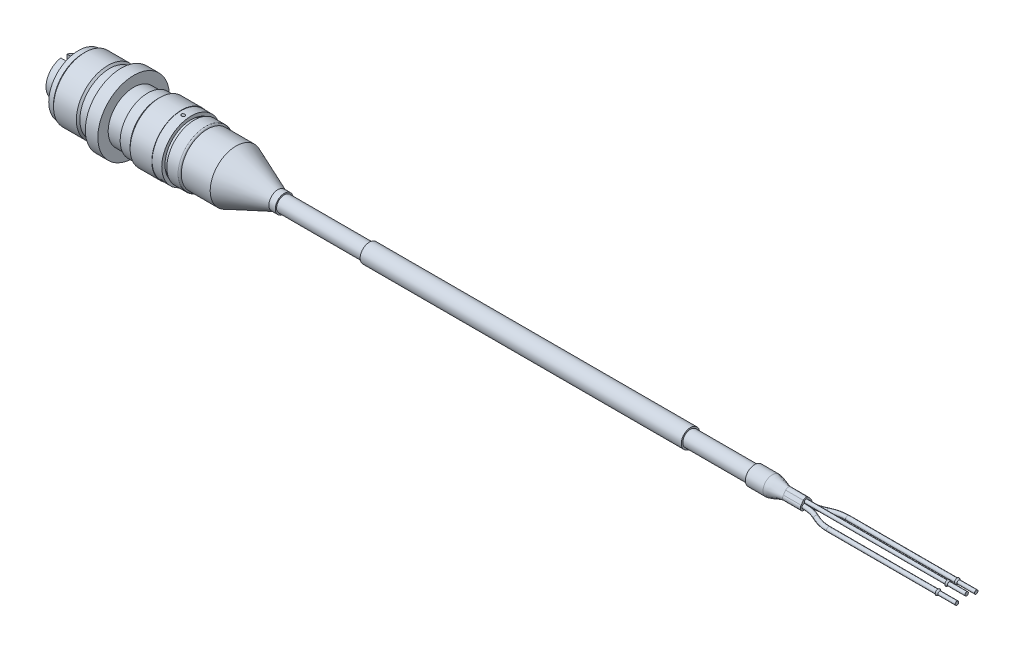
ISO-10303-21;
HEADER;
FILE_DESCRIPTION(('STEP AP214'),'2;1');
FILE_NAME('part.step','',(''),(''),'','','');
FILE_SCHEMA(('AUTOMOTIVE_DESIGN { 1 0 10303 214 1 1 1 1 }'));
ENDSEC;
DATA;
#1=APPLICATION_CONTEXT('core data for automotive mechanical design processes');
#2=APPLICATION_PROTOCOL_DEFINITION('international standard','automotive_design',2000,#1);
#3=PRODUCT_CONTEXT('',#1,'mechanical');
#4=PRODUCT('Part','Part','',(#3));
#5=PRODUCT_RELATED_PRODUCT_CATEGORY('part','',(#4));
#6=PRODUCT_DEFINITION_FORMATION('','',#4);
#7=PRODUCT_DEFINITION_CONTEXT('part definition',#1,'design');
#8=PRODUCT_DEFINITION('design','',#6,#7);
#9=PRODUCT_DEFINITION_SHAPE('','',#8);
#10=(LENGTH_UNIT() NAMED_UNIT(*) SI_UNIT(.MILLI.,.METRE.));
#11=(NAMED_UNIT(*) PLANE_ANGLE_UNIT() SI_UNIT($,.RADIAN.));
#12=(NAMED_UNIT(*) SI_UNIT($,.STERADIAN.) SOLID_ANGLE_UNIT());
#13=UNCERTAINTY_MEASURE_WITH_UNIT(LENGTH_MEASURE(1.E-05),#10,'distance_accuracy_value','');
#14=(GEOMETRIC_REPRESENTATION_CONTEXT(3) GLOBAL_UNCERTAINTY_ASSIGNED_CONTEXT((#13)) GLOBAL_UNIT_ASSIGNED_CONTEXT((#10,
#11,#12)) REPRESENTATION_CONTEXT('',''));
#15=CARTESIAN_POINT('',(0.,0.,0.));
#16=DIRECTION('',(0.,0.,1.));
#17=DIRECTION('',(1.,0.,0.));
#18=AXIS2_PLACEMENT_3D('',#15,#16,#17);
#19=CARTESIAN_POINT('',(-50.62,7.35,0.));
#20=DIRECTION('',(1.,0.,0.));
#21=DIRECTION('',(0.,0.,-1.));
#22=AXIS2_PLACEMENT_3D('',#19,#20,#21);
#23=PLANE('',#22);
#24=CARTESIAN_POINT('',(-50.62,0.,-2.34));
#25=DIRECTION('',(-1.,0.,0.));
#26=DIRECTION('',(0.,0.,1.));
#27=AXIS2_PLACEMENT_3D('',#24,#25,#26);
#28=CIRCLE('',#27,0.9);
#29=CARTESIAN_POINT('',(-50.62,0.,-1.44));
#30=VERTEX_POINT('',#29);
#31=EDGE_CURVE('E24',#30,#30,#28,.T.);
#32=ORIENTED_EDGE('',*,*,#31,.T.);
#33=EDGE_LOOP('',(#32));
#34=FACE_BOUND('',#33,.T.);
#35=ADVANCED_FACE('F17',(#34),#23,.F.);
#36=CARTESIAN_POINT('',(-50.62,7.35,0.));
#37=DIRECTION('',(1.,0.,0.));
#38=DIRECTION('',(0.,0.,-1.));
#39=AXIS2_PLACEMENT_3D('',#36,#37,#38);
#40=PLANE('',#39);
#41=CARTESIAN_POINT('',(-50.62,0.,2.34));
#42=DIRECTION('',(-1.,0.,0.));
#43=DIRECTION('',(0.,0.,1.));
#44=AXIS2_PLACEMENT_3D('',#41,#42,#43);
#45=CIRCLE('',#44,0.9);
#46=CARTESIAN_POINT('',(-50.62,0.,3.24));
#47=VERTEX_POINT('',#46);
#48=EDGE_CURVE('E152',#47,#47,#45,.T.);
#49=ORIENTED_EDGE('',*,*,#48,.T.);
#50=EDGE_LOOP('',(#49));
#51=FACE_BOUND('',#50,.T.);
#52=ADVANCED_FACE('F171',(#51),#40,.F.);
#53=CARTESIAN_POINT('',(-47.9951190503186,0.,-2.34));
#54=DIRECTION('',(-1.,0.,0.));
#55=DIRECTION('',(0.,0.,1.));
#56=AXIS2_PLACEMENT_3D('',#53,#54,#55);
#57=CYLINDRICAL_SURFACE('',#56,0.9);
#58=CARTESIAN_POINT('',(-65.12,0.,-2.34));
#59=DIRECTION('',(-1.,0.,0.));
#60=DIRECTION('',(0.,0.,1.));
#61=AXIS2_PLACEMENT_3D('',#58,#59,#60);
#62=CIRCLE('',#61,0.9);
#63=CARTESIAN_POINT('',(-65.12,0.,-1.44));
#64=VERTEX_POINT('',#63);
#65=EDGE_CURVE('E121',#64,#64,#62,.T.);
#66=ORIENTED_EDGE('',*,*,#65,.T.);
#67=EDGE_LOOP('',(#66));
#68=FACE_BOUND('',#67,.T.);
#69=ORIENTED_EDGE('',*,*,#31,.F.);
#70=EDGE_LOOP('',(#69));
#71=FACE_BOUND('',#70,.T.);
#72=ADVANCED_FACE('F168',(#68,#71),#57,.F.);
#73=CARTESIAN_POINT('',(-47.9951190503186,0.,2.34));
#74=DIRECTION('',(-1.,0.,0.));
#75=DIRECTION('',(0.,0.,1.));
#76=AXIS2_PLACEMENT_3D('',#73,#74,#75);
#77=CYLINDRICAL_SURFACE('',#76,0.9);
#78=CARTESIAN_POINT('',(-65.12,0.,2.34));
#79=DIRECTION('',(-1.,0.,0.));
#80=DIRECTION('',(0.,0.,1.));
#81=AXIS2_PLACEMENT_3D('',#78,#79,#80);
#82=CIRCLE('',#81,0.9);
#83=CARTESIAN_POINT('',(-65.12,0.,3.24));
#84=VERTEX_POINT('',#83);
#85=EDGE_CURVE('E141',#84,#84,#82,.T.);
#86=ORIENTED_EDGE('',*,*,#85,.T.);
#87=EDGE_LOOP('',(#86));
#88=FACE_BOUND('',#87,.T.);
#89=ORIENTED_EDGE('',*,*,#48,.F.);
#90=EDGE_LOOP('',(#89));
#91=FACE_BOUND('',#90,.T.);
#92=ADVANCED_FACE('F170',(#88,#91),#77,.F.);
#93=CARTESIAN_POINT('',(-47.9951190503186,3.9,-1.));
#94=DIRECTION('',(0.,0.,-1.));
#95=DIRECTION('',(0.,1.,0.));
#96=AXIS2_PLACEMENT_3D('',#93,#94,#95);
#97=PLANE('',#96);
#98=DIRECTION('',(1.,0.,0.));
#99=VECTOR('',#98,1.);
#100=CARTESIAN_POINT('',(-47.9951190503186,3.9,-1.));
#101=LINE('',#100,#99);
#102=CARTESIAN_POINT('',(-65.12,3.9,-1.));
#103=VERTEX_POINT('',#102);
#104=CARTESIAN_POINT('',(-50.62,3.9,-1.));
#105=VERTEX_POINT('',#104);
#106=EDGE_CURVE('E131',#103,#105,#101,.T.);
#107=ORIENTED_EDGE('',*,*,#106,.T.);
#108=DIRECTION('',(0.,1.,0.));
#109=VECTOR('',#108,1.);
#110=CARTESIAN_POINT('',(-50.62,3.9,-1.));
#111=LINE('',#110,#109);
#112=CARTESIAN_POINT('',(-50.62,5.50999092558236,-1.));
#113=VERTEX_POINT('',#112);
#114=EDGE_CURVE('E126',#113,#105,#111,.F.);
#115=ORIENTED_EDGE('',*,*,#114,.F.);
#116=DIRECTION('',(-1.,0.,0.));
#117=VECTOR('',#116,1.);
#118=CARTESIAN_POINT('',(-65.12,5.50999092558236,-1.));
#119=LINE('',#118,#117);
#120=CARTESIAN_POINT('',(-65.12,5.50999092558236,-1.));
#121=VERTEX_POINT('',#120);
#122=EDGE_CURVE('E124',#121,#113,#119,.F.);
#123=ORIENTED_EDGE('',*,*,#122,.F.);
#124=DIRECTION('',(0.,1.,0.));
#125=VECTOR('',#124,1.);
#126=CARTESIAN_POINT('',(-65.12,0.,-1.));
#127=LINE('',#126,#125);
#128=EDGE_CURVE('E109',#121,#103,#127,.F.);
#129=ORIENTED_EDGE('',*,*,#128,.T.);
#130=EDGE_LOOP('',(#107,#115,#123,#129));
#131=FACE_BOUND('',#130,.T.);
#132=ADVANCED_FACE('F125',(#131),#97,.F.);
#133=CARTESIAN_POINT('',(-47.9951190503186,5.50999092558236,0.999999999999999));
#134=DIRECTION('',(0.,0.,1.));
#135=DIRECTION('',(0.,-1.,0.));
#136=AXIS2_PLACEMENT_3D('',#133,#134,#135);
#137=PLANE('',#136);
#138=DIRECTION('',(-1.,0.,0.));
#139=VECTOR('',#138,1.);
#140=CARTESIAN_POINT('',(-65.12,5.50999092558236,0.999999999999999));
#141=LINE('',#140,#139);
#142=CARTESIAN_POINT('',(-50.62,5.50999092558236,0.999999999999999));
#143=VERTEX_POINT('',#142);
#144=CARTESIAN_POINT('',(-65.12,5.50999092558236,1.));
#145=VERTEX_POINT('',#144);
#146=EDGE_CURVE('E134',#143,#145,#141,.T.);
#147=ORIENTED_EDGE('',*,*,#146,.F.);
#148=DIRECTION('',(0.,-1.,0.));
#149=VECTOR('',#148,1.);
#150=CARTESIAN_POINT('',(-50.62,5.50999092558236,0.999999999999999));
#151=LINE('',#150,#149);
#152=CARTESIAN_POINT('',(-50.62,3.9,1.));
#153=VERTEX_POINT('',#152);
#154=EDGE_CURVE('E160',#153,#143,#151,.F.);
#155=ORIENTED_EDGE('',*,*,#154,.F.);
#156=DIRECTION('',(1.,0.,0.));
#157=VECTOR('',#156,1.);
#158=CARTESIAN_POINT('',(-47.9951190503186,3.9,0.999999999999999));
#159=LINE('',#158,#157);
#160=CARTESIAN_POINT('',(-65.12,3.9,1.));
#161=VERTEX_POINT('',#160);
#162=EDGE_CURVE('E611',#153,#161,#159,.F.);
#163=ORIENTED_EDGE('',*,*,#162,.T.);
#164=DIRECTION('',(0.,1.,0.));
#165=VECTOR('',#164,1.);
#166=CARTESIAN_POINT('',(-65.12,0.,1.));
#167=LINE('',#166,#165);
#168=EDGE_CURVE('E104',#161,#145,#167,.T.);
#169=ORIENTED_EDGE('',*,*,#168,.T.);
#170=EDGE_LOOP('',(#147,#155,#163,#169));
#171=FACE_BOUND('',#170,.T.);
#172=ADVANCED_FACE('F931',(#171),#137,.F.);
#173=CARTESIAN_POINT('',(-65.12,0.,0.));
#174=DIRECTION('',(1.,0.,0.));
#175=DIRECTION('',(0.,0.,-1.));
#176=AXIS2_PLACEMENT_3D('',#173,#174,#175);
#177=PLANE('',#176);
#178=ORIENTED_EDGE('',*,*,#85,.F.);
#179=EDGE_LOOP('',(#178));
#180=FACE_BOUND('',#179,.T.);
#181=ORIENTED_EDGE('',*,*,#65,.F.);
#182=EDGE_LOOP('',(#181));
#183=FACE_BOUND('',#182,.T.);
#184=CARTESIAN_POINT('',(-65.12,0.,0.));
#185=DIRECTION('',(-1.,0.,0.));
#186=DIRECTION('',(0.,0.,1.));
#187=AXIS2_PLACEMENT_3D('',#184,#185,#186);
#188=CIRCLE('',#187,5.6);
#189=EDGE_CURVE('E113',#145,#121,#188,.F.);
#190=ORIENTED_EDGE('',*,*,#189,.F.);
#191=ORIENTED_EDGE('',*,*,#168,.F.);
#192=DIRECTION('',(0.,0.,-1.));
#193=VECTOR('',#192,1.);
#194=CARTESIAN_POINT('',(-65.12,3.9,1.));
#195=LINE('',#194,#193);
#196=EDGE_CURVE('E116',#161,#103,#195,.T.);
#197=ORIENTED_EDGE('',*,*,#196,.T.);
#198=ORIENTED_EDGE('',*,*,#128,.F.);
#199=EDGE_LOOP('',(#190,#191,#197,#198));
#200=FACE_BOUND('',#199,.T.);
#201=ADVANCED_FACE('F111',(#180,#183,#200),#177,.F.);
#202=CARTESIAN_POINT('',(-65.12,0.,0.));
#203=DIRECTION('',(-1.,0.,0.));
#204=DIRECTION('',(0.,0.,1.));
#205=AXIS2_PLACEMENT_3D('',#202,#203,#204);
#206=CYLINDRICAL_SURFACE('',#205,5.6);
#207=ORIENTED_EDGE('',*,*,#189,.T.);
#208=ORIENTED_EDGE('',*,*,#122,.T.);
#209=CARTESIAN_POINT('',(-50.62,0.,0.));
#210=DIRECTION('',(-1.,0.,0.));
#211=DIRECTION('',(0.,0.,1.));
#212=AXIS2_PLACEMENT_3D('',#209,#210,#211);
#213=CIRCLE('',#212,5.6);
#214=EDGE_CURVE('E145',#113,#143,#213,.T.);
#215=ORIENTED_EDGE('',*,*,#214,.T.);
#216=ORIENTED_EDGE('',*,*,#146,.T.);
#217=EDGE_LOOP('',(#207,#208,#215,#216));
#218=FACE_BOUND('',#217,.T.);
#219=ADVANCED_FACE('F133',(#218),#206,.T.);
#220=CARTESIAN_POINT('',(-47.9951190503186,3.9,1.));
#221=DIRECTION('',(0.,-1.,0.));
#222=DIRECTION('',(0.,0.,-1.));
#223=AXIS2_PLACEMENT_3D('',#220,#221,#222);
#224=PLANE('',#223);
#225=ORIENTED_EDGE('',*,*,#162,.F.);
#226=DIRECTION('',(0.,0.,-1.));
#227=VECTOR('',#226,1.);
#228=CARTESIAN_POINT('',(-50.62,3.9,0.));
#229=LINE('',#228,#227);
#230=EDGE_CURVE('E616',#153,#105,#229,.T.);
#231=ORIENTED_EDGE('',*,*,#230,.T.);
#232=ORIENTED_EDGE('',*,*,#106,.F.);
#233=ORIENTED_EDGE('',*,*,#196,.F.);
#234=EDGE_LOOP('',(#225,#231,#232,#233));
#235=FACE_BOUND('',#234,.T.);
#236=ADVANCED_FACE('F958',(#235),#224,.F.);
#237=CARTESIAN_POINT('',(-50.62,7.35,0.));
#238=DIRECTION('',(1.,0.,0.));
#239=DIRECTION('',(0.,0.,-1.));
#240=AXIS2_PLACEMENT_3D('',#237,#238,#239);
#241=PLANE('',#240);
#242=ORIENTED_EDGE('',*,*,#230,.F.);
#243=ORIENTED_EDGE('',*,*,#154,.T.);
#244=ORIENTED_EDGE('',*,*,#214,.F.);
#245=ORIENTED_EDGE('',*,*,#114,.T.);
#246=EDGE_LOOP('',(#242,#243,#244,#245));
#247=FACE_BOUND('',#246,.T.);
#248=CARTESIAN_POINT('',(-50.62,0.,0.));
#249=DIRECTION('',(-1.,0.,0.));
#250=DIRECTION('',(0.,0.,1.));
#251=AXIS2_PLACEMENT_3D('',#248,#249,#250);
#252=CIRCLE('',#251,7.35);
#253=CARTESIAN_POINT('',(-50.62,0.,7.35));
#254=VERTEX_POINT('',#253);
#255=EDGE_CURVE('E602',#254,#254,#252,.T.);
#256=ORIENTED_EDGE('',*,*,#255,.T.);
#257=EDGE_LOOP('',(#256));
#258=FACE_BOUND('',#257,.T.);
#259=ADVANCED_FACE('F966',(#247,#258),#241,.F.);
#260=CARTESIAN_POINT('',(-65.12,0.,0.));
#261=DIRECTION('',(-1.,0.,0.));
#262=DIRECTION('',(0.,0.,1.));
#263=AXIS2_PLACEMENT_3D('',#260,#261,#262);
#264=CYLINDRICAL_SURFACE('',#263,7.35);
#265=CARTESIAN_POINT('',(-59.92,0.,0.));
#266=DIRECTION('',(-1.,0.,0.));
#267=DIRECTION('',(0.,0.,1.));
#268=AXIS2_PLACEMENT_3D('',#265,#266,#267);
#269=CIRCLE('',#268,7.35);
#270=CARTESIAN_POINT('',(-59.92,0.,7.35));
#271=VERTEX_POINT('',#270);
#272=EDGE_CURVE('E598',#271,#271,#269,.T.);
#273=ORIENTED_EDGE('',*,*,#272,.T.);
#274=EDGE_LOOP('',(#273));
#275=FACE_BOUND('',#274,.T.);
#276=ORIENTED_EDGE('',*,*,#255,.F.);
#277=EDGE_LOOP('',(#276));
#278=FACE_BOUND('',#277,.T.);
#279=ADVANCED_FACE('F975',(#275,#278),#264,.F.);
#280=CARTESIAN_POINT('',(-60.62,0.,0.));
#281=DIRECTION('',(-1.,0.,0.));
#282=DIRECTION('',(0.,-1.,0.));
#283=AXIS2_PLACEMENT_3D('',#280,#281,#282);
#284=CONICAL_SURFACE('',#283,8.05,0.78539816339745);
#285=CARTESIAN_POINT('',(-60.62,0.,0.));
#286=DIRECTION('',(-1.,0.,0.));
#287=DIRECTION('',(0.,-1.,0.));
#288=AXIS2_PLACEMENT_3D('',#285,#286,#287);
#289=CIRCLE('',#288,8.05);
#290=CARTESIAN_POINT('',(-60.62,-8.05,0.));
#291=VERTEX_POINT('',#290);
#292=EDGE_CURVE('E601',#291,#291,#289,.T.);
#293=ORIENTED_EDGE('',*,*,#292,.T.);
#294=EDGE_LOOP('',(#293));
#295=FACE_BOUND('',#294,.T.);
#296=ORIENTED_EDGE('',*,*,#272,.F.);
#297=EDGE_LOOP('',(#296));
#298=FACE_BOUND('',#297,.T.);
#299=ADVANCED_FACE('F984',(#295,#298),#284,.F.);
#300=CARTESIAN_POINT('',(-60.62,9.25,0.));
#301=DIRECTION('',(1.,0.,0.));
#302=DIRECTION('',(0.,0.,-1.));
#303=AXIS2_PLACEMENT_3D('',#300,#301,#302);
#304=PLANE('',#303);
#305=ORIENTED_EDGE('',*,*,#292,.F.);
#306=EDGE_LOOP('',(#305));
#307=FACE_BOUND('',#306,.T.);
#308=CARTESIAN_POINT('',(-60.62,0.,0.));
#309=DIRECTION('',(-1.,0.,0.));
#310=DIRECTION('',(0.,0.,1.));
#311=AXIS2_PLACEMENT_3D('',#308,#309,#310);
#312=CIRCLE('',#311,9.25);
#313=CARTESIAN_POINT('',(-60.62,0.,9.25));
#314=VERTEX_POINT('',#313);
#315=EDGE_CURVE('E595',#314,#314,#312,.F.);
#316=ORIENTED_EDGE('',*,*,#315,.F.);
#317=EDGE_LOOP('',(#316));
#318=FACE_BOUND('',#317,.T.);
#319=ADVANCED_FACE('F993',(#307,#318),#304,.F.);
#320=CARTESIAN_POINT('',(-65.12,0.,0.));
#321=DIRECTION('',(-1.,0.,0.));
#322=DIRECTION('',(0.,0.,1.));
#323=AXIS2_PLACEMENT_3D('',#320,#321,#322);
#324=CYLINDRICAL_SURFACE('',#323,9.25);
#325=CARTESIAN_POINT('',(-59.12,0.,0.));
#326=DIRECTION('',(1.,0.,0.));
#327=DIRECTION('',(0.,1.,0.));
#328=AXIS2_PLACEMENT_3D('',#325,#326,#327);
#329=CIRCLE('',#328,9.25);
#330=CARTESIAN_POINT('',(-59.12,9.25,0.));
#331=VERTEX_POINT('',#330);
#332=EDGE_CURVE('E589',#331,#331,#329,.T.);
#333=ORIENTED_EDGE('',*,*,#332,.F.);
#334=EDGE_LOOP('',(#333));
#335=FACE_BOUND('',#334,.T.);
#336=ORIENTED_EDGE('',*,*,#315,.T.);
#337=EDGE_LOOP('',(#336));
#338=FACE_BOUND('',#337,.T.);
#339=ADVANCED_FACE('F1002',(#335,#338),#324,.T.);
#340=CARTESIAN_POINT('',(-58.57,0.,0.));
#341=DIRECTION('',(1.,0.,0.));
#342=DIRECTION('',(0.,0.,-1.));
#343=AXIS2_PLACEMENT_3D('',#340,#341,#342);
#344=CONICAL_SURFACE('',#343,9.8,0.78539816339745);
#345=ORIENTED_EDGE('',*,*,#332,.T.);
#346=EDGE_LOOP('',(#345));
#347=FACE_BOUND('',#346,.T.);
#348=CARTESIAN_POINT('',(-58.57,0.,0.));
#349=DIRECTION('',(-1.,0.,0.));
#350=DIRECTION('',(0.,0.,1.));
#351=AXIS2_PLACEMENT_3D('',#348,#349,#350);
#352=CIRCLE('',#351,9.8);
#353=CARTESIAN_POINT('',(-58.57,0.,9.8));
#354=VERTEX_POINT('',#353);
#355=EDGE_CURVE('E583',#354,#354,#352,.F.);
#356=ORIENTED_EDGE('',*,*,#355,.F.);
#357=EDGE_LOOP('',(#356));
#358=FACE_BOUND('',#357,.T.);
#359=ADVANCED_FACE('F1011',(#347,#358),#344,.T.);
#360=CARTESIAN_POINT('',(-65.12,0.,0.));
#361=DIRECTION('',(-1.,0.,0.));
#362=DIRECTION('',(0.,0.,1.));
#363=AXIS2_PLACEMENT_3D('',#360,#361,#362);
#364=CYLINDRICAL_SURFACE('',#363,9.8);
#365=CARTESIAN_POINT('',(-51.47,0.,0.));
#366=DIRECTION('',(-1.,0.,0.));
#367=DIRECTION('',(0.,0.,1.));
#368=AXIS2_PLACEMENT_3D('',#365,#366,#367);
#369=CIRCLE('',#368,9.8);
#370=CARTESIAN_POINT('',(-51.47,0.,9.8));
#371=VERTEX_POINT('',#370);
#372=EDGE_CURVE('E577',#371,#371,#369,.F.);
#373=ORIENTED_EDGE('',*,*,#372,.F.);
#374=EDGE_LOOP('',(#373));
#375=FACE_BOUND('',#374,.T.);
#376=ORIENTED_EDGE('',*,*,#355,.T.);
#377=EDGE_LOOP('',(#376));
#378=FACE_BOUND('',#377,.T.);
#379=ADVANCED_FACE('F1020',(#375,#378),#364,.T.);
#380=CARTESIAN_POINT('',(-51.47,0.,0.));
#381=DIRECTION('',(-1.,0.,0.));
#382=DIRECTION('',(0.,-1.,0.));
#383=AXIS2_PLACEMENT_3D('',#380,#381,#382);
#384=CONICAL_SURFACE('',#383,9.8,0.78539816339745);
#385=CARTESIAN_POINT('',(-50.92,0.,0.));
#386=DIRECTION('',(-1.,0.,0.));
#387=DIRECTION('',(0.,0.,1.));
#388=AXIS2_PLACEMENT_3D('',#385,#386,#387);
#389=CIRCLE('',#388,9.25);
#390=CARTESIAN_POINT('',(-50.92,0.,9.25));
#391=VERTEX_POINT('',#390);
#392=EDGE_CURVE('E571',#391,#391,#389,.F.);
#393=ORIENTED_EDGE('',*,*,#392,.F.);
#394=EDGE_LOOP('',(#393));
#395=FACE_BOUND('',#394,.T.);
#396=ORIENTED_EDGE('',*,*,#372,.T.);
#397=EDGE_LOOP('',(#396));
#398=FACE_BOUND('',#397,.T.);
#399=ADVANCED_FACE('F1030',(#395,#398),#384,.T.);
#400=CARTESIAN_POINT('',(-65.12,0.,0.));
#401=DIRECTION('',(-1.,0.,0.));
#402=DIRECTION('',(0.,0.,1.));
#403=AXIS2_PLACEMENT_3D('',#400,#401,#402);
#404=CYLINDRICAL_SURFACE('',#403,9.25);
#405=CARTESIAN_POINT('',(-48.42,0.,0.));
#406=DIRECTION('',(1.,0.,0.));
#407=DIRECTION('',(0.,0.,-1.));
#408=AXIS2_PLACEMENT_3D('',#405,#406,#407);
#409=CIRCLE('',#408,9.25);
#410=CARTESIAN_POINT('',(-48.42,0.,-9.25));
#411=VERTEX_POINT('',#410);
#412=EDGE_CURVE('E565',#411,#411,#409,.T.);
#413=ORIENTED_EDGE('',*,*,#412,.F.);
#414=EDGE_LOOP('',(#413));
#415=FACE_BOUND('',#414,.T.);
#416=ORIENTED_EDGE('',*,*,#392,.T.);
#417=EDGE_LOOP('',(#416));
#418=FACE_BOUND('',#417,.T.);
#419=ADVANCED_FACE('F1041',(#415,#418),#404,.T.);
#420=CARTESIAN_POINT('',(-47.3230344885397,0.,0.));
#421=DIRECTION('',(1.,0.,0.));
#422=DIRECTION('',(0.,0.,-1.));
#423=AXIS2_PLACEMENT_3D('',#420,#421,#422);
#424=CONICAL_SURFACE('',#423,11.15,1.0471975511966);
#425=ORIENTED_EDGE('',*,*,#412,.T.);
#426=EDGE_LOOP('',(#425));
#427=FACE_BOUND('',#426,.T.);
#428=CARTESIAN_POINT('',(-47.3230344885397,0.,0.));
#429=DIRECTION('',(-1.,0.,0.));
#430=DIRECTION('',(0.,0.,1.));
#431=AXIS2_PLACEMENT_3D('',#428,#429,#430);
#432=CIRCLE('',#431,11.15);
#433=CARTESIAN_POINT('',(-47.3230344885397,0.,11.15));
#434=VERTEX_POINT('',#433);
#435=EDGE_CURVE('E560',#434,#434,#432,.F.);
#436=ORIENTED_EDGE('',*,*,#435,.F.);
#437=EDGE_LOOP('',(#436));
#438=FACE_BOUND('',#437,.T.);
#439=ADVANCED_FACE('F1050',(#427,#438),#424,.T.);
#440=CARTESIAN_POINT('',(-65.12,0.,0.));
#441=DIRECTION('',(-1.,0.,0.));
#442=DIRECTION('',(0.,0.,1.));
#443=AXIS2_PLACEMENT_3D('',#440,#441,#442);
#444=CYLINDRICAL_SURFACE('',#443,11.15);
#445=CARTESIAN_POINT('',(-43.42,0.,0.));
#446=DIRECTION('',(-1.,0.,0.));
#447=DIRECTION('',(0.,0.,1.));
#448=AXIS2_PLACEMENT_3D('',#445,#446,#447);
#449=CIRCLE('',#448,11.15);
#450=CARTESIAN_POINT('',(-43.42,0.,11.15));
#451=VERTEX_POINT('',#450);
#452=EDGE_CURVE('E564',#451,#451,#449,.T.);
#453=ORIENTED_EDGE('',*,*,#452,.T.);
#454=EDGE_LOOP('',(#453));
#455=FACE_BOUND('',#454,.T.);
#456=ORIENTED_EDGE('',*,*,#435,.T.);
#457=EDGE_LOOP('',(#456));
#458=FACE_BOUND('',#457,.T.);
#459=ADVANCED_FACE('F1059',(#455,#458),#444,.T.);
#460=CARTESIAN_POINT('',(-43.42,11.15,0.));
#461=DIRECTION('',(-1.,0.,0.));
#462=DIRECTION('',(0.,0.,1.));
#463=AXIS2_PLACEMENT_3D('',#460,#461,#462);
#464=PLANE('',#463);
#465=ORIENTED_EDGE('',*,*,#452,.F.);
#466=EDGE_LOOP('',(#465));
#467=FACE_BOUND('',#466,.T.);
#468=CARTESIAN_POINT('',(-43.42,0.,0.));
#469=DIRECTION('',(-1.,0.,0.));
#470=DIRECTION('',(0.,0.,1.));
#471=AXIS2_PLACEMENT_3D('',#468,#469,#470);
#472=CIRCLE('',#471,7.9375);
#473=CARTESIAN_POINT('',(-43.42,0.,7.9375));
#474=VERTEX_POINT('',#473);
#475=EDGE_CURVE('E831',#474,#474,#472,.F.);
#476=ORIENTED_EDGE('',*,*,#475,.F.);
#477=EDGE_LOOP('',(#476));
#478=FACE_BOUND('',#477,.T.);
#479=ADVANCED_FACE('F1068',(#467,#478),#464,.F.);
#480=CARTESIAN_POINT('',(-65.12,0.,0.));
#481=DIRECTION('',(-1.,0.,0.));
#482=DIRECTION('',(0.,0.,1.));
#483=AXIS2_PLACEMENT_3D('',#480,#481,#482);
#484=CYLINDRICAL_SURFACE('',#483,7.9375);
#485=CARTESIAN_POINT('',(-39.02,0.,0.));
#486=DIRECTION('',(-1.,0.,0.));
#487=DIRECTION('',(0.,0.,1.));
#488=AXIS2_PLACEMENT_3D('',#485,#486,#487);
#489=CIRCLE('',#488,7.9375);
#490=CARTESIAN_POINT('',(-39.02,0.,7.9375));
#491=VERTEX_POINT('',#490);
#492=EDGE_CURVE('E833',#491,#491,#489,.T.);
#493=ORIENTED_EDGE('',*,*,#492,.T.);
#494=EDGE_LOOP('',(#493));
#495=FACE_BOUND('',#494,.T.);
#496=ORIENTED_EDGE('',*,*,#475,.T.);
#497=EDGE_LOOP('',(#496));
#498=FACE_BOUND('',#497,.T.);
#499=ADVANCED_FACE('F1077',(#495,#498),#484,.T.);
#500=CARTESIAN_POINT('',(216.,0.,-2.99999999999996));
#501=DIRECTION('',(1.,0.,0.));
#502=DIRECTION('',(0.,0.,-1.));
#503=AXIS2_PLACEMENT_3D('',#500,#501,#502);
#504=PLANE('',#503);
#505=CARTESIAN_POINT('',(216.,0.,-2.99999999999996));
#506=DIRECTION('',(-1.,0.,0.));
#507=DIRECTION('',(0.,0.,1.));
#508=AXIS2_PLACEMENT_3D('',#505,#506,#507);
#509=CIRCLE('',#508,0.549999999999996);
#510=CARTESIAN_POINT('',(216.,0.,-2.44999999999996));
#511=VERTEX_POINT('',#510);
#512=EDGE_CURVE('E1881',#511,#511,#509,.T.);
#513=ORIENTED_EDGE('',*,*,#512,.F.);
#514=EDGE_LOOP('',(#513));
#515=FACE_BOUND('',#514,.T.);
#516=ADVANCED_FACE('F1086',(#515),#504,.T.);
#517=CARTESIAN_POINT('',(216.,0.,3.00000000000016));
#518=DIRECTION('',(1.,0.,0.));
#519=DIRECTION('',(0.,0.,-1.));
#520=AXIS2_PLACEMENT_3D('',#517,#518,#519);
#521=PLANE('',#520);
#522=CARTESIAN_POINT('',(216.,0.,3.00000000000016));
#523=DIRECTION('',(-1.,0.,0.));
#524=DIRECTION('',(0.,0.,1.));
#525=AXIS2_PLACEMENT_3D('',#522,#523,#524);
#526=CIRCLE('',#525,0.549999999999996);
#527=CARTESIAN_POINT('',(216.,0.,3.55000000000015));
#528=VERTEX_POINT('',#527);
#529=EDGE_CURVE('E1839',#528,#528,#526,.T.);
#530=ORIENTED_EDGE('',*,*,#529,.F.);
#531=EDGE_LOOP('',(#530));
#532=FACE_BOUND('',#531,.T.);
#533=ADVANCED_FACE('F1096',(#532),#521,.T.);
#534=CARTESIAN_POINT('',(-39.02,0.,0.));
#535=DIRECTION('',(1.,0.,0.));
#536=DIRECTION('',(0.,0.,-1.));
#537=AXIS2_PLACEMENT_3D('',#534,#535,#536);
#538=PLANE('',#537);
#539=CARTESIAN_POINT('',(-39.02,0.,0.));
#540=DIRECTION('',(-1.,0.,0.));
#541=DIRECTION('',(0.,0.,1.));
#542=AXIS2_PLACEMENT_3D('',#539,#540,#541);
#543=CIRCLE('',#542,8.6);
#544=CARTESIAN_POINT('',(-39.02,0.,8.6));
#545=VERTEX_POINT('',#544);
#546=EDGE_CURVE('E557',#545,#545,#543,.F.);
#547=ORIENTED_EDGE('',*,*,#546,.F.);
#548=EDGE_LOOP('',(#547));
#549=FACE_BOUND('',#548,.T.);
#550=ORIENTED_EDGE('',*,*,#492,.F.);
#551=EDGE_LOOP('',(#550));
#552=FACE_BOUND('',#551,.T.);
#553=ADVANCED_FACE('F1108',(#549,#552),#538,.F.);
#554=CARTESIAN_POINT('',(210.,0.,-2.99999999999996));
#555=DIRECTION('',(-1.,0.,0.));
#556=DIRECTION('',(0.,0.,1.));
#557=AXIS2_PLACEMENT_3D('',#554,#555,#556);
#558=CYLINDRICAL_SURFACE('',#557,0.549999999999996);
#559=ORIENTED_EDGE('',*,*,#512,.T.);
#560=EDGE_LOOP('',(#559));
#561=FACE_BOUND('',#560,.T.);
#562=CARTESIAN_POINT('',(210.608012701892,0.,-2.99999999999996));
#563=DIRECTION('',(1.,0.,0.));
#564=DIRECTION('',(0.,0.,-1.));
#565=AXIS2_PLACEMENT_3D('',#562,#563,#564);
#566=CIRCLE('',#565,0.550000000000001);
#567=CARTESIAN_POINT('',(210.608012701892,0.,-3.54999999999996));
#568=VERTEX_POINT('',#567);
#569=EDGE_CURVE('E551',#568,#568,#566,.T.);
#570=ORIENTED_EDGE('',*,*,#569,.T.);
#571=EDGE_LOOP('',(#570));
#572=FACE_BOUND('',#571,.T.);
#573=ADVANCED_FACE('F1118',(#561,#572),#558,.T.);
#574=CARTESIAN_POINT('',(210.,0.,3.00000000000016));
#575=DIRECTION('',(-1.,0.,0.));
#576=DIRECTION('',(0.,0.,1.));
#577=AXIS2_PLACEMENT_3D('',#574,#575,#576);
#578=CYLINDRICAL_SURFACE('',#577,0.549999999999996);
#579=ORIENTED_EDGE('',*,*,#529,.T.);
#580=EDGE_LOOP('',(#579));
#581=FACE_BOUND('',#580,.T.);
#582=CARTESIAN_POINT('',(210.608012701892,0.,3.00000000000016));
#583=DIRECTION('',(1.,0.,0.));
#584=DIRECTION('',(0.,0.,-1.));
#585=AXIS2_PLACEMENT_3D('',#582,#583,#584);
#586=CIRCLE('',#585,0.550000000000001);
#587=CARTESIAN_POINT('',(210.608012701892,0.,2.45000000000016));
#588=VERTEX_POINT('',#587);
#589=EDGE_CURVE('E545',#588,#588,#586,.T.);
#590=ORIENTED_EDGE('',*,*,#589,.T.);
#591=EDGE_LOOP('',(#590));
#592=FACE_BOUND('',#591,.T.);
#593=ADVANCED_FACE('F1127',(#581,#592),#578,.T.);
#594=CARTESIAN_POINT('',(-39.02,0.,0.));
#595=DIRECTION('',(-1.,0.,0.));
#596=DIRECTION('',(0.,0.,1.));
#597=AXIS2_PLACEMENT_3D('',#594,#595,#596);
#598=CYLINDRICAL_SURFACE('',#597,8.6);
#599=CARTESIAN_POINT('',(-35.92,0.,0.));
#600=DIRECTION('',(1.,0.,0.));
#601=DIRECTION('',(0.,0.809016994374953,0.587785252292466));
#602=AXIS2_PLACEMENT_3D('',#599,#600,#601);
#603=CIRCLE('',#602,8.6);
#604=CARTESIAN_POINT('',(-35.92,6.9575461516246,5.05495316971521));
#605=VERTEX_POINT('',#604);
#606=EDGE_CURVE('E539',#605,#605,#603,.T.);
#607=ORIENTED_EDGE('',*,*,#606,.F.);
#608=EDGE_LOOP('',(#607));
#609=FACE_BOUND('',#608,.T.);
#610=ORIENTED_EDGE('',*,*,#546,.T.);
#611=EDGE_LOOP('',(#610));
#612=FACE_BOUND('',#611,.T.);
#613=ADVANCED_FACE('F902',(#609,#612),#598,.T.);
#614=CARTESIAN_POINT('',(210.608012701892,0.,-2.99999999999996));
#615=DIRECTION('',(-1.,0.,0.));
#616=DIRECTION('',(0.,0.,1.));
#617=AXIS2_PLACEMENT_3D('',#614,#615,#616);
#618=TOROIDAL_SURFACE('',#617,0.599999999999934,0.0499999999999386);
#619=ORIENTED_EDGE('',*,*,#569,.F.);
#620=EDGE_LOOP('',(#619));
#621=FACE_BOUND('',#620,.T.);
#622=CARTESIAN_POINT('',(210.583012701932,0.,-2.99999999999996));
#623=DIRECTION('',(-1.,0.,0.));
#624=DIRECTION('',(0.,-0.90109680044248,-0.433617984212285));
#625=AXIS2_PLACEMENT_3D('',#622,#623,#624);
#626=CIRCLE('',#625,0.556698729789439);
#627=CARTESIAN_POINT('',(210.583012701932,-0.501639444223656,-3.24139458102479));
#628=VERTEX_POINT('',#627);
#629=EDGE_CURVE('E533',#628,#628,#626,.T.);
#630=ORIENTED_EDGE('',*,*,#629,.F.);
#631=EDGE_LOOP('',(#630));
#632=FACE_BOUND('',#631,.T.);
#633=ADVANCED_FACE('F898',(#621,#632),#618,.F.);
#634=CARTESIAN_POINT('',(210.608012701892,0.,3.00000000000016));
#635=DIRECTION('',(-1.,0.,0.));
#636=DIRECTION('',(0.,0.,1.));
#637=AXIS2_PLACEMENT_3D('',#634,#635,#636);
#638=TOROIDAL_SURFACE('',#637,0.600000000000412,0.0500000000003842);
#639=ORIENTED_EDGE('',*,*,#589,.F.);
#640=EDGE_LOOP('',(#639));
#641=FACE_BOUND('',#640,.T.);
#642=CARTESIAN_POINT('',(210.583012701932,0.,3.00000000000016));
#643=DIRECTION('',(-1.,0.,0.));
#644=DIRECTION('',(0.,-1.,0.));
#645=AXIS2_PLACEMENT_3D('',#642,#643,#644);
#646=CIRCLE('',#645,0.55669872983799);
#647=CARTESIAN_POINT('',(210.583012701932,-0.55669872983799,3.00000000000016));
#648=VERTEX_POINT('',#647);
#649=EDGE_CURVE('E529',#648,#648,#646,.T.);
#650=ORIENTED_EDGE('',*,*,#649,.F.);
#651=EDGE_LOOP('',(#650));
#652=FACE_BOUND('',#651,.T.);
#653=ADVANCED_FACE('F894',(#641,#652),#638,.F.);
#654=CARTESIAN_POINT('',(216.,1.0087120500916,0.));
#655=DIRECTION('',(1.,0.,0.));
#656=DIRECTION('',(0.,0.,-1.));
#657=AXIS2_PLACEMENT_3D('',#654,#655,#656);
#658=PLANE('',#657);
#659=CARTESIAN_POINT('',(216.,1.0087120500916,0.));
#660=DIRECTION('',(-1.,0.,0.));
#661=DIRECTION('',(0.,0.,1.));
#662=AXIS2_PLACEMENT_3D('',#659,#660,#661);
#663=CIRCLE('',#662,0.549999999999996);
#664=CARTESIAN_POINT('',(216.,1.0087120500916,0.549999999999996));
#665=VERTEX_POINT('',#664);
#666=EDGE_CURVE('E526',#665,#665,#663,.T.);
#667=ORIENTED_EDGE('',*,*,#666,.F.);
#668=EDGE_LOOP('',(#667));
#669=FACE_BOUND('',#668,.T.);
#670=ADVANCED_FACE('F897',(#669),#658,.T.);
#671=CARTESIAN_POINT('',(-35.27,0.,0.));
#672=DIRECTION('',(1.,0.,0.));
#673=DIRECTION('',(0.,0.,-1.));
#674=AXIS2_PLACEMENT_3D('',#671,#672,#673);
#675=CONICAL_SURFACE('',#674,9.25,0.785398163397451);
#676=CARTESIAN_POINT('',(-35.27,0.,0.));
#677=DIRECTION('',(-1.,0.,0.));
#678=DIRECTION('',(0.,0.,1.));
#679=AXIS2_PLACEMENT_3D('',#676,#677,#678);
#680=CIRCLE('',#679,9.25);
#681=CARTESIAN_POINT('',(-35.27,0.,9.25));
#682=VERTEX_POINT('',#681);
#683=EDGE_CURVE('E520',#682,#682,#680,.F.);
#684=ORIENTED_EDGE('',*,*,#683,.F.);
#685=EDGE_LOOP('',(#684));
#686=FACE_BOUND('',#685,.T.);
#687=ORIENTED_EDGE('',*,*,#606,.T.);
#688=EDGE_LOOP('',(#687));
#689=FACE_BOUND('',#688,.T.);
#690=ADVANCED_FACE('F1168',(#686,#689),#675,.T.);
#691=CARTESIAN_POINT('',(210.075000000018,0.,-2.99999999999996));
#692=DIRECTION('',(-1.,0.,0.));
#693=DIRECTION('',(0.,0.,1.));
#694=AXIS2_PLACEMENT_3D('',#691,#692,#693);
#695=CONICAL_SURFACE('',#694,0.849999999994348,0.523598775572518);
#696=ORIENTED_EDGE('',*,*,#629,.T.);
#697=EDGE_LOOP('',(#696));
#698=FACE_BOUND('',#697,.T.);
#699=CARTESIAN_POINT('',(210.074999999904,0.,-2.99999999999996));
#700=DIRECTION('',(1.,0.,0.));
#701=DIRECTION('',(0.,0.901096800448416,0.43361798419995));
#702=AXIS2_PLACEMENT_3D('',#699,#700,#701);
#703=CIRCLE('',#702,0.850000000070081);
#704=CARTESIAN_POINT('',(210.074999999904,0.765932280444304,-2.63142471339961));
#705=VERTEX_POINT('',#704);
#706=EDGE_CURVE('E514',#705,#705,#703,.F.);
#707=ORIENTED_EDGE('',*,*,#706,.F.);
#708=EDGE_LOOP('',(#707));
#709=FACE_BOUND('',#708,.T.);
#710=ADVANCED_FACE('F1177',(#698,#709),#695,.T.);
#711=CARTESIAN_POINT('',(210.075000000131,0.,3.00000000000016));
#712=DIRECTION('',(-1.,0.,0.));
#713=DIRECTION('',(0.,0.,1.));
#714=AXIS2_PLACEMENT_3D('',#711,#712,#713);
#715=CONICAL_SURFACE('',#714,0.849999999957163,0.52359877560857);
#716=ORIENTED_EDGE('',*,*,#649,.T.);
#717=EDGE_LOOP('',(#716));
#718=FACE_BOUND('',#717,.T.);
#719=CARTESIAN_POINT('',(210.074999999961,0.,3.00000000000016));
#720=DIRECTION('',(1.,0.,0.));
#721=DIRECTION('',(0.,1.,0.));
#722=AXIS2_PLACEMENT_3D('',#719,#720,#721);
#723=CIRCLE('',#722,0.85000000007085);
#724=CARTESIAN_POINT('',(210.074999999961,0.85000000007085,3.00000000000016));
#725=VERTEX_POINT('',#724);
#726=EDGE_CURVE('E508',#725,#725,#723,.F.);
#727=ORIENTED_EDGE('',*,*,#726,.F.);
#728=EDGE_LOOP('',(#727));
#729=FACE_BOUND('',#728,.T.);
#730=ADVANCED_FACE('F1186',(#718,#729),#715,.T.);
#731=CARTESIAN_POINT('',(210.,1.0087120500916,0.));
#732=DIRECTION('',(-1.,0.,0.));
#733=DIRECTION('',(0.,0.,1.));
#734=AXIS2_PLACEMENT_3D('',#731,#732,#733);
#735=CYLINDRICAL_SURFACE('',#734,0.549999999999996);
#736=ORIENTED_EDGE('',*,*,#666,.T.);
#737=EDGE_LOOP('',(#736));
#738=FACE_BOUND('',#737,.T.);
#739=CARTESIAN_POINT('',(210.608012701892,1.0087120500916,0.));
#740=DIRECTION('',(1.,0.,0.));
#741=DIRECTION('',(0.,0.,-1.));
#742=AXIS2_PLACEMENT_3D('',#739,#740,#741);
#743=CIRCLE('',#742,0.550000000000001);
#744=CARTESIAN_POINT('',(210.608012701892,1.0087120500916,-0.550000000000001));
#745=VERTEX_POINT('',#744);
#746=EDGE_CURVE('E504',#745,#745,#743,.T.);
#747=ORIENTED_EDGE('',*,*,#746,.T.);
#748=EDGE_LOOP('',(#747));
#749=FACE_BOUND('',#748,.T.);
#750=ADVANCED_FACE('F1196',(#738,#749),#735,.T.);
#751=CARTESIAN_POINT('',(-39.02,0.,0.));
#752=DIRECTION('',(-1.,0.,0.));
#753=DIRECTION('',(0.,0.,1.));
#754=AXIS2_PLACEMENT_3D('',#751,#752,#753);
#755=CYLINDRICAL_SURFACE('',#754,9.25);
#756=CARTESIAN_POINT('',(-28.52,0.,0.));
#757=DIRECTION('',(-1.,0.,0.));
#758=DIRECTION('',(0.,0.,1.));
#759=AXIS2_PLACEMENT_3D('',#756,#757,#758);
#760=CIRCLE('',#759,9.25);
#761=CARTESIAN_POINT('',(-28.52,0.,9.25));
#762=VERTEX_POINT('',#761);
#763=EDGE_CURVE('E501',#762,#762,#760,.T.);
#764=ORIENTED_EDGE('',*,*,#763,.T.);
#765=EDGE_LOOP('',(#764));
#766=FACE_BOUND('',#765,.T.);
#767=ORIENTED_EDGE('',*,*,#683,.T.);
#768=EDGE_LOOP('',(#767));
#769=FACE_BOUND('',#768,.T.);
#770=ADVANCED_FACE('F1205',(#766,#769),#755,.T.);
#771=CARTESIAN_POINT('',(210.074999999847,0.,-2.99999999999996));
#772=DIRECTION('',(1.,0.,0.));
#773=DIRECTION('',(0.,0.,-1.));
#774=AXIS2_PLACEMENT_3D('',#771,#772,#773);
#775=CONICAL_SURFACE('',#774,0.84999999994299,1.04719755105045);
#776=ORIENTED_EDGE('',*,*,#706,.T.);
#777=EDGE_LOOP('',(#776));
#778=FACE_BOUND('',#777,.T.);
#779=CARTESIAN_POINT('',(209.99999999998,0.,-2.99999999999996));
#780=DIRECTION('',(-1.,0.,0.));
#781=DIRECTION('',(0.,-0.901096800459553,-0.433617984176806));
#782=AXIS2_PLACEMENT_3D('',#779,#780,#781);
#783=CIRCLE('',#782,0.720096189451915);
#784=CARTESIAN_POINT('',(209.99999999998,-0.648876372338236,-3.3122466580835));
#785=VERTEX_POINT('',#784);
#786=EDGE_CURVE('E495',#785,#785,#783,.F.);
#787=ORIENTED_EDGE('',*,*,#786,.T.);
#788=EDGE_LOOP('',(#787));
#789=FACE_BOUND('',#788,.T.);
#790=ADVANCED_FACE('F1214',(#778,#789),#775,.T.);
#791=CARTESIAN_POINT('',(210.075000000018,0.,3.00000000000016));
#792=DIRECTION('',(1.,0.,0.));
#793=DIRECTION('',(0.,0.,-1.));
#794=AXIS2_PLACEMENT_3D('',#791,#792,#793);
#795=CONICAL_SURFACE('',#794,0.850000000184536,1.04719755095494);
#796=ORIENTED_EDGE('',*,*,#726,.T.);
#797=EDGE_LOOP('',(#796));
#798=FACE_BOUND('',#797,.T.);
#799=CARTESIAN_POINT('',(209.99999999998,0.,3.00000000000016));
#800=DIRECTION('',(-1.,0.,0.));
#801=DIRECTION('',(0.,-1.,0.));
#802=AXIS2_PLACEMENT_3D('',#799,#800,#801);
#803=CIRCLE('',#802,0.720096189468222);
#804=CARTESIAN_POINT('',(209.99999999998,-0.720096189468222,3.00000000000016));
#805=VERTEX_POINT('',#804);
#806=EDGE_CURVE('E489',#805,#805,#803,.F.);
#807=ORIENTED_EDGE('',*,*,#806,.T.);
#808=EDGE_LOOP('',(#807));
#809=FACE_BOUND('',#808,.T.);
#810=ADVANCED_FACE('F892',(#798,#809),#795,.T.);
#811=CARTESIAN_POINT('',(210.608012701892,1.0087120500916,0.));
#812=DIRECTION('',(-1.,0.,0.));
#813=DIRECTION('',(0.,0.,1.));
#814=AXIS2_PLACEMENT_3D('',#811,#812,#813);
#815=TOROIDAL_SURFACE('',#814,0.600000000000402,0.0500000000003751);
#816=ORIENTED_EDGE('',*,*,#746,.F.);
#817=EDGE_LOOP('',(#816));
#818=FACE_BOUND('',#817,.T.);
#819=CARTESIAN_POINT('',(210.583012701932,1.0087120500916,0.));
#820=DIRECTION('',(-1.,0.,0.));
#821=DIRECTION('',(0.,-0.927954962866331,0.372692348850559));
#822=AXIS2_PLACEMENT_3D('',#819,#820,#821);
#823=CIRCLE('',#822,0.556698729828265);
#824=CARTESIAN_POINT('',(210.583012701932,0.49212070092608,0.207477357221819));
#825=VERTEX_POINT('',#824);
#826=EDGE_CURVE('E486',#825,#825,#823,.T.);
#827=ORIENTED_EDGE('',*,*,#826,.F.);
#828=EDGE_LOOP('',(#827));
#829=FACE_BOUND('',#828,.T.);
#830=ADVANCED_FACE('F888',(#818,#829),#815,.F.);
#831=CARTESIAN_POINT('',(-28.52,-5.43701358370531,7.48340719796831));
#832=DIRECTION('',(-1.,0.,0.));
#833=DIRECTION('',(0.,0.,1.));
#834=AXIS2_PLACEMENT_3D('',#831,#832,#833);
#835=PLANE('',#834);
#836=CARTESIAN_POINT('',(-28.52,0.,0.));
#837=DIRECTION('',(-1.,0.,0.));
#838=DIRECTION('',(0.,0.,1.));
#839=AXIS2_PLACEMENT_3D('',#836,#837,#838);
#840=CIRCLE('',#839,9.15);
#841=CARTESIAN_POINT('',(-28.52,0.,9.15));
#842=VERTEX_POINT('',#841);
#843=EDGE_CURVE('E483',#842,#842,#840,.F.);
#844=ORIENTED_EDGE('',*,*,#843,.F.);
#845=EDGE_LOOP('',(#844));
#846=FACE_BOUND('',#845,.T.);
#847=ORIENTED_EDGE('',*,*,#763,.F.);
#848=EDGE_LOOP('',(#847));
#849=FACE_BOUND('',#848,.T.);
#850=ADVANCED_FACE('F891',(#846,#849),#835,.F.);
#851=CARTESIAN_POINT('',(210.000000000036,0.,-2.99999999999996));
#852=DIRECTION('',(-1.,0.,0.));
#853=DIRECTION('',(0.,0.,1.));
#854=AXIS2_PLACEMENT_3D('',#851,#852,#853);
#855=CONICAL_SURFACE('',#854,0.720096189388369,0.523598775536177);
#856=ORIENTED_EDGE('',*,*,#786,.F.);
#857=EDGE_LOOP('',(#856));
#858=FACE_BOUND('',#857,.T.);
#859=CARTESIAN_POINT('',(210.542820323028,0.,-2.99999999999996));
#860=DIRECTION('',(-1.,0.,0.));
#861=DIRECTION('',(0.,0.,1.));
#862=AXIS2_PLACEMENT_3D('',#859,#860,#861);
#863=CIRCLE('',#862,0.406698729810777);
#864=CARTESIAN_POINT('',(210.542820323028,0.,-2.59330127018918));
#865=VERTEX_POINT('',#864);
#866=EDGE_CURVE('E477',#865,#865,#863,.T.);
#867=ORIENTED_EDGE('',*,*,#866,.F.);
#868=EDGE_LOOP('',(#867));
#869=FACE_BOUND('',#868,.T.);
#870=ADVANCED_FACE('F1248',(#858,#869),#855,.F.);
#871=CARTESIAN_POINT('',(210.000000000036,0.,3.00000000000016));
#872=DIRECTION('',(-1.,0.,0.));
#873=DIRECTION('',(0.,0.,1.));
#874=AXIS2_PLACEMENT_3D('',#871,#872,#873);
#875=CONICAL_SURFACE('',#874,0.720096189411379,0.523598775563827);
#876=ORIENTED_EDGE('',*,*,#806,.F.);
#877=EDGE_LOOP('',(#876));
#878=FACE_BOUND('',#877,.T.);
#879=CARTESIAN_POINT('',(210.542820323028,0.,3.00000000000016));
#880=DIRECTION('',(-1.,0.,0.));
#881=DIRECTION('',(0.,0.,1.));
#882=AXIS2_PLACEMENT_3D('',#879,#880,#881);
#883=CIRCLE('',#882,0.406698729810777);
#884=CARTESIAN_POINT('',(210.542820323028,0.,3.40669872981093));
#885=VERTEX_POINT('',#884);
#886=EDGE_CURVE('E471',#885,#885,#883,.T.);
#887=ORIENTED_EDGE('',*,*,#886,.F.);
#888=EDGE_LOOP('',(#887));
#889=FACE_BOUND('',#888,.T.);
#890=ADVANCED_FACE('F1257',(#878,#889),#875,.F.);
#891=CARTESIAN_POINT('',(210.075000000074,1.0087120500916,0.));
#892=DIRECTION('',(-1.,0.,0.));
#893=DIRECTION('',(0.,0.,1.));
#894=AXIS2_PLACEMENT_3D('',#891,#892,#893);
#895=CONICAL_SURFACE('',#894,0.850000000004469,0.523598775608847);
#896=ORIENTED_EDGE('',*,*,#826,.T.);
#897=EDGE_LOOP('',(#896));
#898=FACE_BOUND('',#897,.T.);
#899=CARTESIAN_POINT('',(210.074999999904,1.0087120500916,0.));
#900=DIRECTION('',(1.,0.,0.));
#901=DIRECTION('',(0.,0.927954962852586,-0.372692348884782));
#902=AXIS2_PLACEMENT_3D('',#899,#900,#901);
#903=CIRCLE('',#902,0.850000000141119);
#904=CARTESIAN_POINT('',(210.074999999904,1.79747376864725,-0.316788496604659));
#905=VERTEX_POINT('',#904);
#906=EDGE_CURVE('E466',#905,#905,#903,.F.);
#907=ORIENTED_EDGE('',*,*,#906,.F.);
#908=EDGE_LOOP('',(#907));
#909=FACE_BOUND('',#908,.T.);
#910=ADVANCED_FACE('F795',(#898,#909),#895,.T.);
#911=CARTESIAN_POINT('',(-39.02,0.,0.));
#912=DIRECTION('',(-1.,0.,0.));
#913=DIRECTION('',(0.,0.,1.));
#914=AXIS2_PLACEMENT_3D('',#911,#912,#913);
#915=CYLINDRICAL_SURFACE('',#914,9.15);
#916=CARTESIAN_POINT('',(-25.52,0.,0.));
#917=DIRECTION('',(-1.,0.,0.));
#918=DIRECTION('',(0.,0.,1.));
#919=AXIS2_PLACEMENT_3D('',#916,#917,#918);
#920=CIRCLE('',#919,9.15);
#921=CARTESIAN_POINT('',(-25.52,0.,9.15));
#922=VERTEX_POINT('',#921);
#923=EDGE_CURVE('E463',#922,#922,#920,.T.);
#924=ORIENTED_EDGE('',*,*,#923,.T.);
#925=EDGE_LOOP('',(#924));
#926=FACE_BOUND('',#925,.T.);
#927=ORIENTED_EDGE('',*,*,#843,.T.);
#928=EDGE_LOOP('',(#927));
#929=FACE_BOUND('',#928,.T.);
#930=CARTESIAN_POINT('',(-26.4429460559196,-5.37823505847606,7.40250549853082));
#931=CARTESIAN_POINT('',(-26.4429494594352,-5.39553857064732,7.38993350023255));
#932=CARTESIAN_POINT('',(-26.4448896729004,-5.41282805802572,7.37727823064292));
#933=CARTESIAN_POINT('',(-26.452538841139,-5.44679671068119,7.35223465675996));
#934=CARTESIAN_POINT('',(-26.4582583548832,-5.46347402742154,7.33984720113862));
#935=CARTESIAN_POINT('',(-26.4730798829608,-5.49564757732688,7.31578835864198));
#936=CARTESIAN_POINT('',(-26.482164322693,-5.51114945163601,7.30411361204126));
#937=CARTESIAN_POINT('',(-26.5032412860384,-5.54074681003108,7.28168732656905));
#938=CARTESIAN_POINT('',(-26.5152327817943,-5.55484278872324,7.27093546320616));
#939=CARTESIAN_POINT('',(-26.5425536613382,-5.5824010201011,7.24980149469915));
#940=CARTESIAN_POINT('',(-26.5580584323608,-5.59574906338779,7.23949851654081));
#941=CARTESIAN_POINT('',(-26.5912555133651,-5.62056549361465,7.22024863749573));
#942=CARTESIAN_POINT('',(-26.6089495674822,-5.63203236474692,7.2113028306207));
#943=CARTESIAN_POINT('',(-26.6548136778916,-5.65806726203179,7.19090853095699));
#944=CARTESIAN_POINT('',(-26.6839781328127,-5.67153409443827,7.18027968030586));
#945=CARTESIAN_POINT('',(-26.7447081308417,-5.69452595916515,7.16205900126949));
#946=CARTESIAN_POINT('',(-26.7762773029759,-5.70404488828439,7.15447187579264));
#947=CARTESIAN_POINT('',(-26.8412860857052,-5.71943630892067,7.14217379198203));
#948=CARTESIAN_POINT('',(-26.8747452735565,-5.72525753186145,7.13750328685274));
#949=CARTESIAN_POINT('',(-26.9423581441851,-5.73322335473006,7.13110616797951));
#950=CARTESIAN_POINT('',(-26.9765118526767,-5.7353678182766,7.12937966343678));
#951=CARTESIAN_POINT('',(-27.0516953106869,-5.73616354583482,7.12873973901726));
#952=CARTESIAN_POINT('',(-27.0927412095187,-5.73403495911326,7.13045431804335));
#953=CARTESIAN_POINT('',(-27.1738968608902,-5.72467601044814,7.13797036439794));
#954=CARTESIAN_POINT('',(-27.214006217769,-5.71744353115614,7.14377352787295));
#955=CARTESIAN_POINT('',(-27.2862658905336,-5.6991933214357,7.15833844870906));
#956=CARTESIAN_POINT('',(-27.3187130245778,-5.68889808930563,7.16653217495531));
#957=CARTESIAN_POINT('',(-27.3810828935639,-5.66431211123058,7.18598043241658));
#958=CARTESIAN_POINT('',(-27.4110093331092,-5.65002736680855,7.19723036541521));
#959=CARTESIAN_POINT('',(-27.4600447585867,-5.62134047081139,7.21964498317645));
#960=CARTESIAN_POINT('',(-27.479993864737,-5.6078495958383,7.23013615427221));
#961=CARTESIAN_POINT('',(-27.5169327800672,-5.57846004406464,7.25283580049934));
#962=CARTESIAN_POINT('',(-27.5339265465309,-5.56256464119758,7.2650419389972));
#963=CARTESIAN_POINT('',(-27.5611317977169,-5.53171691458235,7.28854640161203));
#964=CARTESIAN_POINT('',(-27.5720183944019,-5.51715850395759,7.29957710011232));
#965=CARTESIAN_POINT('',(-27.5906369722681,-5.48672888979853,7.32247686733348));
#966=CARTESIAN_POINT('',(-27.5983708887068,-5.47085849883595,7.33434541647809));
#967=CARTESIAN_POINT('',(-27.6101947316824,-5.43806086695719,7.35869641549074));
#968=CARTESIAN_POINT('',(-27.6142607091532,-5.42112744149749,7.37118234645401));
#969=CARTESIAN_POINT('',(-27.6183195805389,-5.38685813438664,7.39626319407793));
#970=CARTESIAN_POINT('',(-27.6183143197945,-5.3695224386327,7.40885805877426));
#971=CARTESIAN_POINT('',(-27.6144593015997,-5.33693564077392,7.43236022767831));
#972=CARTESIAN_POINT('',(-27.6110208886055,-5.32165993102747,7.44330392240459));
#973=CARTESIAN_POINT('',(-27.6011385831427,-5.29170735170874,7.46462802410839));
#974=CARTESIAN_POINT('',(-27.5946943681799,-5.27703054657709,7.47500837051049));
#975=CARTESIAN_POINT('',(-27.5789049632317,-5.24810974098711,7.4953430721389));
#976=CARTESIAN_POINT('',(-27.569468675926,-5.23389737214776,7.50527098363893));
#977=CARTESIAN_POINT('',(-27.5482399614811,-5.2066675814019,7.52418687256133));
#978=CARTESIAN_POINT('',(-27.5364462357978,-5.19365082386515,7.53317432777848));
#979=CARTESIAN_POINT('',(-27.5048370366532,-5.16301255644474,7.55422358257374));
#980=CARTESIAN_POINT('',(-27.4838813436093,-5.14616288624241,7.56570228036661));
#981=CARTESIAN_POINT('',(-27.4389479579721,-5.1154182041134,7.58652374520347));
#982=CARTESIAN_POINT('',(-27.4149634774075,-5.10153002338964,7.59586157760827));
#983=CARTESIAN_POINT('',(-27.3573409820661,-5.07295046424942,7.61498876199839));
#984=CARTESIAN_POINT('',(-27.3229671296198,-5.05927063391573,7.62407140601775));
#985=CARTESIAN_POINT('',(-27.2520451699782,-5.03671353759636,7.63899196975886));
#986=CARTESIAN_POINT('',(-27.2154960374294,-5.02783855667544,7.64482834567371));
#987=CARTESIAN_POINT('',(-27.1406701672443,-5.01468113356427,7.65346562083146));
#988=CARTESIAN_POINT('',(-27.1023758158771,-5.01046898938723,7.65622006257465));
#989=CARTESIAN_POINT('',(-27.0254424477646,-5.00687120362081,7.65857329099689));
#990=CARTESIAN_POINT('',(-26.9868032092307,-5.00748893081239,7.65816987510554));
#991=CARTESIAN_POINT('',(-26.9055957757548,-5.01402174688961,7.65389479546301));
#992=CARTESIAN_POINT('',(-26.8630942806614,-5.02054559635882,7.64962455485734));
#993=CARTESIAN_POINT('',(-26.7802573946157,-5.04003226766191,7.63679991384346));
#994=CARTESIAN_POINT('',(-26.7399186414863,-5.05298475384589,7.62825239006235));
#995=CARTESIAN_POINT('',(-26.6758302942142,-5.08029205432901,7.61007906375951));
#996=CARTESIAN_POINT('',(-26.6509450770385,-5.09282803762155,7.6017031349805));
#997=CARTESIAN_POINT('',(-26.6039090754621,-5.12098676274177,7.58276219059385));
#998=CARTESIAN_POINT('',(-26.5817536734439,-5.13660417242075,7.57220095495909));
#999=CARTESIAN_POINT('',(-26.5448411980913,-5.16774146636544,7.55097580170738));
#1000=CARTESIAN_POINT('',(-26.529469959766,-5.18277583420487,7.5406704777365));
#1001=CARTESIAN_POINT('',(-26.5019119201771,-5.21467206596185,7.51864813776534));
#1002=CARTESIAN_POINT('',(-26.4897261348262,-5.23153451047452,7.50693067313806));
#1003=CARTESIAN_POINT('',(-26.4691564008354,-5.26685505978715,7.4821925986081));
#1004=CARTESIAN_POINT('',(-26.4608056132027,-5.28532549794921,7.46916176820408));
#1005=CARTESIAN_POINT('',(-26.448686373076,-5.32310295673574,7.44228503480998));
#1006=CARTESIAN_POINT('',(-26.444901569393,-5.34240673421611,7.42844222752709));
#1007=CARTESIAN_POINT('',(-26.4431397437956,-5.36722876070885,7.41049275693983));
#1008=CARTESIAN_POINT('',(-26.4429449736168,-5.37273261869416,7.40650333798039));
#1009=CARTESIAN_POINT('',(-26.4429460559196,-5.37823505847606,7.40250549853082));
#1010=B_SPLINE_CURVE_WITH_KNOTS('',3,(#930,#931,#932,#933,#934,#935,#936,#937,#938,#939,#940,
#941,#942,#943,#944,#945,#946,#947,#948,#949,#950,#951,#952,#953,#954,#955,#956,#957,#958,#959,
#960,#961,#962,#963,#964,#965,#966,#967,#968,#969,#970,#971,#972,#973,#974,#975,#976,#977,#978,
#979,#980,#981,#982,#983,#984,#985,#986,#987,#988,#989,#990,#991,#992,#993,#994,#995,#996,#997,
#998,#999,#1000,#1001,#1002,#1003,#1004,#1005,#1006,#1007,#1008,#1009),.UNSPECIFIED.,.T.,.F.,(4,
2,2,2,2,2,2,2,2,2,2,2,2,2,2,2,2,2,2,2,2,2,2,2,2,2,2,2,2,2,2,2,2,2,2,2,2,2,2,4),(0.,
0.064145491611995,0.128470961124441,0.192465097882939,0.256436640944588,0.324905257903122,
0.393428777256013,0.494386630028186,0.595499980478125,0.697986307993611,0.800476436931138,
0.923356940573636,1.04628845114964,1.15094607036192,1.2554470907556,1.33397981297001,
1.41240655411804,1.47594338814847,1.53944116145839,1.60335059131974,1.66723105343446,
1.72427758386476,1.78133023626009,1.84032067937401,1.89934370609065,1.98657063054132,
2.07399663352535,2.18768027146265,2.3014179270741,2.41684790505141,2.5323584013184,
2.66132591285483,2.79008674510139,2.87706632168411,2.96389668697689,3.0351437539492,
3.10641351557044,3.17828844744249,3.24990521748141,3.27030319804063),.UNSPECIFIED.);
#1011=CARTESIAN_POINT('',(-26.4429460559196,-5.37823505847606,7.40250549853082));
#1012=VERTEX_POINT('',#1011);
#1013=EDGE_CURVE('E800',#1012,#1012,#1010,.T.);
#1014=ORIENTED_EDGE('',*,*,#1013,.T.);
#1015=EDGE_LOOP('',(#1014));
#1016=FACE_BOUND('',#1015,.T.);
#1017=CARTESIAN_POINT('',(-26.4785238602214,9.08217733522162,1.11200487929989));
#1018=CARTESIAN_POINT('',(-26.4894874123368,9.07934285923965,1.13515499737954));
#1019=CARTESIAN_POINT('',(-26.5027517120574,9.07655036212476,1.15722388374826));
#1020=CARTESIAN_POINT('',(-26.5330050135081,9.07117112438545,1.19866339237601));
#1021=CARTESIAN_POINT('',(-26.5499989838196,9.06858466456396,1.21803035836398));
#1022=CARTESIAN_POINT('',(-26.5866990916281,9.06372603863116,1.25367119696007));
#1023=CARTESIAN_POINT('',(-26.6063813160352,9.06145142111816,1.26996962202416));
#1024=CARTESIAN_POINT('',(-26.6478537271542,9.05724426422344,1.29963475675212));
#1025=CARTESIAN_POINT('',(-26.6696442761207,9.05531178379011,1.31300096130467));
#1026=CARTESIAN_POINT('',(-26.7247829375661,9.05104527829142,1.34215716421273));
#1027=CARTESIAN_POINT('',(-26.7589718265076,9.04891309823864,1.3563943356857));
#1028=CARTESIAN_POINT('',(-26.8292388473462,9.04547070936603,1.37916312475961));
#1029=CARTESIAN_POINT('',(-26.8653196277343,9.04416168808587,1.38768650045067));
#1030=CARTESIAN_POINT('',(-26.9387709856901,9.04236564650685,1.39934220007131));
#1031=CARTESIAN_POINT('',(-26.9761515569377,9.04188812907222,1.40241220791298));
#1032=CARTESIAN_POINT('',(-27.0509743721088,9.04177504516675,1.40314053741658));
#1033=CARTESIAN_POINT('',(-27.0884166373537,9.04213989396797,1.40079618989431));
#1034=CARTESIAN_POINT('',(-27.1678611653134,9.0438043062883,1.39001435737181));
#1035=CARTESIAN_POINT('',(-27.2097523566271,9.045229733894,1.38075570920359));
#1036=CARTESIAN_POINT('',(-27.2912356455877,9.04911702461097,1.35504680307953));
#1037=CARTESIAN_POINT('',(-27.3308301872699,9.0515777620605,1.33860435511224));
#1038=CARTESIAN_POINT('',(-27.3941584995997,9.05654097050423,1.30451495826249));
#1039=CARTESIAN_POINT('',(-27.418982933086,9.05879024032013,1.28884905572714));
#1040=CARTESIAN_POINT('',(-27.4658408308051,9.06370210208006,1.25384072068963));
#1041=CARTESIAN_POINT('',(-27.4878791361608,9.06636395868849,1.23450481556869));
#1042=CARTESIAN_POINT('',(-27.5237728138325,9.07142448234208,1.19667839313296));
#1043=CARTESIAN_POINT('',(-27.5383710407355,9.07375825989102,1.17888661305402));
#1044=CARTESIAN_POINT('',(-27.5644764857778,9.07858007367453,1.14115929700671));
#1045=CARTESIAN_POINT('',(-27.5759848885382,9.08106805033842,1.12122458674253));
#1046=CARTESIAN_POINT('',(-27.5952556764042,9.08613823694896,1.07936981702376));
#1047=CARTESIAN_POINT('',(-27.6029815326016,9.08872111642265,1.05743273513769));
#1048=CARTESIAN_POINT('',(-27.6138385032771,9.09384202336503,1.01244592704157));
#1049=CARTESIAN_POINT('',(-27.6169751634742,9.09638010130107,0.989397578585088));
#1050=CARTESIAN_POINT('',(-27.6182515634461,9.10091650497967,0.94668304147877));
#1051=CARTESIAN_POINT('',(-27.6170806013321,9.10293810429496,0.927037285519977));
#1052=CARTESIAN_POINT('',(-27.6113232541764,9.10680572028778,0.888239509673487));
#1053=CARTESIAN_POINT('',(-27.6067370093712,9.10865174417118,0.869087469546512));
#1054=CARTESIAN_POINT('',(-27.5946513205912,9.11207956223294,0.832368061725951));
#1055=CARTESIAN_POINT('',(-27.5872449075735,9.11366769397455,0.81477018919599));
#1056=CARTESIAN_POINT('',(-27.5699200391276,9.11663677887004,0.780848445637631));
#1057=CARTESIAN_POINT('',(-27.5600005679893,9.11801764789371,0.76452509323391));
#1058=CARTESIAN_POINT('',(-27.533582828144,9.12110202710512,0.726968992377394));
#1059=CARTESIAN_POINT('',(-27.5160520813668,9.12270707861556,0.706452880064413));
#1060=CARTESIAN_POINT('',(-27.4778826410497,9.12556596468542,0.66851291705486));
#1061=CARTESIAN_POINT('',(-27.4572373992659,9.12681904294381,0.65109575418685));
#1062=CARTESIAN_POINT('',(-27.4068533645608,9.12937394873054,0.614385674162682));
#1063=CARTESIAN_POINT('',(-27.3762923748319,9.1305679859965,0.596215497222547));
#1064=CARTESIAN_POINT('',(-27.3126621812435,9.13255041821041,0.565036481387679));
#1065=CARTESIAN_POINT('',(-27.2795912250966,9.13333852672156,0.552031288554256));
#1066=CARTESIAN_POINT('',(-27.211266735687,9.13459775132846,0.530791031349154));
#1067=CARTESIAN_POINT('',(-27.1759836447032,9.13506254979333,0.522651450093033));
#1068=CARTESIAN_POINT('',(-27.1046179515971,9.13569730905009,0.511434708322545));
#1069=CARTESIAN_POINT('',(-27.0685350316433,9.13586715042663,0.508359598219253));
#1070=CARTESIAN_POINT('',(-26.9899496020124,9.135931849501,0.507200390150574));
#1071=CARTESIAN_POINT('',(-26.9474290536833,9.13577336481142,0.510084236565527));
#1072=CARTESIAN_POINT('',(-26.8634970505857,9.13503675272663,0.523113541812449));
#1073=CARTESIAN_POINT('',(-26.8220850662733,9.13445882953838,0.533255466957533));
#1074=CARTESIAN_POINT('',(-26.7515337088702,9.13298653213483,0.557823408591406));
#1075=CARTESIAN_POINT('',(-26.7218305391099,9.13220110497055,0.570641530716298));
#1076=CARTESIAN_POINT('',(-26.6648700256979,9.13026211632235,0.600869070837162));
#1077=CARTESIAN_POINT('',(-26.6376091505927,9.12910909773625,0.618271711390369));
#1078=CARTESIAN_POINT('',(-26.5918488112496,9.12662963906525,0.653742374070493));
#1079=CARTESIAN_POINT('',(-26.5726917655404,9.12538524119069,0.670966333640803));
#1080=CARTESIAN_POINT('',(-26.5374365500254,9.12256398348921,0.708290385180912));
#1081=CARTESIAN_POINT('',(-26.5213351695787,9.12098747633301,0.728387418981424));
#1082=CARTESIAN_POINT('',(-26.4952113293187,9.11774116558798,0.767870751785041));
#1083=CARTESIAN_POINT('',(-26.4846354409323,9.11612267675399,0.786894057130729));
#1084=CARTESIAN_POINT('',(-26.4668073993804,9.11262390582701,0.826424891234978));
#1085=CARTESIAN_POINT('',(-26.4595536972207,9.11074374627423,0.846931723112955));
#1086=CARTESIAN_POINT('',(-26.4487769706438,9.10673631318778,0.888988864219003));
#1087=CARTESIAN_POINT('',(-26.4452706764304,9.1046079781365,0.910543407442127));
#1088=CARTESIAN_POINT('',(-26.4422868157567,9.10016653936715,0.95390953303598));
#1089=CARTESIAN_POINT('',(-26.4428080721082,9.09785348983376,0.975721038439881));
#1090=CARTESIAN_POINT('',(-26.4476380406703,9.09331094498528,1.01715107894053));
#1091=CARTESIAN_POINT('',(-26.4516441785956,9.09108929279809,1.03680669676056));
#1092=CARTESIAN_POINT('',(-26.4628065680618,9.08662901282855,1.0751964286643));
#1093=CARTESIAN_POINT('',(-26.4699639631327,9.08439037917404,1.09393020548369));
#1094=CARTESIAN_POINT('',(-26.4785238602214,9.08217733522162,1.11200487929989));
#1095=B_SPLINE_CURVE_WITH_KNOTS('',3,(#1017,#1018,#1019,#1020,#1021,#1022,#1023,#1024,#1025,
#1026,#1027,#1028,#1029,#1030,#1031,#1032,#1033,#1034,#1035,#1036,#1037,#1038,#1039,#1040,#1041,
#1042,#1043,#1044,#1045,#1046,#1047,#1048,#1049,#1050,#1051,#1052,#1053,#1054,#1055,#1056,#1057,
#1058,#1059,#1060,#1061,#1062,#1063,#1064,#1065,#1066,#1067,#1068,#1069,#1070,#1071,#1072,#1073,
#1074,#1075,#1076,#1077,#1078,#1079,#1080,#1081,#1082,#1083,#1084,#1085,#1086,#1087,#1088,#1089,
#1090,#1091,#1092,#1093,#1094),.UNSPECIFIED.,.T.,.F.,(4,2,2,2,2,2,2,2,2,2,2,2,2,2,2,2,2,2,2,2,2,
2,2,2,2,2,2,2,2,2,2,2,2,2,2,2,2,2,4),(0.,0.0772217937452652,0.154547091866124,0.231224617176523,
0.307915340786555,0.418608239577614,0.529460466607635,0.641571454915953,0.753737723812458,
0.881897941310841,1.00991917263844,1.09794567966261,1.18581706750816,1.25495338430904,
1.32406315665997,1.39382778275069,1.46350803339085,1.52255834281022,1.58160622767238,
1.63885477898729,1.69612650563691,1.77678156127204,1.85760862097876,1.96376594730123,
2.06999807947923,2.17825176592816,2.28654926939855,2.41380494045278,2.54099869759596,
2.63772800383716,2.73431510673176,2.8113971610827,2.88839777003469,2.95359911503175,
3.01877002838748,3.08423069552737,3.14967223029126,3.20994198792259,3.27023363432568),.UNSPECIFIED.);
#1096=CARTESIAN_POINT('',(-26.4785238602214,9.08217733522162,1.11200487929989));
#1097=VERTEX_POINT('',#1096);
#1098=EDGE_CURVE('E786',#1097,#1097,#1095,.T.);
#1099=ORIENTED_EDGE('',*,*,#1098,.T.);
#1100=EDGE_LOOP('',(#1099));
#1101=FACE_BOUND('',#1100,.T.);
#1102=CARTESIAN_POINT('',(-27.5799866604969,-3.5780641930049,-8.42139873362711));
#1103=CARTESIAN_POINT('',(-27.5886849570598,-3.59411797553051,-8.41457778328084));
#1104=CARTESIAN_POINT('',(-27.5960678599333,-3.6107729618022,-8.40744700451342));
#1105=CARTESIAN_POINT('',(-27.6077687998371,-3.64493440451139,-8.39269319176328));
#1106=CARTESIAN_POINT('',(-27.6120860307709,-3.6624410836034,-8.38507002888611));
#1107=CARTESIAN_POINT('',(-27.617368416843,-3.6978835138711,-8.36950014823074));
#1108=CARTESIAN_POINT('',(-27.6183237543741,-3.71582036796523,-8.36155255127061));
#1109=CARTESIAN_POINT('',(-27.6167823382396,-3.75151452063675,-8.34559890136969));
#1110=CARTESIAN_POINT('',(-27.6142859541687,-3.76927183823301,-8.33759285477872));
#1111=CARTESIAN_POINT('',(-27.6061692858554,-3.80347593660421,-8.32204374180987));
#1112=CARTESIAN_POINT('',(-27.6006609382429,-3.8199468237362,-8.31449426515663));
#1113=CARTESIAN_POINT('',(-27.58692951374,-3.85187676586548,-8.29975031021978));
#1114=CARTESIAN_POINT('',(-27.5787056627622,-3.86733553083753,-8.29255593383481));
#1115=CARTESIAN_POINT('',(-27.5590952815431,-3.8983474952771,-8.27802551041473));
#1116=CARTESIAN_POINT('',(-27.5474901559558,-3.91378306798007,-8.2707353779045));
#1117=CARTESIAN_POINT('',(-27.5220463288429,-3.94302406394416,-8.25683497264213));
#1118=CARTESIAN_POINT('',(-27.5082061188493,-3.9568283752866,-8.25022516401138));
#1119=CARTESIAN_POINT('',(-27.4709374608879,-3.98963466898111,-8.23442783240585));
#1120=CARTESIAN_POINT('',(-27.4463124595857,-4.00751843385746,-8.22572863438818));
#1121=CARTESIAN_POINT('',(-27.3941737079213,-4.03945061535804,-8.21009471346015));
#1122=CARTESIAN_POINT('',(-27.3666534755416,-4.05349016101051,-8.20316407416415));
#1123=CARTESIAN_POINT('',(-27.3019394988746,-4.08118413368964,-8.18942842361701));
#1124=CARTESIAN_POINT('',(-27.2641447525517,-4.09370402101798,-8.18316601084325));
#1125=CARTESIAN_POINT('',(-27.1867986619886,-4.11304711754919,-8.17346065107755));
#1126=CARTESIAN_POINT('',(-27.1472463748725,-4.11986722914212,-8.17001923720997));
#1127=CARTESIAN_POINT('',(-27.0670283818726,-4.1279621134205,-8.16593225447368));
#1128=CARTESIAN_POINT('',(-27.0263554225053,-4.12917939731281,-8.16531567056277));
#1129=CARTESIAN_POINT('',(-26.9453069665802,-4.12583254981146,-8.1670074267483));
#1130=CARTESIAN_POINT('',(-26.9049313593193,-4.121270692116,-8.16931461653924));
#1131=CARTESIAN_POINT('',(-26.8305172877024,-4.10706393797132,-8.17646498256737));
#1132=CARTESIAN_POINT('',(-26.7963124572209,-4.09811714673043,-8.18095938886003));
#1133=CARTESIAN_POINT('',(-26.7299686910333,-4.07535328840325,-8.19232314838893));
#1134=CARTESIAN_POINT('',(-26.6978274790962,-4.06154170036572,-8.19918982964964));
#1135=CARTESIAN_POINT('',(-26.6434730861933,-4.03235838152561,-8.21357343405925));
#1136=CARTESIAN_POINT('',(-26.6206135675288,-4.01796524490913,-8.22063087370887));
#1137=CARTESIAN_POINT('',(-26.577775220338,-3.98600236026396,-8.23617630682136));
#1138=CARTESIAN_POINT('',(-26.5577928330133,-3.96843659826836,-8.2446625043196));
#1139=CARTESIAN_POINT('',(-26.524853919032,-3.93359863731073,-8.26133195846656));
#1140=CARTESIAN_POINT('',(-26.5112798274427,-3.91681300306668,-8.26930834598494));
#1141=CARTESIAN_POINT('',(-26.4873790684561,-3.88138173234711,-8.28599771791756));
#1142=CARTESIAN_POINT('',(-26.4770510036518,-3.86273690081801,-8.29471038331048));
#1143=CARTESIAN_POINT('',(-26.4601855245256,-3.8238703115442,-8.31269969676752));
#1144=CARTESIAN_POINT('',(-26.4536726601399,-3.80363927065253,-8.32197958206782));
#1145=CARTESIAN_POINT('',(-26.4450057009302,-3.76234732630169,-8.34072868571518));
#1146=CARTESIAN_POINT('',(-26.4428490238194,-3.74128692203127,-8.35019778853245));
#1147=CARTESIAN_POINT('',(-26.4430389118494,-3.70145360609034,-8.36792470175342));
#1148=CARTESIAN_POINT('',(-26.4449143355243,-3.68268500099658,-8.37620076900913));
#1149=CARTESIAN_POINT('',(-26.4521163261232,-3.64566215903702,-8.39238080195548));
#1150=CARTESIAN_POINT('',(-26.4574426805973,-3.6274078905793,-8.40028479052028));
#1151=CARTESIAN_POINT('',(-26.4711904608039,-3.59203542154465,-8.41547086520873));
#1152=CARTESIAN_POINT('',(-26.479587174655,-3.57490940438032,-8.4227573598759));
#1153=CARTESIAN_POINT('',(-26.4990770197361,-3.54197984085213,-8.43665803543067));
#1154=CARTESIAN_POINT('',(-26.5101707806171,-3.52617660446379,-8.44327205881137));
#1155=CARTESIAN_POINT('',(-26.536001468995,-3.49441809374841,-8.4564691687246));
#1156=CARTESIAN_POINT('',(-26.5510081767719,-3.4786467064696,-8.46296462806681));
#1157=CARTESIAN_POINT('',(-26.583255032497,-3.449170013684,-8.4750209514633));
#1158=CARTESIAN_POINT('',(-26.6004970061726,-3.43546641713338,-8.48058104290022));
#1159=CARTESIAN_POINT('',(-26.6451258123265,-3.40431112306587,-8.49314820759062));
#1160=CARTESIAN_POINT('',(-26.6735091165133,-3.38806851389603,-8.4996304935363));
#1161=CARTESIAN_POINT('',(-26.7327404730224,-3.36006830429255,-8.51073838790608));
#1162=CARTESIAN_POINT('',(-26.7635921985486,-3.34831754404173,-8.51536116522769));
#1163=CARTESIAN_POINT('',(-26.827234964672,-3.32901667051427,-8.52292536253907));
#1164=CARTESIAN_POINT('',(-26.8600468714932,-3.3215266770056,-8.525842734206));
#1165=CARTESIAN_POINT('',(-26.9264469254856,-3.31083076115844,-8.53000185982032));
#1166=CARTESIAN_POINT('',(-26.9600350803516,-3.30762488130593,-8.53124359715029));
#1167=CARTESIAN_POINT('',(-27.0343021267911,-3.30514081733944,-8.53220654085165));
#1168=CARTESIAN_POINT('',(-27.0750197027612,-3.3068051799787,-8.53156283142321));
#1169=CARTESIAN_POINT('',(-27.1556900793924,-3.31610945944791,-8.52795069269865));
#1170=CARTESIAN_POINT('',(-27.1956424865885,-3.32375237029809,-8.52498109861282));
#1171=CARTESIAN_POINT('',(-27.2689211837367,-3.34380890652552,-8.51713229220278));
#1172=CARTESIAN_POINT('',(-27.3024648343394,-3.35553456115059,-8.51252715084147));
#1173=CARTESIAN_POINT('',(-27.3671058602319,-3.38383193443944,-8.50131836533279));
#1174=CARTESIAN_POINT('',(-27.3982058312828,-3.40039842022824,-8.49471687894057));
#1175=CARTESIAN_POINT('',(-27.4489901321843,-3.43355924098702,-8.48135605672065));
#1176=CARTESIAN_POINT('',(-27.4695400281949,-3.44902618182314,-8.47508412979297));
#1177=CARTESIAN_POINT('',(-27.5077592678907,-3.48268436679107,-8.46130831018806));
#1178=CARTESIAN_POINT('',(-27.5254372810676,-3.50086708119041,-8.45380826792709));
#1179=CARTESIAN_POINT('',(-27.5485686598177,-3.52940939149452,-8.44191128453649));
#1180=CARTESIAN_POINT('',(-27.5555166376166,-3.53877495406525,-8.43799032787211));
#1181=CARTESIAN_POINT('',(-27.5684803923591,-3.55803501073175,-8.42988708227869));
#1182=CARTESIAN_POINT('',(-27.5744956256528,-3.56792980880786,-8.42570464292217));
#1183=CARTESIAN_POINT('',(-27.5799866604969,-3.5780641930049,-8.42139873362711));
#1184=B_SPLINE_CURVE_WITH_KNOTS('',3,(#1102,#1103,#1104,#1105,#1106,#1107,#1108,#1109,#1110,
#1111,#1112,#1113,#1114,#1115,#1116,#1117,#1118,#1119,#1120,#1121,#1122,#1123,#1124,#1125,#1126,
#1127,#1128,#1129,#1130,#1131,#1132,#1133,#1134,#1135,#1136,#1137,#1138,#1139,#1140,#1141,#1142,
#1143,#1144,#1145,#1146,#1147,#1148,#1149,#1150,#1151,#1152,#1153,#1154,#1155,#1156,#1157,#1158,
#1159,#1160,#1161,#1162,#1163,#1164,#1165,#1166,#1167,#1168,#1169,#1170,#1171,#1172,#1173,#1174,
#1175,#1176,#1177,#1178,#1179,#1180,#1181,#1182,#1183),.UNSPECIFIED.,.T.,.F.,(4,2,2,2,2,2,2,2,2,
2,2,2,2,2,2,2,2,2,2,2,2,2,2,2,2,2,2,2,2,2,2,2,2,2,2,2,2,2,2,2,4),(0.,0.0584346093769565,
0.116884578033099,0.175505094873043,0.234119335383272,0.290690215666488,0.347277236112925,
0.408976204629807,0.470716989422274,0.565149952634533,0.659799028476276,0.780087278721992,
0.900440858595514,1.02202663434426,1.14356458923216,1.25007751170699,1.3564708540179,
1.43992270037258,1.523270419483,1.59203247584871,1.66076488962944,1.72993485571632,
1.79906380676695,1.86055629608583,1.9220450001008,1.98304932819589,2.04406791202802,
2.11196866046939,2.17992522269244,2.27939754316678,2.37902074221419,2.48001682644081,
2.58101391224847,2.7027662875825,2.82457967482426,2.93167546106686,3.03865590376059,
3.11781822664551,3.19673694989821,3.23360396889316,3.27049239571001),.UNSPECIFIED.);
#1185=CARTESIAN_POINT('',(-27.5799866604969,-3.5780641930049,-8.42139873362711));
#1186=VERTEX_POINT('',#1185);
#1187=EDGE_CURVE('E470',#1186,#1186,#1184,.T.);
#1188=ORIENTED_EDGE('',*,*,#1187,.T.);
#1189=EDGE_LOOP('',(#1188));
#1190=FACE_BOUND('',#1189,.T.);
#1191=ADVANCED_FACE('F790',(#926,#929,#1016,#1101,#1190),#915,.T.);
#1192=CARTESIAN_POINT('',(210.567820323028,0.,-2.99999999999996));
#1193=DIRECTION('',(-1.,0.,0.));
#1194=DIRECTION('',(0.,0.,1.));
#1195=AXIS2_PLACEMENT_3D('',#1192,#1193,#1194);
#1196=TOROIDAL_SURFACE('',#1195,0.450000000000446,0.0500000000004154);
#1197=ORIENTED_EDGE('',*,*,#866,.T.);
#1198=EDGE_LOOP('',(#1197));
#1199=FACE_BOUND('',#1198,.T.);
#1200=CARTESIAN_POINT('',(210.567820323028,0.,-2.99999999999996));
#1201=DIRECTION('',(-1.,0.,0.));
#1202=DIRECTION('',(0.,0.,1.));
#1203=AXIS2_PLACEMENT_3D('',#1200,#1201,#1202);
#1204=CIRCLE('',#1203,0.4);
#1205=CARTESIAN_POINT('',(210.567820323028,0.,-2.59999999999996));
#1206=VERTEX_POINT('',#1205);
#1207=EDGE_CURVE('E457',#1206,#1206,#1204,.T.);
#1208=ORIENTED_EDGE('',*,*,#1207,.F.);
#1209=EDGE_LOOP('',(#1208));
#1210=FACE_BOUND('',#1209,.T.);
#1211=ADVANCED_FACE('F794',(#1199,#1210),#1196,.T.);
#1212=CARTESIAN_POINT('',(210.567820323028,0.,3.00000000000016));
#1213=DIRECTION('',(-1.,0.,0.));
#1214=DIRECTION('',(0.,0.,1.));
#1215=AXIS2_PLACEMENT_3D('',#1212,#1213,#1214);
#1216=TOROIDAL_SURFACE('',#1215,0.450000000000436,0.0500000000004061);
#1217=ORIENTED_EDGE('',*,*,#886,.T.);
#1218=EDGE_LOOP('',(#1217));
#1219=FACE_BOUND('',#1218,.T.);
#1220=CARTESIAN_POINT('',(210.567820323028,0.,3.00000000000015));
#1221=DIRECTION('',(-1.,0.,0.));
#1222=DIRECTION('',(0.,0.,1.));
#1223=AXIS2_PLACEMENT_3D('',#1220,#1221,#1222);
#1224=CIRCLE('',#1223,0.400000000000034);
#1225=CARTESIAN_POINT('',(210.567820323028,0.,3.40000000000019));
#1226=VERTEX_POINT('',#1225);
#1227=EDGE_CURVE('E451',#1226,#1226,#1224,.T.);
#1228=ORIENTED_EDGE('',*,*,#1227,.F.);
#1229=EDGE_LOOP('',(#1228));
#1230=FACE_BOUND('',#1229,.T.);
#1231=ADVANCED_FACE('F876',(#1219,#1230),#1216,.T.);
#1232=CARTESIAN_POINT('',(210.07499999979,1.0087120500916,0.));
#1233=DIRECTION('',(1.,0.,0.));
#1234=DIRECTION('',(0.,0.,-1.));
#1235=AXIS2_PLACEMENT_3D('',#1232,#1233,#1234);
#1236=CONICAL_SURFACE('',#1235,0.849999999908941,1.04719755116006);
#1237=ORIENTED_EDGE('',*,*,#906,.T.);
#1238=EDGE_LOOP('',(#1237));
#1239=FACE_BOUND('',#1238,.T.);
#1240=CARTESIAN_POINT('',(209.99999999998,1.0087120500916,0.));
#1241=DIRECTION('',(-1.,0.,0.));
#1242=DIRECTION('',(0.,-0.927954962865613,0.372692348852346));
#1243=AXIS2_PLACEMENT_3D('',#1240,#1241,#1242);
#1244=CIRCLE('',#1243,0.720096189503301);
#1245=CARTESIAN_POINT('',(209.99999999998,0.340495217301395,0.268374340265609));
#1246=VERTEX_POINT('',#1245);
#1247=EDGE_CURVE('E446',#1246,#1246,#1244,.F.);
#1248=ORIENTED_EDGE('',*,*,#1247,.T.);
#1249=EDGE_LOOP('',(#1248));
#1250=FACE_BOUND('',#1249,.T.);
#1251=ADVANCED_FACE('F775',(#1239,#1250),#1236,.T.);
#1252=CARTESIAN_POINT('',(-33.7005911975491,-6.95489111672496,-15.6209412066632));
#1253=DIRECTION('',(0.642787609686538,0.311578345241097,0.699816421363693));
#1254=DIRECTION('',(0.736477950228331,0.,-0.676461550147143));
#1255=AXIS2_PLACEMENT_3D('',#1252,#1253,#1254);
#1256=CYLINDRICAL_SURFACE('',#1255,0.449999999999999);
#1257=ORIENTED_EDGE('',*,*,#1187,.F.);
#1258=EDGE_LOOP('',(#1257));
#1259=FACE_BOUND('',#1258,.T.);
#1260=CARTESIAN_POINT('',(-26.2416342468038,-2.84535044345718,-7.19089033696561));
#1261=CARTESIAN_POINT('',(-26.2579149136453,-2.85756932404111,-7.17594667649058));
#1262=CARTESIAN_POINT('',(-26.2729705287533,-2.87148803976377,-7.16103173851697));
#1263=CARTESIAN_POINT('',(-26.3001452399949,-2.90235853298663,-7.13163968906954));
#1264=CARTESIAN_POINT('',(-26.3122615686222,-2.91931314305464,-7.11716300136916));
#1265=CARTESIAN_POINT('',(-26.3331457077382,-2.95579433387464,-7.0890278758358));
#1266=CARTESIAN_POINT('',(-26.3419118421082,-2.97532219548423,-7.07536985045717));
#1267=CARTESIAN_POINT('',(-26.3557726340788,-3.01637895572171,-7.04926057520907));
#1268=CARTESIAN_POINT('',(-26.3608682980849,-3.03790730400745,-7.03680899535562));
#1269=CARTESIAN_POINT('',(-26.3671563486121,-3.08199384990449,-7.01364518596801));
#1270=CARTESIAN_POINT('',(-26.368407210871,-3.10453127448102,-7.00290927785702));
#1271=CARTESIAN_POINT('',(-26.3671258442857,-3.15028218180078,-6.98325922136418));
#1272=CARTESIAN_POINT('',(-26.3645937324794,-3.17349564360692,-6.97434501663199));
#1273=CARTESIAN_POINT('',(-26.3558773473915,-3.21972606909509,-6.95866821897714));
#1274=CARTESIAN_POINT('',(-26.3497253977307,-3.24274296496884,-6.95188738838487));
#1275=CARTESIAN_POINT('',(-26.3340092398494,-3.28815292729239,-6.94056643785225));
#1276=CARTESIAN_POINT('',(-26.3244449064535,-3.31054597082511,-6.93602640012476));
#1277=CARTESIAN_POINT('',(-26.3021053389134,-3.3543431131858,-6.92928488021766));
#1278=CARTESIAN_POINT('',(-26.2892977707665,-3.37573451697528,-6.92710818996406));
#1279=CARTESIAN_POINT('',(-26.2609323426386,-3.41672641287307,-6.92524771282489));
#1280=CARTESIAN_POINT('',(-26.2453741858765,-3.43632671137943,-6.92556419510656));
#1281=CARTESIAN_POINT('',(-26.2116110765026,-3.47365457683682,-6.92873061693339));
#1282=CARTESIAN_POINT('',(-26.1933557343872,-3.49133188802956,-6.93163574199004));
#1283=CARTESIAN_POINT('',(-26.1550063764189,-3.52386450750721,-6.93999467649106));
#1284=CARTESIAN_POINT('',(-26.1349121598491,-3.53871950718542,-6.9454487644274));
#1285=CARTESIAN_POINT('',(-26.093065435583,-3.5654842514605,-6.9589051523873));
#1286=CARTESIAN_POINT('',(-26.0712887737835,-3.57733306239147,-6.96695363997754));
#1287=CARTESIAN_POINT('',(-26.027046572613,-3.59739439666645,-6.98536012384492));
#1288=CARTESIAN_POINT('',(-26.0045810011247,-3.60560675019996,-6.99571822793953));
#1289=CARTESIAN_POINT('',(-25.9594596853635,-3.61819740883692,-7.01853626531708));
#1290=CARTESIAN_POINT('',(-25.9368036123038,-3.62255224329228,-7.03100852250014));
#1291=CARTESIAN_POINT('',(-25.8920834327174,-3.62719479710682,-7.05765657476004));
#1292=CARTESIAN_POINT('',(-25.8700193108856,-3.62748262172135,-7.07183232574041));
#1293=CARTESIAN_POINT('',(-25.8272552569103,-3.62395910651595,-7.10136861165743));
#1294=CARTESIAN_POINT('',(-25.8065473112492,-3.62017469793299,-7.11672074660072));
#1295=CARTESIAN_POINT('',(-25.766927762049,-3.60861661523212,-7.14822148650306));
#1296=CARTESIAN_POINT('',(-25.7480160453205,-3.60084319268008,-7.16437004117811));
#1297=CARTESIAN_POINT('',(-25.7127460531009,-3.58161088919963,-7.19675607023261));
#1298=CARTESIAN_POINT('',(-25.6963595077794,-3.57019800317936,-7.21299007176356));
#1299=CARTESIAN_POINT('',(-25.6663267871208,-3.54395354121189,-7.24522828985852));
#1300=CARTESIAN_POINT('',(-25.6526804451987,-3.52912217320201,-7.26123252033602));
#1301=CARTESIAN_POINT('',(-25.6286448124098,-3.49662359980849,-7.29232982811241));
#1302=CARTESIAN_POINT('',(-25.6182212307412,-3.47898950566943,-7.30743101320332));
#1303=CARTESIAN_POINT('',(-25.6007150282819,-3.44125527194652,-7.33644193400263));
#1304=CARTESIAN_POINT('',(-25.593632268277,-3.42115523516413,-7.35035171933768));
#1305=CARTESIAN_POINT('',(-25.5830390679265,-3.37920298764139,-7.37645983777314));
#1306=CARTESIAN_POINT('',(-25.5795039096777,-3.35736406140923,-7.38866949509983));
#1307=CARTESIAN_POINT('',(-25.5760143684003,-3.31242919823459,-7.41112999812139));
#1308=CARTESIAN_POINT('',(-25.5760599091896,-3.28933328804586,-7.42138088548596));
#1309=CARTESIAN_POINT('',(-25.579725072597,-3.24261212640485,-7.43960485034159));
#1310=CARTESIAN_POINT('',(-25.5833343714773,-3.21898859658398,-7.44758442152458));
#1311=CARTESIAN_POINT('',(-25.5940146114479,-3.1718240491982,-7.4610933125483));
#1312=CARTESIAN_POINT('',(-25.6010855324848,-3.14828303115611,-7.46662264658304));
#1313=CARTESIAN_POINT('',(-25.6185056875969,-3.10194104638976,-7.47510591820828));
#1314=CARTESIAN_POINT('',(-25.6288574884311,-3.07914067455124,-7.47805783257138));
#1315=CARTESIAN_POINT('',(-25.6525583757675,-3.0349534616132,-7.48133529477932));
#1316=CARTESIAN_POINT('',(-25.6659075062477,-3.0135666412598,-7.48166080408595));
#1317=CARTESIAN_POINT('',(-25.6953101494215,-2.97272198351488,-7.47971967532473));
#1318=CARTESIAN_POINT('',(-25.7113757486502,-2.95327341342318,-7.47744117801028));
#1319=CARTESIAN_POINT('',(-25.7457316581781,-2.91696700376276,-7.47038922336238));
#1320=CARTESIAN_POINT('',(-25.76402205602,-2.90010926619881,-7.46561566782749));
#1321=CARTESIAN_POINT('',(-25.8025006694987,-2.86931622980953,-7.45370496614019));
#1322=CARTESIAN_POINT('',(-25.8227041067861,-2.85540782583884,-7.44654748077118));
#1323=CARTESIAN_POINT('',(-25.864317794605,-2.83108081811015,-7.43012530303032));
#1324=CARTESIAN_POINT('',(-25.8857280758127,-2.82066230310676,-7.42086055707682));
#1325=CARTESIAN_POINT('',(-25.9294322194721,-2.80348582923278,-7.4003903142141));
#1326=CARTESIAN_POINT('',(-25.9517335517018,-2.79677277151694,-7.38916309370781));
#1327=CARTESIAN_POINT('',(-25.9963648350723,-2.78736787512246,-7.36517093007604));
#1328=CARTESIAN_POINT('',(-26.0186947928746,-2.78467726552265,-7.35240551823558));
#1329=CARTESIAN_POINT('',(-26.0630064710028,-2.78337287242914,-7.32553805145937));
#1330=CARTESIAN_POINT('',(-26.0849813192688,-2.78480591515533,-7.31142241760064));
#1331=CARTESIAN_POINT('',(-26.1276680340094,-2.79180376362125,-7.28236510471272));
#1332=CARTESIAN_POINT('',(-26.1483812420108,-2.79736409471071,-7.26742433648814));
#1333=CARTESIAN_POINT('',(-26.1813450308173,-2.80993196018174,-7.24215792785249));
#1334=CARTESIAN_POINT('',(-26.1941174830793,-2.81584165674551,-7.23195153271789));
#1335=CARTESIAN_POINT('',(-26.218664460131,-2.82934979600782,-7.21145567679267));
#1336=CARTESIAN_POINT('',(-26.2304389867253,-2.83694823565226,-7.20116621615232));
#1337=CARTESIAN_POINT('',(-26.2416342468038,-2.84535044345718,-7.19089033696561));
#1338=B_SPLINE_CURVE_WITH_KNOTS('',3,(#1260,#1261,#1262,#1263,#1264,#1265,#1266,#1267,#1268,
#1269,#1270,#1271,#1272,#1273,#1274,#1275,#1276,#1277,#1278,#1279,#1280,#1281,#1282,#1283,#1284,
#1285,#1286,#1287,#1288,#1289,#1290,#1291,#1292,#1293,#1294,#1295,#1296,#1297,#1298,#1299,#1300,
#1301,#1302,#1303,#1304,#1305,#1306,#1307,#1308,#1309,#1310,#1311,#1312,#1313,#1314,#1315,#1316,
#1317,#1318,#1319,#1320,#1321,#1322,#1323,#1324,#1325,#1326,#1327,#1328,#1329,#1330,#1331,#1332,
#1333,#1334,#1335,#1336,#1337),.UNSPECIFIED.,.T.,.F.,(4,2,2,2,2,2,2,2,2,2,2,2,2,2,2,2,2,2,2,2,2,
2,2,2,2,2,2,2,2,2,2,2,2,2,2,2,2,2,4),(0.,0.0756951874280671,0.151461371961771,0.227265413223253,
0.303048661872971,0.377673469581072,0.452295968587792,0.526262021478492,0.600230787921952,
0.674968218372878,0.749713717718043,0.826091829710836,0.902478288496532,0.98030762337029,
1.05814059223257,1.13644393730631,1.21474525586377,1.2925319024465,1.37031364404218,
1.44714895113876,1.5239795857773,1.59996210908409,1.67594146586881,1.7513876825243,
1.8268322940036,1.90205899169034,1.97728525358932,2.05257051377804,2.12785687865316,
2.20348748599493,2.2791210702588,2.35541722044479,2.4317153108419,2.50891871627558,
2.58614570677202,2.66425309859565,2.74227593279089,2.79432716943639,2.84637831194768),.UNSPECIFIED.);
#1339=CARTESIAN_POINT('',(-26.2416342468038,-2.84535044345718,-7.19089033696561));
#1340=VERTEX_POINT('',#1339);
#1341=EDGE_CURVE('E450',#1340,#1340,#1338,.T.);
#1342=ORIENTED_EDGE('',*,*,#1341,.T.);
#1343=EDGE_LOOP('',(#1342));
#1344=FACE_BOUND('',#1343,.T.);
#1345=ADVANCED_FACE('F770',(#1259,#1344),#1256,.F.);
#1346=CARTESIAN_POINT('',(-33.7005911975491,17.005577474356,1.78735821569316));
#1347=DIRECTION('',(0.642787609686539,-0.761847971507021,-0.0800734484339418));
#1348=DIRECTION('',(0.764302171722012,0.644858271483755,0.));
#1349=AXIS2_PLACEMENT_3D('',#1346,#1347,#1348);
#1350=CYLINDRICAL_SURFACE('',#1349,0.45);
#1351=ORIENTED_EDGE('',*,*,#1098,.F.);
#1352=EDGE_LOOP('',(#1351));
#1353=FACE_BOUND('',#1352,.T.);
#1354=CARTESIAN_POINT('',(-25.6309018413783,8.01420332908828,1.07492727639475));
#1355=CARTESIAN_POINT('',(-25.6419863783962,8.00495024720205,1.09577335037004));
#1356=CARTESIAN_POINT('',(-25.6546511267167,7.99484668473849,1.11542483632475));
#1357=CARTESIAN_POINT('',(-25.682792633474,7.97327603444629,1.15177050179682));
#1358=CARTESIAN_POINT('',(-25.6982729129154,7.9618072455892,1.16846092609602));
#1359=CARTESIAN_POINT('',(-25.7315981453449,7.93789841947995,1.19839813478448));
#1360=CARTESIAN_POINT('',(-25.7494410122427,7.92545924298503,1.21164792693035));
#1361=CARTESIAN_POINT('',(-25.7870068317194,7.90000099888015,1.23437119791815));
#1362=CARTESIAN_POINT('',(-25.806729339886,7.88698206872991,1.24384556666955));
#1363=CARTESIAN_POINT('',(-25.847678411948,7.86065939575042,1.2588474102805));
#1364=CARTESIAN_POINT('',(-25.868915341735,7.84735423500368,1.26434408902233));
#1365=CARTESIAN_POINT('',(-25.9121758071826,7.82095176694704,1.27114875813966));
#1366=CARTESIAN_POINT('',(-25.9341994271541,7.80785448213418,1.27245629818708));
#1367=CARTESIAN_POINT('',(-25.9787031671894,7.78208095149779,1.2708603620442));
#1368=CARTESIAN_POINT('',(-26.0011855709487,7.76941185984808,1.2679049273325));
#1369=CARTESIAN_POINT('',(-26.0457101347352,7.74501455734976,1.25778550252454));
#1370=CARTESIAN_POINT('',(-26.0677522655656,7.73328640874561,1.25062123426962));
#1371=CARTESIAN_POINT('',(-26.1109613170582,7.71098055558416,1.23220132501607));
#1372=CARTESIAN_POINT('',(-26.1321188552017,7.70041385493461,1.2209103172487));
#1373=CARTESIAN_POINT('',(-26.1727259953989,7.68082166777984,1.19454899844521));
#1374=CARTESIAN_POINT('',(-26.1921755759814,7.67179620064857,1.17947863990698));
#1375=CARTESIAN_POINT('',(-26.2287259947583,7.65553182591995,1.14599816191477));
#1376=CARTESIAN_POINT('',(-26.245832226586,7.64828878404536,1.12759594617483));
#1377=CARTESIAN_POINT('',(-26.2771962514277,7.63574201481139,1.08792439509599));
#1378=CARTESIAN_POINT('',(-26.2914542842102,7.63043812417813,1.06665530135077));
#1379=CARTESIAN_POINT('',(-26.3164250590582,7.62197165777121,1.02221614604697));
#1380=CARTESIAN_POINT('',(-26.3271924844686,7.61877515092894,0.999083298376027));
#1381=CARTESIAN_POINT('',(-26.3451192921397,7.61446128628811,0.951276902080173));
#1382=CARTESIAN_POINT('',(-26.3522792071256,7.6133436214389,0.92660358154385));
#1383=CARTESIAN_POINT('',(-26.3626085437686,7.61321023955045,0.877015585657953));
#1384=CARTESIAN_POINT('',(-26.3658649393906,7.61414733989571,0.85211913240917));
#1385=CARTESIAN_POINT('',(-26.3685617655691,7.61799500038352,0.802273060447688));
#1386=CARTESIAN_POINT('',(-26.368002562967,7.6209053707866,0.777323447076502));
#1387=CARTESIAN_POINT('',(-26.3631227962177,7.62856304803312,0.728431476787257));
#1388=CARTESIAN_POINT('',(-26.3588528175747,7.63328517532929,0.704480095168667));
#1389=CARTESIAN_POINT('',(-26.3467710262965,7.64444143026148,0.657907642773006));
#1390=CARTESIAN_POINT('',(-26.338959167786,7.6508755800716,0.635286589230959));
#1391=CARTESIAN_POINT('',(-26.3200066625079,7.66533183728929,0.591871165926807));
#1392=CARTESIAN_POINT('',(-26.3088476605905,7.67336261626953,0.57108770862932));
#1393=CARTESIAN_POINT('',(-26.2835818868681,7.69079109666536,0.532039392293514));
#1394=CARTESIAN_POINT('',(-26.2694748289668,7.70018893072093,0.513774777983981));
#1395=CARTESIAN_POINT('',(-26.2384372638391,7.72032998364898,0.479890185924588));
#1396=CARTESIAN_POINT('',(-26.2214555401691,7.73109651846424,0.464330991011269));
#1397=CARTESIAN_POINT('',(-26.185390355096,7.75356102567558,0.43671522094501));
#1398=CARTESIAN_POINT('',(-26.1663066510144,7.76525910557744,0.424659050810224));
#1399=CARTESIAN_POINT('',(-26.126169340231,7.78955890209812,0.404141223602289));
#1400=CARTESIAN_POINT('',(-26.1050828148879,7.80217442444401,0.395760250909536));
#1401=CARTESIAN_POINT('',(-26.0619004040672,7.82776316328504,0.383191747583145));
#1402=CARTESIAN_POINT('',(-26.0398044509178,7.84073640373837,0.379004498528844));
#1403=CARTESIAN_POINT('',(-25.9950078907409,7.86682532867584,0.374924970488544));
#1404=CARTESIAN_POINT('',(-25.9723034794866,7.87994116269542,0.37507520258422));
#1405=CARTESIAN_POINT('',(-25.9271494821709,7.90581521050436,0.379788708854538));
#1406=CARTESIAN_POINT('',(-25.9046998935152,7.91857342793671,0.384351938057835));
#1407=CARTESIAN_POINT('',(-25.8607793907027,7.94330063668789,0.397758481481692));
#1408=CARTESIAN_POINT('',(-25.8393050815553,7.95527244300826,0.406585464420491));
#1409=CARTESIAN_POINT('',(-25.7978567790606,7.97809849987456,0.428282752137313));
#1410=CARTESIAN_POINT('',(-25.7778827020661,7.98895281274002,0.441152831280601));
#1411=CARTESIAN_POINT('',(-25.7402249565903,8.00906222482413,0.470412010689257));
#1412=CARTESIAN_POINT('',(-25.7225176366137,8.01833424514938,0.486759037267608));
#1413=CARTESIAN_POINT('',(-25.6896276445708,8.03510723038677,0.522599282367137));
#1414=CARTESIAN_POINT('',(-25.6744448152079,8.04260830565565,0.54209230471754));
#1415=CARTESIAN_POINT('',(-25.6471940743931,8.05548990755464,0.583418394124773));
#1416=CARTESIAN_POINT('',(-25.6350916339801,8.06089433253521,0.605221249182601));
#1417=CARTESIAN_POINT('',(-25.6141057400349,8.06950397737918,0.650726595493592));
#1418=CARTESIAN_POINT('',(-25.6052220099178,8.07270938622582,0.674428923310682));
#1419=CARTESIAN_POINT('',(-25.5909767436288,8.07677482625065,0.722846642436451));
#1420=CARTESIAN_POINT('',(-25.5855867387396,8.07765399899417,0.74755205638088));
#1421=CARTESIAN_POINT('',(-25.5783580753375,8.07707366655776,0.797456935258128));
#1422=CARTESIAN_POINT('',(-25.5765202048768,8.07561364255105,0.822656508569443));
#1423=CARTESIAN_POINT('',(-25.5764470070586,8.07039784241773,0.872731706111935));
#1424=CARTESIAN_POINT('',(-25.5781993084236,8.0666499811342,0.897608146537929));
#1425=CARTESIAN_POINT('',(-25.5852344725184,8.05698143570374,0.946399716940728));
#1426=CARTESIAN_POINT('',(-25.5905130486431,8.05106339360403,0.970315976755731));
#1427=CARTESIAN_POINT('',(-25.6017886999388,8.03988537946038,1.00771687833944));
#1428=CARTESIAN_POINT('',(-25.6067481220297,8.03523185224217,1.02170809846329));
#1429=CARTESIAN_POINT('',(-25.6179077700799,8.02522648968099,1.04892489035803));
#1430=CARTESIAN_POINT('',(-25.6241079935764,8.01987465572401,1.06215046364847));
#1431=CARTESIAN_POINT('',(-25.6309018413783,8.01420332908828,1.07492727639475));
#1432=B_SPLINE_CURVE_WITH_KNOTS('',3,(#1354,#1355,#1356,#1357,#1358,#1359,#1360,#1361,#1362,
#1363,#1364,#1365,#1366,#1367,#1368,#1369,#1370,#1371,#1372,#1373,#1374,#1375,#1376,#1377,#1378,
#1379,#1380,#1381,#1382,#1383,#1384,#1385,#1386,#1387,#1388,#1389,#1390,#1391,#1392,#1393,#1394,
#1395,#1396,#1397,#1398,#1399,#1400,#1401,#1402,#1403,#1404,#1405,#1406,#1407,#1408,#1409,#1410,
#1411,#1412,#1413,#1414,#1415,#1416,#1417,#1418,#1419,#1420,#1421,#1422,#1423,#1424,#1425,#1426,
#1427,#1428,#1429,#1430,#1431),.UNSPECIFIED.,.T.,.F.,(4,2,2,2,2,2,2,2,2,2,2,2,2,2,2,2,2,2,2,2,2,
2,2,2,2,2,2,2,2,2,2,2,2,2,2,2,2,2,4),(0.,0.0760176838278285,0.152131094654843,0.228177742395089,
0.304206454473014,0.380817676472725,0.457437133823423,0.534998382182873,0.612564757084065,
0.690812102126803,0.769060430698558,0.847125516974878,0.925184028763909,1.00195285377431,
1.07871033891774,1.15372377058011,1.22872999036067,1.30272948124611,1.37672993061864,
1.45114384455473,1.52556498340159,1.60148741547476,1.67741862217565,1.7549422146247,
1.83247101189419,1.91075991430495,1.98904801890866,2.0670386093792,2.14502484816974,
2.22211623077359,2.2992028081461,2.37538292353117,2.45155649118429,2.52710128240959,
2.60266283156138,2.6779644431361,2.75317468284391,2.79976694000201,2.8463591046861),.UNSPECIFIED.);
#1433=CARTESIAN_POINT('',(-25.6309018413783,8.01420332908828,1.07492727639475));
#1434=VERTEX_POINT('',#1433);
#1435=EDGE_CURVE('E743',#1434,#1434,#1432,.T.);
#1436=ORIENTED_EDGE('',*,*,#1435,.T.);
#1437=EDGE_LOOP('',(#1436));
#1438=FACE_BOUND('',#1437,.T.);
#1439=ADVANCED_FACE('F774',(#1353,#1438),#1350,.F.);
#1440=CARTESIAN_POINT('',(-32.0334421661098,-8.88285648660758,12.226203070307));
#1441=DIRECTION('',(0.642787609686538,0.45026962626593,-0.619742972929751));
#1442=DIRECTION('',(-0.694084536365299,0.,-0.71989350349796));
#1443=AXIS2_PLACEMENT_3D('',#1440,#1441,#1442);
#1444=CYLINDRICAL_SURFACE('',#1443,0.45);
#1445=ORIENTED_EDGE('',*,*,#1013,.F.);
#1446=EDGE_LOOP('',(#1445));
#1447=FACE_BOUND('',#1446,.T.);
#1448=CARTESIAN_POINT('',(-26.332838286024,-4.36596954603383,6.31914385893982));
#1449=CARTESIAN_POINT('',(-26.3235034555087,-4.35006207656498,6.33668510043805));
#1450=CARTESIAN_POINT('',(-26.3124008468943,-4.3354216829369,6.35446440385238));
#1451=CARTESIAN_POINT('',(-26.2870416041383,-4.30911050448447,6.39000310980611));
#1452=CARTESIAN_POINT('',(-26.2727804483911,-4.29744402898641,6.4077624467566));
#1453=CARTESIAN_POINT('',(-26.2415978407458,-4.27743375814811,6.44275824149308));
#1454=CARTESIAN_POINT('',(-26.2246801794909,-4.26908528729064,6.45999540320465));
#1455=CARTESIAN_POINT('',(-26.1886953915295,-4.25591527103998,6.49353439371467));
#1456=CARTESIAN_POINT('',(-26.1696287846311,-4.25109287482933,6.50983644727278));
#1457=CARTESIAN_POINT('',(-26.1295855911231,-4.24505402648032,6.54135412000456));
#1458=CARTESIAN_POINT('',(-26.1085837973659,-4.24389514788,6.55654876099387));
#1459=CARTESIAN_POINT('',(-26.0655368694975,-4.24538448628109,6.58517440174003));
#1460=CARTESIAN_POINT('',(-26.0434916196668,-4.24803312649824,6.59860520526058));
#1461=CARTESIAN_POINT('',(-25.9987528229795,-4.2571237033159,6.6234701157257));
#1462=CARTESIAN_POINT('',(-25.9760549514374,-4.26360416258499,6.63488239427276));
#1463=CARTESIAN_POINT('',(-25.9308782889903,-4.28022005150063,6.65520809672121));
#1464=CARTESIAN_POINT('',(-25.9083994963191,-4.29035545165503,6.66412154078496));
#1465=CARTESIAN_POINT('',(-25.8643785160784,-4.31396096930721,6.67914111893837));
#1466=CARTESIAN_POINT('',(-25.8428333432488,-4.32741936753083,6.68525690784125));
#1467=CARTESIAN_POINT('',(-25.8012112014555,-4.35730465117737,6.69450750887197));
#1468=CARTESIAN_POINT('',(-25.7811341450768,-4.3737313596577,6.69764249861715));
#1469=CARTESIAN_POINT('',(-25.7432405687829,-4.40886671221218,6.70077013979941));
#1470=CARTESIAN_POINT('',(-25.7254009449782,-4.42754729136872,6.70079810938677));
#1471=CARTESIAN_POINT('',(-25.6922222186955,-4.46678162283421,6.69774535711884));
#1472=CARTESIAN_POINT('',(-25.6768829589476,-4.4873352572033,6.69466483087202));
#1473=CARTESIAN_POINT('',(-25.649303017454,-4.52944415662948,6.6854886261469));
#1474=CARTESIAN_POINT('',(-25.6370277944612,-4.55098467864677,6.67942908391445));
#1475=CARTESIAN_POINT('',(-25.6156814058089,-4.59464854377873,6.6644437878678));
#1476=CARTESIAN_POINT('',(-25.6066100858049,-4.61677185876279,6.65551817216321));
#1477=CARTESIAN_POINT('',(-25.5919824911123,-4.66075908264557,6.63511140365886));
#1478=CARTESIAN_POINT('',(-25.5863977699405,-4.68262362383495,6.62365199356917));
#1479=CARTESIAN_POINT('',(-25.5787768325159,-4.72563963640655,6.59844378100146));
#1480=CARTESIAN_POINT('',(-25.5767405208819,-4.74679112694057,6.58469504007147));
#1481=CARTESIAN_POINT('',(-25.5762723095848,-4.78768728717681,6.55535420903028));
#1482=CARTESIAN_POINT('',(-25.5778259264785,-4.8074372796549,6.53976976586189));
#1483=CARTESIAN_POINT('',(-25.5844657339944,-4.84506659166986,6.50716194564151));
#1484=CARTESIAN_POINT('',(-25.5895518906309,-4.86294592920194,6.4901385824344));
#1485=CARTESIAN_POINT('',(-25.6031181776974,-4.89633609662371,6.45515731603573));
#1486=CARTESIAN_POINT('',(-25.6115974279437,-4.91184753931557,6.43719965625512));
#1487=CARTESIAN_POINT('',(-25.6317215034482,-4.94009269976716,6.40087892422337));
#1488=CARTESIAN_POINT('',(-25.6433663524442,-4.95282639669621,6.38251584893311));
#1489=CARTESIAN_POINT('',(-25.669552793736,-4.97522884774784,6.34586846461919));
#1490=CARTESIAN_POINT('',(-25.6841041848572,-4.98488693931,6.32758464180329));
#1491=CARTESIAN_POINT('',(-25.7156836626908,-5.00084720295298,6.29170507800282));
#1492=CARTESIAN_POINT('',(-25.7327118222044,-5.007149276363,6.27410935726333));
#1493=CARTESIAN_POINT('',(-25.7689205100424,-5.01630056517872,6.2399954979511));
#1494=CARTESIAN_POINT('',(-25.7881162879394,-5.01912340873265,6.22348647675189));
#1495=CARTESIAN_POINT('',(-25.8280305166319,-5.02119589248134,6.19217384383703));
#1496=CARTESIAN_POINT('',(-25.8487490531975,-5.02044533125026,6.17737032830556));
#1497=CARTESIAN_POINT('',(-25.8913866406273,-5.01540340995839,6.149731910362));
#1498=CARTESIAN_POINT('',(-25.9133166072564,-5.01107215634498,6.13692112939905));
#1499=CARTESIAN_POINT('',(-25.9575548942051,-4.99896891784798,6.1138276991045));
#1500=CARTESIAN_POINT('',(-25.97986324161,-4.9911966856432,6.10354523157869));
#1501=CARTESIAN_POINT('',(-26.0245088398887,-4.97232840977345,6.08567658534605));
#1502=CARTESIAN_POINT('',(-26.046843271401,-4.96119388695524,6.07812397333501));
#1503=CARTESIAN_POINT('',(-26.0906372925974,-4.93594363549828,6.06608435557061));
#1504=CARTESIAN_POINT('',(-26.1120968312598,-4.92182773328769,6.06159752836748));
#1505=CARTESIAN_POINT('',(-26.1536392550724,-4.89089737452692,6.05578248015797));
#1506=CARTESIAN_POINT('',(-26.1737134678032,-4.87406779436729,6.05447266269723));
#1507=CARTESIAN_POINT('',(-26.211738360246,-4.83820998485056,6.05508936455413));
#1508=CARTESIAN_POINT('',(-26.229689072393,-4.81918178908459,6.05701583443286));
#1509=CARTESIAN_POINT('',(-26.2627730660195,-4.77957611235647,6.06401438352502));
#1510=CARTESIAN_POINT('',(-26.2779259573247,-4.75901095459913,6.06906339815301));
#1511=CARTESIAN_POINT('',(-26.3050673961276,-4.71676734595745,6.0821341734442));
#1512=CARTESIAN_POINT('',(-26.3170564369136,-4.69508906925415,6.09015547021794));
#1513=CARTESIAN_POINT('',(-26.3372402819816,-4.65167542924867,6.10873659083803));
#1514=CARTESIAN_POINT('',(-26.3455069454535,-4.6299500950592,6.1192417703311));
#1515=CARTESIAN_POINT('',(-26.358300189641,-4.58663072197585,6.14256257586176));
#1516=CARTESIAN_POINT('',(-26.3628263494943,-4.56503669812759,6.15537846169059));
#1517=CARTESIAN_POINT('',(-26.3679149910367,-4.52306731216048,6.1826418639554));
#1518=CARTESIAN_POINT('',(-26.3685580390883,-4.50267593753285,6.19704985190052));
#1519=CARTESIAN_POINT('',(-26.3660703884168,-4.46324159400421,6.22727820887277));
#1520=CARTESIAN_POINT('',(-26.36294457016,-4.44419691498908,6.24309672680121));
#1521=CARTESIAN_POINT('',(-26.3550600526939,-4.41534797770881,6.26907180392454));
#1522=CARTESIAN_POINT('',(-26.3514778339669,-4.40492879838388,6.27892261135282));
#1523=CARTESIAN_POINT('',(-26.3430748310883,-4.38485410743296,6.29887019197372));
#1524=CARTESIAN_POINT('',(-26.3382540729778,-4.3751985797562,6.30896695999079));
#1525=CARTESIAN_POINT('',(-26.332838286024,-4.36596954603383,6.31914385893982));
#1526=B_SPLINE_CURVE_WITH_KNOTS('',3,(#1448,#1449,#1450,#1451,#1452,#1453,#1454,#1455,#1456,
#1457,#1458,#1459,#1460,#1461,#1462,#1463,#1464,#1465,#1466,#1467,#1468,#1469,#1470,#1471,#1472,
#1473,#1474,#1475,#1476,#1477,#1478,#1479,#1480,#1481,#1482,#1483,#1484,#1485,#1486,#1487,#1488,
#1489,#1490,#1491,#1492,#1493,#1494,#1495,#1496,#1497,#1498,#1499,#1500,#1501,#1502,#1503,#1504,
#1505,#1506,#1507,#1508,#1509,#1510,#1511,#1512,#1513,#1514,#1515,#1516,#1517,#1518,#1519,#1520,
#1521,#1522,#1523,#1524,#1525),.UNSPECIFIED.,.T.,.F.,(4,2,2,2,2,2,2,2,2,2,2,2,2,2,2,2,2,2,2,2,2,
2,2,2,2,2,2,2,2,2,2,2,2,2,2,2,2,2,4),(0.,0.0763051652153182,0.152720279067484,0.229027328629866,
0.305315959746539,0.382797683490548,0.460288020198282,0.538570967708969,0.616853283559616,
0.694863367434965,0.772868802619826,0.849987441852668,0.927101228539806,1.00330186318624,
1.0794988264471,1.15506569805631,1.23063053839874,1.30589104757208,1.38115083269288,
1.45639110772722,1.53163194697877,1.60713086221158,1.68263199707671,1.7587019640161,
1.83477621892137,1.91170964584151,1.98864860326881,2.06650378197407,2.14436349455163,
2.22267316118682,2.3009816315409,2.37871847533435,2.45644319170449,2.53259534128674,
2.60875605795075,2.68333101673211,2.75780950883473,2.8020803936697,2.84635034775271),.UNSPECIFIED.);
#1527=CARTESIAN_POINT('',(-26.332838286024,-4.36596954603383,6.31914385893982));
#1528=VERTEX_POINT('',#1527);
#1529=EDGE_CURVE('E735',#1528,#1528,#1526,.T.);
#1530=ORIENTED_EDGE('',*,*,#1529,.T.);
#1531=EDGE_LOOP('',(#1530));
#1532=FACE_BOUND('',#1531,.T.);
#1533=ADVANCED_FACE('F748',(#1447,#1532),#1444,.F.);
#1534=CARTESIAN_POINT('',(-25.52,-5.37823505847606,7.40250549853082));
#1535=DIRECTION('',(-1.,0.,0.));
#1536=DIRECTION('',(0.,0.,1.));
#1537=AXIS2_PLACEMENT_3D('',#1534,#1535,#1536);
#1538=PLANE('',#1537);
#1539=CARTESIAN_POINT('',(-25.52,0.,0.));
#1540=DIRECTION('',(1.,0.,0.));
#1541=DIRECTION('',(0.,0.,-1.));
#1542=AXIS2_PLACEMENT_3D('',#1539,#1540,#1541);
#1543=CIRCLE('',#1542,8.15);
#1544=CARTESIAN_POINT('',(-25.52,0.,-8.15));
#1545=VERTEX_POINT('',#1544);
#1546=EDGE_CURVE('E731',#1545,#1545,#1543,.F.);
#1547=ORIENTED_EDGE('',*,*,#1546,.T.);
#1548=EDGE_LOOP('',(#1547));
#1549=FACE_BOUND('',#1548,.T.);
#1550=ORIENTED_EDGE('',*,*,#923,.F.);
#1551=EDGE_LOOP('',(#1550));
#1552=FACE_BOUND('',#1551,.T.);
#1553=ADVANCED_FACE('F1309',(#1549,#1552),#1538,.F.);
#1554=CARTESIAN_POINT('',(216.,0.,-2.99999999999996));
#1555=DIRECTION('',(-1.,0.,0.));
#1556=DIRECTION('',(0.,0.,1.));
#1557=AXIS2_PLACEMENT_3D('',#1554,#1555,#1556);
#1558=CYLINDRICAL_SURFACE('',#1557,0.4);
#1559=ORIENTED_EDGE('',*,*,#1207,.T.);
#1560=EDGE_LOOP('',(#1559));
#1561=FACE_BOUND('',#1560,.T.);
#1562=CARTESIAN_POINT('',(210.,0.,-2.99999999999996));
#1563=DIRECTION('',(-1.,0.,0.));
#1564=DIRECTION('',(0.,0.,1.));
#1565=AXIS2_PLACEMENT_3D('',#1562,#1563,#1564);
#1566=CIRCLE('',#1565,0.4);
#1567=CARTESIAN_POINT('',(210.,0.,-2.59999999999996));
#1568=VERTEX_POINT('',#1567);
#1569=EDGE_CURVE('E727',#1568,#1568,#1566,.T.);
#1570=ORIENTED_EDGE('',*,*,#1569,.F.);
#1571=EDGE_LOOP('',(#1570));
#1572=FACE_BOUND('',#1571,.T.);
#1573=ADVANCED_FACE('F873',(#1561,#1572),#1558,.T.);
#1574=CARTESIAN_POINT('',(216.,0.,3.00000000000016));
#1575=DIRECTION('',(-1.,0.,0.));
#1576=DIRECTION('',(0.,0.,1.));
#1577=AXIS2_PLACEMENT_3D('',#1574,#1575,#1576);
#1578=CYLINDRICAL_SURFACE('',#1577,0.400000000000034);
#1579=CARTESIAN_POINT('',(210.,0.,3.00000000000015));
#1580=DIRECTION('',(-1.,0.,0.));
#1581=DIRECTION('',(0.,0.,1.));
#1582=AXIS2_PLACEMENT_3D('',#1579,#1580,#1581);
#1583=CIRCLE('',#1582,0.400000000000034);
#1584=CARTESIAN_POINT('',(210.,0.,3.40000000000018));
#1585=VERTEX_POINT('',#1584);
#1586=EDGE_CURVE('E443',#1585,#1585,#1583,.T.);
#1587=ORIENTED_EDGE('',*,*,#1586,.F.);
#1588=EDGE_LOOP('',(#1587));
#1589=FACE_BOUND('',#1588,.T.);
#1590=ORIENTED_EDGE('',*,*,#1227,.T.);
#1591=EDGE_LOOP('',(#1590));
#1592=FACE_BOUND('',#1591,.T.);
#1593=ADVANCED_FACE('F870',(#1589,#1592),#1578,.T.);
#1594=CARTESIAN_POINT('',(210.000000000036,1.0087120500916,0.));
#1595=DIRECTION('',(-1.,0.,0.));
#1596=DIRECTION('',(0.,0.,1.));
#1597=AXIS2_PLACEMENT_3D('',#1594,#1595,#1596);
#1598=CONICAL_SURFACE('',#1597,0.720096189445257,0.523598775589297);
#1599=ORIENTED_EDGE('',*,*,#1247,.F.);
#1600=EDGE_LOOP('',(#1599));
#1601=FACE_BOUND('',#1600,.T.);
#1602=CARTESIAN_POINT('',(210.542820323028,1.0087120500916,0.));
#1603=DIRECTION('',(-1.,0.,0.));
#1604=DIRECTION('',(0.,0.,1.));
#1605=AXIS2_PLACEMENT_3D('',#1602,#1603,#1604);
#1606=CIRCLE('',#1605,0.406698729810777);
#1607=CARTESIAN_POINT('',(210.542820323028,1.0087120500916,0.406698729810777));
#1608=VERTEX_POINT('',#1607);
#1609=EDGE_CURVE('E438',#1608,#1608,#1606,.T.);
#1610=ORIENTED_EDGE('',*,*,#1609,.F.);
#1611=EDGE_LOOP('',(#1610));
#1612=FACE_BOUND('',#1611,.T.);
#1613=ADVANCED_FACE('F757',(#1601,#1612),#1598,.F.);
#1614=CARTESIAN_POINT('',(-25.52,0.,0.));
#1615=DIRECTION('',(1.,0.,0.));
#1616=DIRECTION('',(0.,0.,-1.));
#1617=AXIS2_PLACEMENT_3D('',#1614,#1615,#1616);
#1618=CONICAL_SURFACE('',#1617,8.15,0.523598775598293);
#1619=CARTESIAN_POINT('',(-26.9056406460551,0.,0.));
#1620=DIRECTION('',(1.,0.,0.));
#1621=DIRECTION('',(0.,0.,-1.));
#1622=AXIS2_PLACEMENT_3D('',#1619,#1620,#1621);
#1623=CIRCLE('',#1622,7.35);
#1624=CARTESIAN_POINT('',(-26.9056406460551,0.,-7.35));
#1625=VERTEX_POINT('',#1624);
#1626=EDGE_CURVE('E442',#1625,#1625,#1623,.F.);
#1627=ORIENTED_EDGE('',*,*,#1626,.T.);
#1628=EDGE_LOOP('',(#1627));
#1629=FACE_BOUND('',#1628,.T.);
#1630=ORIENTED_EDGE('',*,*,#1546,.F.);
#1631=EDGE_LOOP('',(#1630));
#1632=FACE_BOUND('',#1631,.T.);
#1633=ORIENTED_EDGE('',*,*,#1529,.F.);
#1634=EDGE_LOOP('',(#1633));
#1635=FACE_BOUND('',#1634,.T.);
#1636=ORIENTED_EDGE('',*,*,#1435,.F.);
#1637=EDGE_LOOP('',(#1636));
#1638=FACE_BOUND('',#1637,.T.);
#1639=ORIENTED_EDGE('',*,*,#1341,.F.);
#1640=EDGE_LOOP('',(#1639));
#1641=FACE_BOUND('',#1640,.T.);
#1642=ADVANCED_FACE('F751',(#1629,#1632,#1635,#1638,#1641),#1618,.F.);
#1643=CARTESIAN_POINT('',(210.,0.,-3.));
#1644=DIRECTION('',(1.,0.,0.));
#1645=DIRECTION('',(0.,0.,-1.));
#1646=AXIS2_PLACEMENT_3D('',#1643,#1644,#1645);
#1647=PLANE('',#1646);
#1648=CARTESIAN_POINT('',(210.,0.,-3.));
#1649=DIRECTION('',(1.,0.,0.));
#1650=DIRECTION('',(0.,0.,-1.));
#1651=AXIS2_PLACEMENT_3D('',#1648,#1649,#1650);
#1652=CIRCLE('',#1651,0.65);
#1653=CARTESIAN_POINT('',(210.,0.,-3.65));
#1654=VERTEX_POINT('',#1653);
#1655=EDGE_CURVE('E717',#1654,#1654,#1652,.F.);
#1656=ORIENTED_EDGE('',*,*,#1655,.F.);
#1657=EDGE_LOOP('',(#1656));
#1658=FACE_BOUND('',#1657,.T.);
#1659=ORIENTED_EDGE('',*,*,#1569,.T.);
#1660=EDGE_LOOP('',(#1659));
#1661=FACE_BOUND('',#1660,.T.);
#1662=ADVANCED_FACE('F756',(#1658,#1661),#1647,.T.);
#1663=CARTESIAN_POINT('',(210.,0.,3.00000000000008));
#1664=DIRECTION('',(1.,0.,0.));
#1665=DIRECTION('',(0.,0.,-1.));
#1666=AXIS2_PLACEMENT_3D('',#1663,#1664,#1665);
#1667=PLANE('',#1666);
#1668=CARTESIAN_POINT('',(210.,0.,3.00000000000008));
#1669=DIRECTION('',(1.,0.,0.));
#1670=DIRECTION('',(0.,0.,-1.));
#1671=AXIS2_PLACEMENT_3D('',#1668,#1669,#1670);
#1672=CIRCLE('',#1671,0.65);
#1673=CARTESIAN_POINT('',(210.,0.,2.35000000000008));
#1674=VERTEX_POINT('',#1673);
#1675=EDGE_CURVE('E435',#1674,#1674,#1672,.F.);
#1676=ORIENTED_EDGE('',*,*,#1675,.F.);
#1677=EDGE_LOOP('',(#1676));
#1678=FACE_BOUND('',#1677,.T.);
#1679=ORIENTED_EDGE('',*,*,#1586,.T.);
#1680=EDGE_LOOP('',(#1679));
#1681=FACE_BOUND('',#1680,.T.);
#1682=ADVANCED_FACE('F857',(#1678,#1681),#1667,.T.);
#1683=CARTESIAN_POINT('',(210.567820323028,1.0087120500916,0.));
#1684=DIRECTION('',(-1.,0.,0.));
#1685=DIRECTION('',(0.,0.,1.));
#1686=AXIS2_PLACEMENT_3D('',#1683,#1684,#1685);
#1687=TOROIDAL_SURFACE('',#1686,0.450000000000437,0.050000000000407);
#1688=ORIENTED_EDGE('',*,*,#1609,.T.);
#1689=EDGE_LOOP('',(#1688));
#1690=FACE_BOUND('',#1689,.T.);
#1691=CARTESIAN_POINT('',(210.567820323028,1.0087120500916,0.));
#1692=DIRECTION('',(1.,0.,0.));
#1693=DIRECTION('',(0.,0.,-1.));
#1694=AXIS2_PLACEMENT_3D('',#1691,#1692,#1693);
#1695=CIRCLE('',#1694,0.399999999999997);
#1696=CARTESIAN_POINT('',(210.567820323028,1.0087120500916,-0.400000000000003));
#1697=VERTEX_POINT('',#1696);
#1698=EDGE_CURVE('E431',#1697,#1697,#1695,.F.);
#1699=ORIENTED_EDGE('',*,*,#1698,.F.);
#1700=EDGE_LOOP('',(#1699));
#1701=FACE_BOUND('',#1700,.T.);
#1702=ADVANCED_FACE('F855',(#1690,#1701),#1687,.T.);
#1703=CARTESIAN_POINT('',(-26.9056406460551,8.30960019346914,0.));
#1704=DIRECTION('',(-1.,0.,0.));
#1705=DIRECTION('',(0.,0.,1.));
#1706=AXIS2_PLACEMENT_3D('',#1703,#1704,#1705);
#1707=PLANE('',#1706);
#1708=ORIENTED_EDGE('',*,*,#1626,.F.);
#1709=EDGE_LOOP('',(#1708));
#1710=FACE_BOUND('',#1709,.T.);
#1711=CARTESIAN_POINT('',(-26.9056406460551,0.,0.));
#1712=DIRECTION('',(-1.,0.,0.));
#1713=DIRECTION('',(0.,0.,1.));
#1714=AXIS2_PLACEMENT_3D('',#1711,#1712,#1713);
#1715=CIRCLE('',#1714,7.25);
#1716=CARTESIAN_POINT('',(-26.9056406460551,0.,7.25));
#1717=VERTEX_POINT('',#1716);
#1718=EDGE_CURVE('E428',#1717,#1717,#1715,.F.);
#1719=ORIENTED_EDGE('',*,*,#1718,.F.);
#1720=EDGE_LOOP('',(#1719));
#1721=FACE_BOUND('',#1720,.T.);
#1722=ADVANCED_FACE('F850',(#1710,#1721),#1707,.F.);
#1723=CARTESIAN_POINT('',(176.,0.,-3.));
#1724=DIRECTION('',(1.,0.,0.));
#1725=DIRECTION('',(0.,0.,-1.));
#1726=AXIS2_PLACEMENT_3D('',#1723,#1724,#1725);
#1727=CYLINDRICAL_SURFACE('',#1726,0.65);
#1728=ORIENTED_EDGE('',*,*,#1655,.T.);
#1729=EDGE_LOOP('',(#1728));
#1730=FACE_BOUND('',#1729,.T.);
#1731=CARTESIAN_POINT('',(176.,0.,-3.));
#1732=DIRECTION('',(1.,0.,0.));
#1733=DIRECTION('',(0.,0.,-1.));
#1734=AXIS2_PLACEMENT_3D('',#1731,#1732,#1733);
#1735=CIRCLE('',#1734,0.65);
#1736=CARTESIAN_POINT('',(176.,0.,-3.65));
#1737=VERTEX_POINT('',#1736);
#1738=EDGE_CURVE('E424',#1737,#1737,#1735,.F.);
#1739=ORIENTED_EDGE('',*,*,#1738,.F.);
#1740=EDGE_LOOP('',(#1739));
#1741=FACE_BOUND('',#1740,.T.);
#1742=ADVANCED_FACE('F842',(#1730,#1741),#1727,.T.);
#1743=CARTESIAN_POINT('',(176.,0.,3.00000000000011));
#1744=DIRECTION('',(1.,0.,0.));
#1745=DIRECTION('',(0.,0.,-1.));
#1746=AXIS2_PLACEMENT_3D('',#1743,#1744,#1745);
#1747=CYLINDRICAL_SURFACE('',#1746,0.65);
#1748=ORIENTED_EDGE('',*,*,#1675,.T.);
#1749=EDGE_LOOP('',(#1748));
#1750=FACE_BOUND('',#1749,.T.);
#1751=CARTESIAN_POINT('',(176.,0.,3.00000000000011));
#1752=DIRECTION('',(1.,0.,0.));
#1753=DIRECTION('',(0.,0.,1.));
#1754=AXIS2_PLACEMENT_3D('',#1751,#1752,#1753);
#1755=CIRCLE('',#1754,0.65);
#1756=CARTESIAN_POINT('',(176.,0.,3.65000000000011));
#1757=VERTEX_POINT('',#1756);
#1758=EDGE_CURVE('E404',#1757,#1757,#1755,.F.);
#1759=ORIENTED_EDGE('',*,*,#1758,.F.);
#1760=EDGE_LOOP('',(#1759));
#1761=FACE_BOUND('',#1760,.T.);
#1762=ADVANCED_FACE('F839',(#1750,#1761),#1747,.T.);
#1763=CARTESIAN_POINT('',(209.,1.0087120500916,0.));
#1764=DIRECTION('',(1.,0.,0.));
#1765=DIRECTION('',(0.,0.,-1.));
#1766=AXIS2_PLACEMENT_3D('',#1763,#1764,#1765);
#1767=CYLINDRICAL_SURFACE('',#1766,0.399999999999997);
#1768=ORIENTED_EDGE('',*,*,#1698,.T.);
#1769=EDGE_LOOP('',(#1768));
#1770=FACE_BOUND('',#1769,.T.);
#1771=CARTESIAN_POINT('',(210.,1.0087120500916,0.));
#1772=DIRECTION('',(1.,0.,0.));
#1773=DIRECTION('',(0.,0.,-1.));
#1774=AXIS2_PLACEMENT_3D('',#1771,#1772,#1773);
#1775=CIRCLE('',#1774,0.399999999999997);
#1776=CARTESIAN_POINT('',(210.,1.0087120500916,-0.400000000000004));
#1777=VERTEX_POINT('',#1776);
#1778=EDGE_CURVE('E707',#1777,#1777,#1775,.F.);
#1779=ORIENTED_EDGE('',*,*,#1778,.F.);
#1780=EDGE_LOOP('',(#1779));
#1781=FACE_BOUND('',#1780,.T.);
#1782=ADVANCED_FACE('F841',(#1770,#1781),#1767,.T.);
#1783=CARTESIAN_POINT('',(-31.52,0.,0.));
#1784=DIRECTION('',(-1.,0.,0.));
#1785=DIRECTION('',(0.,0.,1.));
#1786=AXIS2_PLACEMENT_3D('',#1783,#1784,#1785);
#1787=CYLINDRICAL_SURFACE('',#1786,7.25);
#1788=ORIENTED_EDGE('',*,*,#1718,.T.);
#1789=EDGE_LOOP('',(#1788));
#1790=FACE_BOUND('',#1789,.T.);
#1791=CARTESIAN_POINT('',(-24.5003847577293,0.,0.));
#1792=DIRECTION('',(-1.,0.,0.));
#1793=DIRECTION('',(0.,0.,1.));
#1794=AXIS2_PLACEMENT_3D('',#1791,#1792,#1793);
#1795=CIRCLE('',#1794,7.25);
#1796=CARTESIAN_POINT('',(-24.5003847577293,0.,7.25));
#1797=VERTEX_POINT('',#1796);
#1798=EDGE_CURVE('E703',#1797,#1797,#1795,.T.);
#1799=ORIENTED_EDGE('',*,*,#1798,.T.);
#1800=EDGE_LOOP('',(#1799));
#1801=FACE_BOUND('',#1800,.T.);
#1802=ADVANCED_FACE('F418',(#1790,#1801),#1787,.T.);
#1803=CARTESIAN_POINT('',(176.,0.,8.22579787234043));
#1804=DIRECTION('',(0.,-1.,0.));
#1805=DIRECTION('',(-1.,0.,0.));
#1806=AXIS2_PLACEMENT_3D('',#1803,#1804,#1805);
#1807=TOROIDAL_SURFACE('',#1806,11.2257978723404,0.65);
#1808=ORIENTED_EDGE('',*,*,#1738,.T.);
#1809=EDGE_LOOP('',(#1808));
#1810=FACE_BOUND('',#1809,.T.);
#1811=CARTESIAN_POINT('',(171.,0.,-1.82499999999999));
#1812=DIRECTION('',(0.895330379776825,0.,-0.445402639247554));
#1813=DIRECTION('',(0.445402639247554,0.,0.895330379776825));
#1814=AXIS2_PLACEMENT_3D('',#1811,#1812,#1813);
#1815=CIRCLE('',#1814,0.65);
#1816=CARTESIAN_POINT('',(171.289511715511,0.,-1.24303525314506));
#1817=VERTEX_POINT('',#1816);
#1818=EDGE_CURVE('E394',#1817,#1817,#1815,.F.);
#1819=ORIENTED_EDGE('',*,*,#1818,.F.);
#1820=EDGE_LOOP('',(#1819));
#1821=FACE_BOUND('',#1820,.T.);
#1822=ADVANCED_FACE('F412',(#1810,#1821),#1807,.T.);
#1823=CARTESIAN_POINT('',(176.,0.,-8.22579787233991));
#1824=DIRECTION('',(0.,1.,0.));
#1825=DIRECTION('',(1.,0.,0.));
#1826=AXIS2_PLACEMENT_3D('',#1823,#1824,#1825);
#1827=TOROIDAL_SURFACE('',#1826,11.22579787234,0.65);
#1828=ORIENTED_EDGE('',*,*,#1758,.T.);
#1829=EDGE_LOOP('',(#1828));
#1830=FACE_BOUND('',#1829,.T.);
#1831=CARTESIAN_POINT('',(171.,0.,1.82500000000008));
#1832=DIRECTION('',(0.895330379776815,0.,0.445402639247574));
#1833=DIRECTION('',(0.445402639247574,0.,-0.895330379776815));
#1834=AXIS2_PLACEMENT_3D('',#1831,#1832,#1833);
#1835=CIRCLE('',#1834,0.65);
#1836=CARTESIAN_POINT('',(171.289511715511,0.,1.24303525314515));
#1837=VERTEX_POINT('',#1836);
#1838=EDGE_CURVE('E681',#1837,#1837,#1835,.F.);
#1839=ORIENTED_EDGE('',*,*,#1838,.F.);
#1840=EDGE_LOOP('',(#1839));
#1841=FACE_BOUND('',#1840,.T.);
#1842=ADVANCED_FACE('F407',(#1830,#1841),#1827,.T.);
#1843=CARTESIAN_POINT('',(166.,0.,-0.65));
#1844=DIRECTION('',(1.,0.,0.));
#1845=DIRECTION('',(0.,0.,-1.));
#1846=AXIS2_PLACEMENT_3D('',#1843,#1844,#1845);
#1847=PLANE('',#1846);
#1848=CARTESIAN_POINT('',(166.,0.,0.));
#1849=CARTESIAN_POINT('',(166.,0.0365803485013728,-3.10539884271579E-05));
#1850=CARTESIAN_POINT('',(166.,0.0731516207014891,0.00308616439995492));
#1851=CARTESIAN_POINT('',(166.,0.145206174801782,0.0153835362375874));
#1852=CARTESIAN_POINT('',(166.,0.180690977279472,0.0245547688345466));
#1853=CARTESIAN_POINT('',(166.,0.249643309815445,0.0487372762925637));
#1854=CARTESIAN_POINT('',(166.,0.283109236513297,0.0637531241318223));
#1855=CARTESIAN_POINT('',(166.,0.347044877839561,0.099186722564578));
#1856=CARTESIAN_POINT('',(166.,0.377514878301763,0.119603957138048));
#1857=CARTESIAN_POINT('',(166.,0.43341220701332,0.164325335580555));
#1858=CARTESIAN_POINT('',(166.,0.458995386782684,0.188435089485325));
#1859=CARTESIAN_POINT('',(166.,0.505992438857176,0.24047449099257));
#1860=CARTESIAN_POINT('',(166.,0.527401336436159,0.268408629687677));
#1861=CARTESIAN_POINT('',(166.,0.546385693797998,0.297916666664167));
#1862=B_SPLINE_CURVE_WITH_KNOTS('',3,(#1848,#1849,#1850,#1851,#1852,#1853,#1854,#1855,#1856,
#1857,#1858,#1859,#1860,#1861),.UNSPECIFIED.,.F.,.F.,(4,2,2,2,2,2,4),(0.,0.109595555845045,
0.219029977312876,0.328550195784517,0.438059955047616,0.543065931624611,0.648196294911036),.UNSPECIFIED.);
#1863=CARTESIAN_POINT('',(166.,0.,0.));
#1864=VERTEX_POINT('',#1863);
#1865=CARTESIAN_POINT('',(166.,0.546385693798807,0.297916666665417));
#1866=VERTEX_POINT('',#1865);
#1867=EDGE_CURVE('E398',#1864,#1866,#1862,.T.);
#1868=ORIENTED_EDGE('',*,*,#1867,.F.);
#1869=CARTESIAN_POINT('',(166.,0.546385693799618,-0.29791666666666));
#1870=CARTESIAN_POINT('',(166.,0.526597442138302,-0.267150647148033));
#1871=CARTESIAN_POINT('',(166.,0.504167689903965,-0.238097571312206));
#1872=CARTESIAN_POINT('',(166.,0.454801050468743,-0.184190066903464));
#1873=CARTESIAN_POINT('',(166.,0.42787083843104,-0.159329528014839));
#1874=CARTESIAN_POINT('',(166.,0.370194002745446,-0.114467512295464));
#1875=CARTESIAN_POINT('',(166.,0.339444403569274,-0.0944698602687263));
#1876=CARTESIAN_POINT('',(166.,0.275027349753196,-0.0599191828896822));
#1877=CARTESIAN_POINT('',(166.,0.241360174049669,-0.0453656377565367));
#1878=CARTESIAN_POINT('',(166.,0.173489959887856,-0.0226027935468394));
#1879=CARTESIAN_POINT('',(166.,0.139365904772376,-0.0141571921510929));
#1880=CARTESIAN_POINT('',(166.,0.0701651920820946,-0.00283979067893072));
#1881=CARTESIAN_POINT('',(166.,0.0350874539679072,2.53950004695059E-05));
#1882=CARTESIAN_POINT('',(166.,2.97202262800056E-12,0.));
#1883=B_SPLINE_CURVE_WITH_KNOTS('',3,(#1869,#1870,#1871,#1872,#1873,#1874,#1875,#1876,#1877,
#1878,#1879,#1880,#1881,#1882),.UNSPECIFIED.,.F.,.F.,(4,2,2,2,2,2,4),(0.,0.109595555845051,
0.21902997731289,0.328550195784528,0.438059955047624,0.543065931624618,0.648196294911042),.UNSPECIFIED.);
#1884=CARTESIAN_POINT('',(166.,0.546385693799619,-0.297916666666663));
#1885=VERTEX_POINT('',#1884);
#1886=EDGE_CURVE('E399',#1885,#1864,#1883,.T.);
#1887=ORIENTED_EDGE('',*,*,#1886,.F.);
#1888=CARTESIAN_POINT('',(166.,1.0087120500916,0.));
#1889=DIRECTION('',(-1.,0.,0.));
#1890=DIRECTION('',(0.,0.,1.));
#1891=AXIS2_PLACEMENT_3D('',#1888,#1889,#1890);
#1892=CIRCLE('',#1891,0.55);
#1893=EDGE_CURVE('E686',#1866,#1885,#1892,.F.);
#1894=ORIENTED_EDGE('',*,*,#1893,.F.);
#1895=EDGE_LOOP('',(#1868,#1887,#1894));
#1896=FACE_BOUND('',#1895,.T.);
#1897=ADVANCED_FACE('F411',(#1896),#1847,.T.);
#1898=CARTESIAN_POINT('',(210.,0.,-3.));
#1899=DIRECTION('',(1.,0.,0.));
#1900=DIRECTION('',(0.,0.,-1.));
#1901=AXIS2_PLACEMENT_3D('',#1898,#1899,#1900);
#1902=PLANE('',#1901);
#1903=CARTESIAN_POINT('',(210.,1.0087120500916,0.));
#1904=DIRECTION('',(-1.,0.,0.));
#1905=DIRECTION('',(0.,0.,1.));
#1906=AXIS2_PLACEMENT_3D('',#1903,#1904,#1905);
#1907=CIRCLE('',#1906,0.55);
#1908=CARTESIAN_POINT('',(210.,1.0087120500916,0.55));
#1909=VERTEX_POINT('',#1908);
#1910=EDGE_CURVE('E688',#1909,#1909,#1907,.T.);
#1911=ORIENTED_EDGE('',*,*,#1910,.F.);
#1912=EDGE_LOOP('',(#1911));
#1913=FACE_BOUND('',#1912,.T.);
#1914=ORIENTED_EDGE('',*,*,#1778,.T.);
#1915=EDGE_LOOP('',(#1914));
#1916=FACE_BOUND('',#1915,.T.);
#1917=ADVANCED_FACE('F1406',(#1913,#1916),#1902,.T.);
#1918=CARTESIAN_POINT('',(-24.5003847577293,-4.26144307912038,5.86537320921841));
#1919=DIRECTION('',(1.,0.,0.));
#1920=DIRECTION('',(0.,0.,-1.));
#1921=AXIS2_PLACEMENT_3D('',#1918,#1919,#1920);
#1922=PLANE('',#1921);
#1923=CARTESIAN_POINT('',(-24.5003847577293,0.,0.));
#1924=DIRECTION('',(-1.,0.,0.));
#1925=DIRECTION('',(0.,0.,1.));
#1926=AXIS2_PLACEMENT_3D('',#1923,#1924,#1925);
#1927=CIRCLE('',#1926,8.585);
#1928=CARTESIAN_POINT('',(-24.5003847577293,0.,8.585));
#1929=VERTEX_POINT('',#1928);
#1930=EDGE_CURVE('E374',#1929,#1929,#1927,.F.);
#1931=ORIENTED_EDGE('',*,*,#1930,.F.);
#1932=EDGE_LOOP('',(#1931));
#1933=FACE_BOUND('',#1932,.T.);
#1934=ORIENTED_EDGE('',*,*,#1798,.F.);
#1935=EDGE_LOOP('',(#1934));
#1936=FACE_BOUND('',#1935,.T.);
#1937=ADVANCED_FACE('F382',(#1933,#1936),#1922,.F.);
#1938=CARTESIAN_POINT('',(166.,0.,-11.8757978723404));
#1939=DIRECTION('',(0.,1.,0.));
#1940=DIRECTION('',(1.,0.,0.));
#1941=AXIS2_PLACEMENT_3D('',#1938,#1939,#1940);
#1942=TOROIDAL_SURFACE('',#1941,11.2257978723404,0.65);
#1943=ORIENTED_EDGE('',*,*,#1818,.T.);
#1944=EDGE_LOOP('',(#1943));
#1945=FACE_BOUND('',#1944,.T.);
#1946=ORIENTED_EDGE('',*,*,#1886,.T.);
#1947=CARTESIAN_POINT('',(166.,0.546385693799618,-0.29791666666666));
#1948=CARTESIAN_POINT('',(166.,0.56621888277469,-0.328637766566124));
#1949=CARTESIAN_POINT('',(166.,0.583402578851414,-0.361055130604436));
#1950=CARTESIAN_POINT('',(166.,0.612099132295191,-0.428282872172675));
#1951=CARTESIAN_POINT('',(166.,0.623616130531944,-0.463091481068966));
#1952=CARTESIAN_POINT('',(166.,0.640641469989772,-0.534166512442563));
#1953=CARTESIAN_POINT('',(166.,0.646147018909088,-0.570433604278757));
#1954=CARTESIAN_POINT('',(166.,0.65099218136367,-0.643369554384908));
#1955=CARTESIAN_POINT('',(166.,0.650333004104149,-0.680038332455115));
#1956=CARTESIAN_POINT('',(166.,0.642867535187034,-0.752748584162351));
#1957=CARTESIAN_POINT('',(166.,0.636060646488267,-0.788789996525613));
#1958=CARTESIAN_POINT('',(166.,0.61649277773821,-0.85921850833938));
#1959=CARTESIAN_POINT('',(166.,0.603731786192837,-0.893605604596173));
#1960=CARTESIAN_POINT('',(166.,0.572617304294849,-0.959750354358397));
#1961=CARTESIAN_POINT('',(166.,0.554263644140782,-0.991507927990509));
#1962=CARTESIAN_POINT('',(166.,0.512486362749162,-1.05148899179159));
#1963=CARTESIAN_POINT('',(166.,0.48906305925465,-1.07971270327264));
#1964=CARTESIAN_POINT('',(166.,0.437810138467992,-1.13182779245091));
#1965=CARTESIAN_POINT('',(166.,0.409980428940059,-1.15571907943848));
#1966=CARTESIAN_POINT('',(166.,0.350704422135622,-1.19849084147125));
#1967=CARTESIAN_POINT('',(166.,0.319258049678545,-1.21737121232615));
#1968=CARTESIAN_POINT('',(166.,0.25364211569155,-1.24958439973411));
#1969=CARTESIAN_POINT('',(166.,0.219472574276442,-1.2629172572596));
#1970=CARTESIAN_POINT('',(166.,0.149380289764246,-1.28365707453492));
#1971=CARTESIAN_POINT('',(166.,0.113457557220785,-1.29106406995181));
#1972=CARTESIAN_POINT('',(166.,0.0408783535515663,-1.29974204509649));
#1973=CARTESIAN_POINT('',(166.,0.00422188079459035,-1.30101301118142));
#1974=CARTESIAN_POINT('',(166.,-0.0687842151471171,-1.29738280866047));
#1975=CARTESIAN_POINT('',(166.,-0.105133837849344,-1.29248163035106));
#1976=CARTESIAN_POINT('',(166.,-0.176494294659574,-1.27664625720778));
#1977=CARTESIAN_POINT('',(166.,-0.211505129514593,-1.26571206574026));
#1978=CARTESIAN_POINT('',(166.,-0.279194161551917,-1.23812106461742));
#1979=CARTESIAN_POINT('',(166.,-0.311872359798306,-1.2214642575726));
#1980=CARTESIAN_POINT('',(166.,-0.373968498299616,-1.1829008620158));
#1981=CARTESIAN_POINT('',(166.,-0.403386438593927,-1.16099427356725));
#1982=CARTESIAN_POINT('',(166.,-0.45812698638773,-1.11255316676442));
#1983=CARTESIAN_POINT('',(166.,-0.483449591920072,-1.08601864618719));
#1984=CARTESIAN_POINT('',(166.,-0.529280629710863,-1.02907490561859));
#1985=CARTESIAN_POINT('',(166.,-0.549789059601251,-0.998665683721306));
#1986=CARTESIAN_POINT('',(166.,-0.585409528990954,-0.934835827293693));
#1987=CARTESIAN_POINT('',(166.,-0.600521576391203,-0.90141519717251));
#1988=CARTESIAN_POINT('',(166.,-0.624920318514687,-0.832511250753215));
#1989=CARTESIAN_POINT('',(166.,-0.634207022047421,-0.797027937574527));
#1990=CARTESIAN_POINT('',(166.,-0.646691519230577,-0.725005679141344));
#1991=CARTESIAN_POINT('',(166.,-0.64988928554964,-0.688466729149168));
#1992=CARTESIAN_POINT('',(166.,-0.650105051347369,-0.615370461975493));
#1993=CARTESIAN_POINT('',(166.,-0.647123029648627,-0.578813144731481));
#1994=CARTESIAN_POINT('',(166.,-0.635063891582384,-0.506718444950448));
#1995=CARTESIAN_POINT('',(166.,-0.625986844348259,-0.471181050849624));
#1996=CARTESIAN_POINT('',(166.,-0.601995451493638,-0.402134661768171));
#1997=CARTESIAN_POINT('',(166.,-0.587081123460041,-0.368625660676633));
#1998=CARTESIAN_POINT('',(166.,-0.55183814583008,-0.304586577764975));
#1999=CARTESIAN_POINT('',(166.,-0.531509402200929,-0.274056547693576));
#2000=CARTESIAN_POINT('',(166.,-0.486015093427,-0.216842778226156));
#2001=CARTESIAN_POINT('',(166.,-0.460849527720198,-0.190159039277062));
#2002=CARTESIAN_POINT('',(166.,-0.406395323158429,-0.141395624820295));
#2003=CARTESIAN_POINT('',(166.,-0.37710675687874,-0.119315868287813));
#2004=CARTESIAN_POINT('',(166.,-0.315233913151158,-0.0803821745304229));
#2005=CARTESIAN_POINT('',(166.,-0.282648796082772,-0.063529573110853));
#2006=CARTESIAN_POINT('',(166.,-0.215115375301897,-0.0355412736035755));
#2007=CARTESIAN_POINT('',(166.,-0.180168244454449,-0.0244027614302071));
#2008=CARTESIAN_POINT('',(166.,-0.120846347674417,-0.0108687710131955));
#2009=CARTESIAN_POINT('',(166.,-0.096840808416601,-0.00679550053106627));
#2010=CARTESIAN_POINT('',(166.,-0.0485601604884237,-0.00136141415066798));
#2011=CARTESIAN_POINT('',(166.,-0.0242854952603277,3.34291570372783E-06));
#2012=CARTESIAN_POINT('',(166.,0.,0.));
#2013=B_SPLINE_CURVE_WITH_KNOTS('',3,(#1947,#1948,#1949,#1950,#1951,#1952,#1953,#1954,#1955,
#1956,#1957,#1958,#1959,#1960,#1961,#1962,#1963,#1964,#1965,#1966,#1967,#1968,#1969,#1970,#1971,
#1972,#1973,#1974,#1975,#1976,#1977,#1978,#1979,#1980,#1981,#1982,#1983,#1984,#1985,#1986,#1987,
#1988,#1989,#1990,#1991,#1992,#1993,#1994,#1995,#1996,#1997,#1998,#1999,#2000,#2001,#2002,#2003,
#2004,#2005,#2006,#2007,#2008,#2009,#2010,#2011,#2012),.UNSPECIFIED.,.F.,.F.,(4,2,2,2,2,2,2,2,2,
2,2,2,2,2,2,2,2,2,2,2,2,2,2,2,2,2,2,2,2,2,2,2,4),(0.,0.109555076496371,0.21902997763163,
0.328555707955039,0.438059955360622,0.547574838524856,0.657089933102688,0.766608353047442,
0.876119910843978,0.985633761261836,1.09514988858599,1.20466520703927,1.31417986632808,
1.42369476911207,1.53320984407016,1.64272485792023,1.75223982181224,1.86175478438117,
1.97126979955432,2.08078486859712,2.19029977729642,2.29981452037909,2.4093297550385,
2.51884536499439,2.62835973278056,2.73787377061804,2.84738971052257,2.95690566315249,
3.06641968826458,3.17596167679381,3.2854496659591,3.35835294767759,3.43115006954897),.UNSPECIFIED.);
#2014=EDGE_CURVE('E365',#1885,#1864,#2013,.T.);
#2015=ORIENTED_EDGE('',*,*,#2014,.F.);
#2016=EDGE_LOOP('',(#1946,#2015));
#2017=FACE_BOUND('',#2016,.T.);
#2018=ADVANCED_FACE('F376',(#1945,#2017),#1942,.T.);
#2019=CARTESIAN_POINT('',(166.,0.,11.8757978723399));
#2020=DIRECTION('',(0.,-1.,0.));
#2021=DIRECTION('',(-1.,0.,0.));
#2022=AXIS2_PLACEMENT_3D('',#2019,#2020,#2021);
#2023=TOROIDAL_SURFACE('',#2022,11.2257978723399,0.65);
#2024=ORIENTED_EDGE('',*,*,#1838,.T.);
#2025=EDGE_LOOP('',(#2024));
#2026=FACE_BOUND('',#2025,.T.);
#2027=ORIENTED_EDGE('',*,*,#1867,.T.);
#2028=CARTESIAN_POINT('',(166.,0.,0.));
#2029=CARTESIAN_POINT('',(166.,-0.0365669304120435,-3.10514801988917E-05));
#2030=CARTESIAN_POINT('',(166.,-0.0731245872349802,0.00308385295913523));
#2031=CARTESIAN_POINT('',(166.,-0.145179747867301,0.0153767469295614));
#2032=CARTESIAN_POINT('',(166.,-0.180678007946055,0.0245502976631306));
#2033=CARTESIAN_POINT('',(166.,-0.249645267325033,0.048737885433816));
#2034=CARTESIAN_POINT('',(166.,-0.283113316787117,0.0637546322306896));
#2035=CARTESIAN_POINT('',(166.,-0.347047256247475,0.099188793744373));
#2036=CARTESIAN_POINT('',(166.,-0.377513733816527,0.11960514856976));
#2037=CARTESIAN_POINT('',(166.,-0.434589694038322,0.165265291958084));
#2038=CARTESIAN_POINT('',(166.,-0.461198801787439,0.190509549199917));
#2039=CARTESIAN_POINT('',(166.,-0.509801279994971,0.245106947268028));
#2040=CARTESIAN_POINT('',(166.,-0.531794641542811,0.274460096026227));
#2041=CARTESIAN_POINT('',(166.,-0.570541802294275,0.336443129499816));
#2042=CARTESIAN_POINT('',(166.,-0.58729544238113,0.369073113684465));
#2043=CARTESIAN_POINT('',(166.,-0.615085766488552,0.436680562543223));
#2044=CARTESIAN_POINT('',(166.,-0.626122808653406,0.471657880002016));
#2045=CARTESIAN_POINT('',(166.,-0.642168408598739,0.542969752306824));
#2046=CARTESIAN_POINT('',(166.,-0.647176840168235,0.579304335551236));
#2047=CARTESIAN_POINT('',(166.,-0.651022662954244,0.65229939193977));
#2048=CARTESIAN_POINT('',(166.,-0.649859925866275,0.688959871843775));
#2049=CARTESIAN_POINT('',(166.,-0.641396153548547,0.761565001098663));
#2050=CARTESIAN_POINT('',(166.,-0.634095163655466,0.797509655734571));
#2051=CARTESIAN_POINT('',(166.,-0.613562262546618,0.86766283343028));
#2052=CARTESIAN_POINT('',(166.,-0.600330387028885,0.901871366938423));
#2053=CARTESIAN_POINT('',(166.,-0.568311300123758,0.967581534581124));
#2054=CARTESIAN_POINT('',(166.,-0.54952407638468,0.999083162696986));
#2055=CARTESIAN_POINT('',(166.,-0.506927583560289,1.05848524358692));
#2056=CARTESIAN_POINT('',(166.,-0.483118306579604,1.08638569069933));
#2057=CARTESIAN_POINT('',(166.,-0.431153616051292,1.13779332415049));
#2058=CARTESIAN_POINT('',(166.,-0.402998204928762,1.16130051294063));
#2059=CARTESIAN_POINT('',(166.,-0.343140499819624,1.20325433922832));
#2060=CARTESIAN_POINT('',(166.,-0.311438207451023,1.22170097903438));
#2061=CARTESIAN_POINT('',(166.,-0.245386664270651,1.2530100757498));
#2062=CARTESIAN_POINT('',(166.,-0.211037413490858,1.26587253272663));
#2063=CARTESIAN_POINT('',(166.,-0.140667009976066,1.28564814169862));
#2064=CARTESIAN_POINT('',(166.,-0.104645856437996,1.2925612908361));
#2065=CARTESIAN_POINT('',(166.,-0.0319541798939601,1.30024203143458));
#2066=CARTESIAN_POINT('',(166.,0.00471634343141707,1.30100961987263));
#2067=CARTESIAN_POINT('',(166.,0.0776657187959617,1.29637744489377));
#2068=CARTESIAN_POINT('',(166.,0.113944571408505,1.29097769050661));
#2069=CARTESIAN_POINT('',(166.,0.185080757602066,1.2741641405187));
#2070=CARTESIAN_POINT('',(166.,0.219938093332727,1.26275035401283));
#2071=CARTESIAN_POINT('',(166.,0.287241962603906,1.23423268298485));
#2072=CARTESIAN_POINT('',(166.,0.3196884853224,1.21712877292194));
#2073=CARTESIAN_POINT('',(166.,0.381249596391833,1.17771633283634));
#2074=CARTESIAN_POINT('',(166.,0.410364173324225,1.1554077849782));
#2075=CARTESIAN_POINT('',(166.,0.464434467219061,1.10621965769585));
#2076=CARTESIAN_POINT('',(166.,0.489390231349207,1.07934013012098));
#2077=CARTESIAN_POINT('',(166.,0.534434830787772,1.02177299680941));
#2078=CARTESIAN_POINT('',(166.,0.554523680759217,0.991085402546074));
#2079=CARTESIAN_POINT('',(166.,0.589264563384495,0.926772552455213));
#2080=CARTESIAN_POINT('',(166.,0.603916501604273,0.893147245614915));
#2081=CARTESIAN_POINT('',(166.,0.627367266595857,0.823914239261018));
#2082=CARTESIAN_POINT('',(166.,0.636166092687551,0.788306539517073));
#2083=CARTESIAN_POINT('',(166.,0.647660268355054,0.716119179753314));
#2084=CARTESIAN_POINT('',(166.,0.650355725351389,0.67953953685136));
#2085=CARTESIAN_POINT('',(166.,0.649568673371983,0.606440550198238));
#2086=CARTESIAN_POINT('',(166.,0.646084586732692,0.569921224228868));
#2087=CARTESIAN_POINT('',(166.,0.633030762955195,0.497992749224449));
#2088=CARTESIAN_POINT('',(166.,0.623464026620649,0.462583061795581));
#2089=CARTESIAN_POINT('',(166.,0.602707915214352,0.405386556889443));
#2090=CARTESIAN_POINT('',(166.,0.593128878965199,0.3830013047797));
#2091=CARTESIAN_POINT('',(166.,0.571544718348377,0.339473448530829));
#2092=CARTESIAN_POINT('',(166.,0.559543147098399,0.318329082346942));
#2093=CARTESIAN_POINT('',(166.,0.546385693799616,0.297916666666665));
#2094=B_SPLINE_CURVE_WITH_KNOTS('',3,(#2028,#2029,#2030,#2031,#2032,#2033,#2034,#2035,#2036,
#2037,#2038,#2039,#2040,#2041,#2042,#2043,#2044,#2045,#2046,#2047,#2048,#2049,#2050,#2051,#2052,
#2053,#2054,#2055,#2056,#2057,#2058,#2059,#2060,#2061,#2062,#2063,#2064,#2065,#2066,#2067,#2068,
#2069,#2070,#2071,#2072,#2073,#2074,#2075,#2076,#2077,#2078,#2079,#2080,#2081,#2082,#2083,#2084,
#2085,#2086,#2087,#2088,#2089,#2090,#2091,#2092,#2093),.UNSPECIFIED.,.F.,.F.,(4,2,2,2,2,2,2,2,2,
2,2,2,2,2,2,2,2,2,2,2,2,2,2,2,2,2,2,2,2,2,2,2,4),(0.,0.109555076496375,0.219029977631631,
0.32855570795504,0.438059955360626,0.547574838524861,0.657089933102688,0.766608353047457,
0.876119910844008,0.985633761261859,1.095149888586,1.20466520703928,1.31417986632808,
1.42369476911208,1.53320984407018,1.64272485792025,1.75223982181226,1.86175478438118,
1.97126979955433,2.08078486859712,2.19029977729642,2.29981452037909,2.40932975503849,
2.51884536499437,2.62835973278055,2.73787377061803,2.84738971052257,2.9569056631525,
3.06641968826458,3.17596167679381,3.2854496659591,3.3583529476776,3.43115006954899),.UNSPECIFIED.);
#2095=EDGE_CURVE('E358',#1864,#1866,#2094,.T.);
#2096=ORIENTED_EDGE('',*,*,#2095,.F.);
#2097=EDGE_LOOP('',(#2027,#2096));
#2098=FACE_BOUND('',#2097,.T.);
#2099=ADVANCED_FACE('F381',(#2026,#2098),#2023,.T.);
#2100=CARTESIAN_POINT('',(211.55563491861,1.0087120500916,0.));
#2101=DIRECTION('',(-1.,0.,0.));
#2102=DIRECTION('',(0.,0.,1.));
#2103=AXIS2_PLACEMENT_3D('',#2100,#2101,#2102);
#2104=CYLINDRICAL_SURFACE('',#2103,0.55);
#2105=ORIENTED_EDGE('',*,*,#1910,.T.);
#2106=EDGE_LOOP('',(#2105));
#2107=FACE_BOUND('',#2106,.T.);
#2108=ORIENTED_EDGE('',*,*,#1893,.T.);
#2109=CARTESIAN_POINT('',(166.,1.0087120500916,0.));
#2110=DIRECTION('',(-1.,0.,0.));
#2111=DIRECTION('',(0.,0.,1.));
#2112=AXIS2_PLACEMENT_3D('',#2109,#2110,#2111);
#2113=CIRCLE('',#2112,0.55);
#2114=EDGE_CURVE('E661',#1866,#1885,#2113,.T.);
#2115=ORIENTED_EDGE('',*,*,#2114,.F.);
#2116=EDGE_LOOP('',(#2108,#2115));
#2117=FACE_BOUND('',#2116,.T.);
#2118=ADVANCED_FACE('F685',(#2107,#2117),#2104,.T.);
#2119=CARTESIAN_POINT('',(-31.52,0.,0.));
#2120=DIRECTION('',(-1.,0.,0.));
#2121=DIRECTION('',(0.,0.,1.));
#2122=AXIS2_PLACEMENT_3D('',#2119,#2120,#2121);
#2123=CYLINDRICAL_SURFACE('',#2122,8.585);
#2124=ORIENTED_EDGE('',*,*,#1930,.T.);
#2125=EDGE_LOOP('',(#2124));
#2126=FACE_BOUND('',#2125,.T.);
#2127=CARTESIAN_POINT('',(-21.0003847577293,0.,0.));
#2128=DIRECTION('',(-1.,0.,0.));
#2129=DIRECTION('',(0.,-0.809016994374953,-0.587785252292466));
#2130=AXIS2_PLACEMENT_3D('',#2127,#2128,#2129);
#2131=CIRCLE('',#2130,8.585);
#2132=CARTESIAN_POINT('',(-21.0003847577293,-6.94541089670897,-5.04613639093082));
#2133=VERTEX_POINT('',#2132);
#2134=EDGE_CURVE('E335',#2133,#2133,#2131,.F.);
#2135=ORIENTED_EDGE('',*,*,#2134,.F.);
#2136=EDGE_LOOP('',(#2135));
#2137=FACE_BOUND('',#2136,.T.);
#2138=ADVANCED_FACE('F1439',(#2126,#2137),#2123,.T.);
#2139=CARTESIAN_POINT('',(159.,1.64903570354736,0.832157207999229));
#2140=DIRECTION('',(0.,0.609832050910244,0.79253067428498));
#2141=DIRECTION('',(0.,-0.79253067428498,0.609832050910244));
#2142=AXIS2_PLACEMENT_3D('',#2139,#2140,#2141);
#2143=PLANE('',#2142);
#2144=DIRECTION('',(1.,0.,0.));
#2145=VECTOR('',#2144,1.);
#2146=CARTESIAN_POINT('',(159.,0.701306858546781,1.56141027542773));
#2147=LINE('',#2146,#2145);
#2148=CARTESIAN_POINT('',(166.,0.701306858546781,1.56141027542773));
#2149=VERTEX_POINT('',#2148);
#2150=CARTESIAN_POINT('',(160.498492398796,0.701306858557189,1.5614102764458));
#2151=VERTEX_POINT('',#2150);
#2152=EDGE_CURVE('E325',#2149,#2151,#2147,.F.);
#2153=ORIENTED_EDGE('',*,*,#2152,.F.);
#2154=DIRECTION('',(0.,-0.79253067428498,0.609832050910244));
#2155=VECTOR('',#2154,1.);
#2156=CARTESIAN_POINT('',(166.,1.64903570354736,0.832157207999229));
#2157=LINE('',#2156,#2155);
#2158=CARTESIAN_POINT('',(166.,1.64903570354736,0.832157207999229));
#2159=VERTEX_POINT('',#2158);
#2160=EDGE_CURVE('E659',#2159,#2149,#2157,.T.);
#2161=ORIENTED_EDGE('',*,*,#2160,.F.);
#2162=DIRECTION('',(1.,0.,0.));
#2163=VECTOR('',#2162,1.);
#2164=CARTESIAN_POINT('',(159.,1.64903570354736,0.83215720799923));
#2165=LINE('',#2164,#2163);
#2166=CARTESIAN_POINT('',(160.498492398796,1.64903570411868,0.832157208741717));
#2167=VERTEX_POINT('',#2166);
#2168=EDGE_CURVE('E302',#2167,#2159,#2165,.T.);
#2169=ORIENTED_EDGE('',*,*,#2168,.F.);
#2170=CARTESIAN_POINT('',(160.498492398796,0.701306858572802,1.5614102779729));
#2171=CARTESIAN_POINT('',(160.498297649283,0.7420647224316,1.53004814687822));
#2172=CARTESIAN_POINT('',(160.498122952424,0.782822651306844,1.49868596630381));
#2173=CARTESIAN_POINT('',(160.497823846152,0.863210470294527,1.43682960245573));
#2174=CARTESIAN_POINT('',(160.497698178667,0.902840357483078,1.40633542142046));
#2175=CARTESIAN_POINT('',(160.497497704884,0.981400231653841,1.3458856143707));
#2176=CARTESIAN_POINT('',(160.497422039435,1.02033021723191,1.31592998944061));
#2177=CARTESIAN_POINT('',(160.497321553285,1.09786436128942,1.25626945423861));
#2178=CARTESIAN_POINT('',(160.497296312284,1.13646851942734,1.22656454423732));
#2179=CARTESIAN_POINT('',(160.497296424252,1.21369219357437,1.16714290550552));
#2180=CARTESIAN_POINT('',(160.497321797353,1.25231170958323,1.13742617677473));
#2181=CARTESIAN_POINT('',(160.497422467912,1.32989748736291,1.07772590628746));
#2182=CARTESIAN_POINT('',(160.497498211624,1.36886374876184,1.0477423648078));
#2183=CARTESIAN_POINT('',(160.497698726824,1.4474896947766,0.987241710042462));
#2184=CARTESIAN_POINT('',(160.497824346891,1.48714937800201,0.956724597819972));
#2185=CARTESIAN_POINT('',(160.49812325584,1.56755129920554,0.894857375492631));
#2186=CARTESIAN_POINT('',(160.498297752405,1.608293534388,0.863507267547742));
#2187=CARTESIAN_POINT('',(160.498492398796,1.64903570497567,0.832157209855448));
#2188=B_SPLINE_CURVE_WITH_KNOTS('',3,(#2170,#2171,#2172,#2173,#2174,#2175,#2176,#2177,#2178,
#2179,#2180,#2181,#2182,#2183,#2184,#2185,#2186,#2187),.UNSPECIFIED.,.F.,.F.,(4,2,2,2,2,2,2,2,
4),(0.,0.154283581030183,0.304296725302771,0.451660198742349,0.59779014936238,0.743978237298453,
0.891479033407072,1.04160497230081,1.19582915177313),.UNSPECIFIED.);
#2189=EDGE_CURVE('E373',#2167,#2151,#2188,.F.);
#2190=ORIENTED_EDGE('',*,*,#2189,.T.);
#2191=EDGE_LOOP('',(#2153,#2161,#2169,#2190));
#2192=FACE_BOUND('',#2191,.T.);
#2193=ADVANCED_FACE('F352',(#2192),#2143,.T.);
#2194=CARTESIAN_POINT('',(166.,0.,-0.65));
#2195=DIRECTION('',(1.,0.,0.));
#2196=DIRECTION('',(0.,0.,-1.));
#2197=AXIS2_PLACEMENT_3D('',#2194,#2195,#2196);
#2198=PLANE('',#2197);
#2199=CARTESIAN_POINT('',(166.,0.,0.65));
#2200=DIRECTION('',(1.,0.,0.));
#2201=DIRECTION('',(0.,0.,-1.));
#2202=AXIS2_PLACEMENT_3D('',#2199,#2200,#2201);
#2203=CIRCLE('',#2202,1.15);
#2204=CARTESIAN_POINT('',(166.,-1.15,0.65));
#2205=VERTEX_POINT('',#2204);
#2206=EDGE_CURVE('E330',#2205,#2149,#2203,.F.);
#2207=ORIENTED_EDGE('',*,*,#2206,.F.);
#2208=DIRECTION('',(0.,0.,-1.));
#2209=VECTOR('',#2208,1.);
#2210=CARTESIAN_POINT('',(166.,-1.15,0.65));
#2211=LINE('',#2210,#2209);
#2212=CARTESIAN_POINT('',(166.,-1.15,-0.65));
#2213=VERTEX_POINT('',#2212);
#2214=EDGE_CURVE('E658',#2213,#2205,#2211,.F.);
#2215=ORIENTED_EDGE('',*,*,#2214,.F.);
#2216=CARTESIAN_POINT('',(166.,0.,-0.65));
#2217=DIRECTION('',(1.,0.,0.));
#2218=DIRECTION('',(0.,0.,-1.));
#2219=AXIS2_PLACEMENT_3D('',#2216,#2217,#2218);
#2220=CIRCLE('',#2219,1.15);
#2221=CARTESIAN_POINT('',(166.,0.70130685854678,-1.56141027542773));
#2222=VERTEX_POINT('',#2221);
#2223=EDGE_CURVE('E298',#2222,#2213,#2220,.F.);
#2224=ORIENTED_EDGE('',*,*,#2223,.F.);
#2225=DIRECTION('',(0.,0.792530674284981,0.609832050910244));
#2226=VECTOR('',#2225,1.);
#2227=CARTESIAN_POINT('',(166.,0.70130685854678,-1.56141027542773));
#2228=LINE('',#2227,#2226);
#2229=CARTESIAN_POINT('',(166.,1.64903570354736,-0.83215720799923));
#2230=VERTEX_POINT('',#2229);
#2231=EDGE_CURVE('E824',#2230,#2222,#2228,.F.);
#2232=ORIENTED_EDGE('',*,*,#2231,.F.);
#2233=CARTESIAN_POINT('',(166.,1.0087120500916,0.));
#2234=DIRECTION('',(1.,0.,0.));
#2235=DIRECTION('',(0.,0.,-1.));
#2236=AXIS2_PLACEMENT_3D('',#2233,#2234,#2235);
#2237=CIRCLE('',#2236,1.05);
#2238=EDGE_CURVE('E299',#2159,#2230,#2237,.F.);
#2239=ORIENTED_EDGE('',*,*,#2238,.F.);
#2240=ORIENTED_EDGE('',*,*,#2160,.T.);
#2241=EDGE_LOOP('',(#2207,#2215,#2224,#2232,#2239,#2240));
#2242=FACE_BOUND('',#2241,.T.);
#2243=ORIENTED_EDGE('',*,*,#2095,.T.);
#2244=ORIENTED_EDGE('',*,*,#2114,.T.);
#2245=ORIENTED_EDGE('',*,*,#2014,.T.);
#2246=EDGE_LOOP('',(#2243,#2244,#2245));
#2247=FACE_BOUND('',#2246,.T.);
#2248=ADVANCED_FACE('F348',(#2242,#2247),#2198,.T.);
#2249=CARTESIAN_POINT('',(159.,-1.15,0.65));
#2250=DIRECTION('',(0.,-1.,0.));
#2251=DIRECTION('',(0.,0.,-1.));
#2252=AXIS2_PLACEMENT_3D('',#2249,#2250,#2251);
#2253=PLANE('',#2252);
#2254=DIRECTION('',(1.,0.,0.));
#2255=VECTOR('',#2254,1.);
#2256=CARTESIAN_POINT('',(159.,-1.15,-0.65));
#2257=LINE('',#2256,#2255);
#2258=CARTESIAN_POINT('',(160.498966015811,-1.15000000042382,-0.65));
#2259=VERTEX_POINT('',#2258);
#2260=EDGE_CURVE('E650',#2213,#2259,#2257,.F.);
#2261=ORIENTED_EDGE('',*,*,#2260,.F.);
#2262=ORIENTED_EDGE('',*,*,#2214,.T.);
#2263=DIRECTION('',(1.,0.,0.));
#2264=VECTOR('',#2263,1.);
#2265=CARTESIAN_POINT('',(159.,-1.15,0.65));
#2266=LINE('',#2265,#2264);
#2267=CARTESIAN_POINT('',(160.498966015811,-1.15000000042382,0.65));
#2268=VERTEX_POINT('',#2267);
#2269=EDGE_CURVE('E306',#2268,#2205,#2266,.T.);
#2270=ORIENTED_EDGE('',*,*,#2269,.F.);
#2271=DIRECTION('',(0.,0.,-1.));
#2272=VECTOR('',#2271,1.);
#2273=CARTESIAN_POINT('',(160.498966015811,-1.15,0.65));
#2274=LINE('',#2273,#2272);
#2275=EDGE_CURVE('E40',#2268,#2259,#2274,.T.);
#2276=ORIENTED_EDGE('',*,*,#2275,.T.);
#2277=EDGE_LOOP('',(#2261,#2262,#2270,#2276));
#2278=FACE_BOUND('',#2277,.T.);
#2279=ADVANCED_FACE('F344',(#2278),#2253,.T.);
#2280=CARTESIAN_POINT('',(159.,0.70130685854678,-1.56141027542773));
#2281=DIRECTION('',(0.,0.609832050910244,-0.792530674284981));
#2282=DIRECTION('',(0.,0.792530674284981,0.609832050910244));
#2283=AXIS2_PLACEMENT_3D('',#2280,#2281,#2282);
#2284=PLANE('',#2283);
#2285=DIRECTION('',(0.,0.792530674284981,0.609832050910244));
#2286=VECTOR('',#2285,1.);
#2287=CARTESIAN_POINT('',(160.5,0.70130685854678,-1.56141027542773));
#2288=LINE('',#2287,#2286);
#2289=CARTESIAN_POINT('',(160.5,0.70130685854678,-1.56141027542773));
#2290=VERTEX_POINT('',#2289);
#2291=CARTESIAN_POINT('',(160.5,1.64903570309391,-0.832157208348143));
#2292=VERTEX_POINT('',#2291);
#2293=EDGE_CURVE('E827',#2290,#2292,#2288,.T.);
#2294=ORIENTED_EDGE('',*,*,#2293,.T.);
#2295=DIRECTION('',(1.,0.,0.));
#2296=VECTOR('',#2295,1.);
#2297=CARTESIAN_POINT('',(159.,1.64903570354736,-0.83215720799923));
#2298=LINE('',#2297,#2296);
#2299=EDGE_CURVE('E289',#2230,#2292,#2298,.F.);
#2300=ORIENTED_EDGE('',*,*,#2299,.F.);
#2301=ORIENTED_EDGE('',*,*,#2231,.T.);
#2302=DIRECTION('',(1.,0.,0.));
#2303=VECTOR('',#2302,1.);
#2304=CARTESIAN_POINT('',(159.,0.70130685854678,-1.56141027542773));
#2305=LINE('',#2304,#2303);
#2306=EDGE_CURVE('E254',#2290,#2222,#2305,.T.);
#2307=ORIENTED_EDGE('',*,*,#2306,.F.);
#2308=EDGE_LOOP('',(#2294,#2300,#2301,#2307));
#2309=FACE_BOUND('',#2308,.T.);
#2310=ADVANCED_FACE('F340',(#2309),#2284,.T.);
#2311=CARTESIAN_POINT('',(-21.0003847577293,0.,0.));
#2312=DIRECTION('',(-1.,0.,0.));
#2313=DIRECTION('',(0.,-0.809016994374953,-0.587785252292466));
#2314=AXIS2_PLACEMENT_3D('',#2311,#2312,#2313);
#2315=TOROIDAL_SURFACE('',#2314,8.085,0.5);
#2316=ORIENTED_EDGE('',*,*,#2134,.T.);
#2317=EDGE_LOOP('',(#2316));
#2318=FACE_BOUND('',#2317,.T.);
#2319=CARTESIAN_POINT('',(-20.5003847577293,0.,0.));
#2320=DIRECTION('',(-1.,0.,0.));
#2321=DIRECTION('',(0.,0.,1.));
#2322=AXIS2_PLACEMENT_3D('',#2319,#2320,#2321);
#2323=CIRCLE('',#2322,8.085);
#2324=CARTESIAN_POINT('',(-20.5003847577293,0.,8.085));
#2325=VERTEX_POINT('',#2324);
#2326=EDGE_CURVE('E244',#2325,#2325,#2323,.F.);
#2327=ORIENTED_EDGE('',*,*,#2326,.F.);
#2328=EDGE_LOOP('',(#2327));
#2329=FACE_BOUND('',#2328,.T.);
#2330=ADVANCED_FACE('F337',(#2318,#2329),#2315,.T.);
#2331=CARTESIAN_POINT('',(159.,0.,0.65));
#2332=DIRECTION('',(1.,0.,0.));
#2333=DIRECTION('',(0.,0.,-1.));
#2334=AXIS2_PLACEMENT_3D('',#2331,#2332,#2333);
#2335=CYLINDRICAL_SURFACE('',#2334,1.15);
#2336=CARTESIAN_POINT('',(160.498966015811,-1.15000000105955,0.65));
#2337=CARTESIAN_POINT('',(160.499013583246,-1.15000003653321,0.660005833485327));
#2338=CARTESIAN_POINT('',(160.499054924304,-1.14986540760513,0.670011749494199));
#2339=CARTESIAN_POINT('',(160.499136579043,-1.149269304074,0.692174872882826));
#2340=CARTESIAN_POINT('',(160.499174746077,-1.14874357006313,0.704330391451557));
#2341=CARTESIAN_POINT('',(160.499250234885,-1.14716653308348,0.730785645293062));
#2342=CARTESIAN_POINT('',(160.499286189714,-1.14603816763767,0.745080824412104));
#2343=CARTESIAN_POINT('',(160.499356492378,-1.14301964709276,0.775791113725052));
#2344=CARTESIAN_POINT('',(160.499389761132,-1.14103963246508,0.792197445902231));
#2345=CARTESIAN_POINT('',(160.499454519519,-1.13604538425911,0.827080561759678));
#2346=CARTESIAN_POINT('',(160.499485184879,-1.13292866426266,0.845542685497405));
#2347=CARTESIAN_POINT('',(160.499544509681,-1.12535421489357,0.884456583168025));
#2348=CARTESIAN_POINT('',(160.499572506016,-1.12078168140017,0.904886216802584));
#2349=CARTESIAN_POINT('',(160.49961187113,-1.11287049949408,0.936119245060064));
#2350=CARTESIAN_POINT('',(160.499624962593,-1.10993245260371,0.947025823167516));
#2351=CARTESIAN_POINT('',(160.499650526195,-1.10357695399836,0.969280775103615));
#2352=CARTESIAN_POINT('',(160.499662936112,-1.10014302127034,0.980624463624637));
#2353=CARTESIAN_POINT('',(160.499687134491,-1.09274958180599,1.00372878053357));
#2354=CARTESIAN_POINT('',(160.499698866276,-1.08877295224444,1.01548392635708));
#2355=CARTESIAN_POINT('',(160.499721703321,-1.08024690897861,1.03938305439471));
#2356=CARTESIAN_POINT('',(160.499732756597,-1.07567976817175,1.05152071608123));
#2357=CARTESIAN_POINT('',(160.49975423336,-1.06592491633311,1.07615247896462));
#2358=CARTESIAN_POINT('',(160.49976460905,-1.06071892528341,1.08863934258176));
#2359=CARTESIAN_POINT('',(160.499784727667,-1.04963833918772,1.1139327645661));
#2360=CARTESIAN_POINT('',(160.499794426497,-1.0437449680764,1.12673109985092));
#2361=CARTESIAN_POINT('',(160.499813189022,-1.03124176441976,1.15260604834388));
#2362=CARTESIAN_POINT('',(160.499822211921,-1.02461272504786,1.16567338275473));
#2363=CARTESIAN_POINT('',(160.499839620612,-1.01059095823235,1.1920400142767));
#2364=CARTESIAN_POINT('',(160.499847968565,-1.00317866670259,1.20532890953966));
#2365=CARTESIAN_POINT('',(160.499864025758,-0.987544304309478,1.2320872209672));
#2366=CARTESIAN_POINT('',(160.499871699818,-0.979302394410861,1.24554504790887));
#2367=CARTESIAN_POINT('',(160.499886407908,-0.96196438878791,1.27258445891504));
#2368=CARTESIAN_POINT('',(160.499893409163,-0.952848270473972,1.28615320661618));
#2369=CARTESIAN_POINT('',(160.499906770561,-0.933719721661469,1.31335220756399));
#2370=CARTESIAN_POINT('',(160.499913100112,-0.923687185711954,1.32696832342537));
#2371=CARTESIAN_POINT('',(160.499925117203,-0.902686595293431,1.3541941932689));
#2372=CARTESIAN_POINT('',(160.499930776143,-0.89169846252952,1.36778846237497));
#2373=CARTESIAN_POINT('',(160.499941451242,-0.868751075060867,1.39489707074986));
#2374=CARTESIAN_POINT('',(160.499946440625,-0.856771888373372,1.40839454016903));
#2375=CARTESIAN_POINT('',(160.499955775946,-0.831811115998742,1.43523024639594));
#2376=CARTESIAN_POINT('',(160.499960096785,-0.81880987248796,1.44855020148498));
#2377=CARTESIAN_POINT('',(160.499968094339,-0.7917787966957,1.47494586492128));
#2378=CARTESIAN_POINT('',(160.499971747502,-0.777729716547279,1.4880018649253));
#2379=CARTESIAN_POINT('',(160.49997840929,-0.748582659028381,1.51377898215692));
#2380=CARTESIAN_POINT('',(160.499981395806,-0.733465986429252,1.52647896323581));
#2381=CARTESIAN_POINT('',(160.499986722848,-0.702170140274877,1.55144794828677));
#2382=CARTESIAN_POINT('',(160.499989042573,-0.68597297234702,1.56369440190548));
#2383=CARTESIAN_POINT('',(160.499993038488,-0.652510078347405,1.58765502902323));
#2384=CARTESIAN_POINT('',(160.499994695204,-0.635227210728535,1.59934526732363));
#2385=CARTESIAN_POINT('',(160.499997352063,-0.599595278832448,1.62208728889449));
#2386=CARTESIAN_POINT('',(160.499998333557,-0.581230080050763,1.63311379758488));
#2387=CARTESIAN_POINT('',(160.499999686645,-0.543445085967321,1.65441778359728));
#2388=CARTESIAN_POINT('',(160.500000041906,-0.524010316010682,1.66466870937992));
#2389=CARTESIAN_POINT('',(160.499999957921,-0.484516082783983,1.68410621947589));
#2390=CARTESIAN_POINT('',(160.499999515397,-0.46445437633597,1.6932882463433));
#2391=CARTESIAN_POINT('',(160.499997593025,-0.424363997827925,1.71029002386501));
#2392=CARTESIAN_POINT('',(160.499996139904,-0.404347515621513,1.71813853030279));
#2393=CARTESIAN_POINT('',(160.499992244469,-0.364446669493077,1.73253353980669));
#2394=CARTESIAN_POINT('',(160.499989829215,-0.344572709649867,1.73910888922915));
#2395=CARTESIAN_POINT('',(160.499983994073,-0.30504649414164,1.75102263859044));
#2396=CARTESIAN_POINT('',(160.499980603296,-0.285402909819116,1.75638981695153));
#2397=CARTESIAN_POINT('',(160.499972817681,-0.246417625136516,1.76595610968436));
#2398=CARTESIAN_POINT('',(160.499968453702,-0.227082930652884,1.77018378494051));
#2399=CARTESIAN_POINT('',(160.4999587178,-0.188786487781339,1.77754285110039));
#2400=CARTESIAN_POINT('',(160.499953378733,-0.169830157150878,1.78070244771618));
#2401=CARTESIAN_POINT('',(160.499941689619,-0.132352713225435,1.78599918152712));
#2402=CARTESIAN_POINT('',(160.499935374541,-0.113835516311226,1.78816404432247));
#2403=CARTESIAN_POINT('',(160.499921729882,-0.0772902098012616,1.7915463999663));
#2404=CARTESIAN_POINT('',(160.499914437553,-0.0592646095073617,1.79279102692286));
#2405=CARTESIAN_POINT('',(160.499898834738,-0.0237483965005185,1.79440855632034));
#2406=CARTESIAN_POINT('',(160.499890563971,-0.00625898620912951,1.79480790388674));
#2407=CARTESIAN_POINT('',(160.499873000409,0.0281464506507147,1.79481043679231));
#2408=CARTESIAN_POINT('',(160.499863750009,0.0450624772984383,1.79443929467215));
#2409=CARTESIAN_POINT('',(160.499844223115,0.0782897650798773,1.79297575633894));
#2410=CARTESIAN_POINT('',(160.499833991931,0.0946021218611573,1.79190819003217));
#2411=CARTESIAN_POINT('',(160.499812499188,0.126597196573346,1.78912555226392));
#2412=CARTESIAN_POINT('',(160.499801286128,0.142281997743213,1.78743441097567));
#2413=CARTESIAN_POINT('',(160.49977782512,0.173003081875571,1.78347677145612));
#2414=CARTESIAN_POINT('',(160.499765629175,0.188042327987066,1.78123325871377));
#2415=CARTESIAN_POINT('',(160.499740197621,0.217458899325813,1.77624104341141));
#2416=CARTESIAN_POINT('',(160.499727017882,0.231839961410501,1.77351434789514));
#2417=CARTESIAN_POINT('',(160.499699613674,0.259931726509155,1.76762362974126));
#2418=CARTESIAN_POINT('',(160.499685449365,0.273646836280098,1.76448061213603));
#2419=CARTESIAN_POINT('',(160.499656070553,0.300402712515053,1.7578225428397));
#2420=CARTESIAN_POINT('',(160.499640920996,0.313448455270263,1.75432747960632));
#2421=CARTESIAN_POINT('',(160.499609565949,0.338865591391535,1.74702781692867));
#2422=CARTESIAN_POINT('',(160.49959343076,0.351242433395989,1.74324218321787));
#2423=CARTESIAN_POINT('',(160.499560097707,0.375325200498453,1.73542094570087));
#2424=CARTESIAN_POINT('',(160.499542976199,0.387036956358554,1.73140328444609));
#2425=CARTESIAN_POINT('',(160.499507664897,0.409796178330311,1.72317439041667));
#2426=CARTESIAN_POINT('',(160.499489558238,0.42084976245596,1.71898008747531));
#2427=CARTESIAN_POINT('',(160.499452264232,0.442301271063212,1.71045144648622));
#2428=CARTESIAN_POINT('',(160.49943316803,0.452705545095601,1.70613302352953));
#2429=CARTESIAN_POINT('',(160.499375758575,0.482189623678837,1.69337248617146));
#2430=CARTESIAN_POINT('',(160.499334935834,0.501107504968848,1.68455209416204));
#2431=CARTESIAN_POINT('',(160.499248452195,0.53644815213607,1.66685879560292));
#2432=CARTESIAN_POINT('',(160.499203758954,0.552923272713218,1.65809000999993));
#2433=CARTESIAN_POINT('',(160.499109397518,0.583507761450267,1.64081816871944));
#2434=CARTESIAN_POINT('',(160.499060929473,0.597667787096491,1.63240478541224));
#2435=CARTESIAN_POINT('',(160.498958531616,0.623757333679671,1.61611403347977));
#2436=CARTESIAN_POINT('',(160.498906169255,0.63573439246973,1.60831268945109));
#2437=CARTESIAN_POINT('',(160.498796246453,0.657593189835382,1.5934705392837));
#2438=CARTESIAN_POINT('',(160.498740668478,0.667517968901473,1.58649304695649));
#2439=CARTESIAN_POINT('',(160.498621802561,0.685399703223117,1.5734815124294));
#2440=CARTESIAN_POINT('',(160.498561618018,0.693394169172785,1.5674989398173));
#2441=CARTESIAN_POINT('',(160.498492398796,0.701306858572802,1.5614102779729));
#2442=B_SPLINE_CURVE_WITH_KNOTS('',3,(#2336,#2337,#2338,#2339,#2340,#2341,#2342,#2343,#2344,
#2345,#2346,#2347,#2348,#2349,#2350,#2351,#2352,#2353,#2354,#2355,#2356,#2357,#2358,#2359,#2360,
#2361,#2362,#2363,#2364,#2365,#2366,#2367,#2368,#2369,#2370,#2371,#2372,#2373,#2374,#2375,#2376,
#2377,#2378,#2379,#2380,#2381,#2382,#2383,#2384,#2385,#2386,#2387,#2388,#2389,#2390,#2391,#2392,
#2393,#2394,#2395,#2396,#2397,#2398,#2399,#2400,#2401,#2402,#2403,#2404,#2405,#2406,#2407,#2408,
#2409,#2410,#2411,#2412,#2413,#2414,#2415,#2416,#2417,#2418,#2419,#2420,#2421,#2422,#2423,#2424,
#2425,#2426,#2427,#2428,#2429,#2430,#2431,#2432,#2433,#2434,#2435,#2436,#2437,#2438,#2439,#2440,
#2441),.UNSPECIFIED.,.F.,.F.,(4,2,2,2,2,2,2,2,2,2,2,2,2,2,2,2,2,2,2,2,2,2,2,2,2,2,2,2,2,2,2,2,2,
2,2,2,2,2,2,2,2,2,2,2,2,2,2,2,2,2,2,2,4),(0.,0.0300171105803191,0.0665114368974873,
0.109519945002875,0.159079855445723,0.215227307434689,0.27799665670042,0.311878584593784,
0.347428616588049,0.384650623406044,0.423548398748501,0.464125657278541,0.506386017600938,
0.550332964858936,0.595969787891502,0.643299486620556,0.692324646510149,0.743047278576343,
0.795468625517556,0.849588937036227,0.905407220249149,0.962920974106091,1.02212591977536,
1.0830157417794,1.14558185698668,1.20981323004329,1.27569625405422,1.34185062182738,
1.4063189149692,1.46908934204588,1.53015254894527,1.58950155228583,1.64713160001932,
1.70303997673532,1.75722577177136,1.80968962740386,1.86043348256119,1.90946032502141,
1.95677396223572,2.00237881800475,2.04627975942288,2.08848195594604,2.12899077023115,
2.16781167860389,2.20495021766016,2.24041195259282,2.27420246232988,2.33678611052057,
2.39275387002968,2.44215067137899,2.48502171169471,2.52141179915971,2.55136412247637),.UNSPECIFIED.);
#2443=EDGE_CURVE('E253',#2268,#2151,#2442,.T.);
#2444=ORIENTED_EDGE('',*,*,#2443,.F.);
#2445=ORIENTED_EDGE('',*,*,#2269,.T.);
#2446=ORIENTED_EDGE('',*,*,#2206,.T.);
#2447=ORIENTED_EDGE('',*,*,#2152,.T.);
#2448=EDGE_LOOP('',(#2444,#2445,#2446,#2447));
#2449=FACE_BOUND('',#2448,.T.);
#2450=ADVANCED_FACE('F278',(#2449),#2335,.T.);
#2451=CARTESIAN_POINT('',(159.,1.0087120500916,0.));
#2452=DIRECTION('',(1.,0.,0.));
#2453=DIRECTION('',(0.,0.,-1.));
#2454=AXIS2_PLACEMENT_3D('',#2451,#2452,#2453);
#2455=CYLINDRICAL_SURFACE('',#2454,1.05);
#2456=ORIENTED_EDGE('',*,*,#2238,.T.);
#2457=ORIENTED_EDGE('',*,*,#2299,.T.);
#2458=CARTESIAN_POINT('',(160.498492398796,1.64903570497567,0.832157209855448));
#2459=CARTESIAN_POINT('',(160.498566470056,1.65595768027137,0.82683095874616));
#2460=CARTESIAN_POINT('',(160.498625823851,1.66281190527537,0.821416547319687));
#2461=CARTESIAN_POINT('',(160.49874834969,1.67957142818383,0.807828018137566));
#2462=CARTESIAN_POINT('',(160.498800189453,1.68939561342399,0.799553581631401));
#2463=CARTESIAN_POINT('',(160.498908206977,1.71183701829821,0.779924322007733));
#2464=CARTESIAN_POINT('',(160.498960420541,1.72433667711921,0.768434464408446));
#2465=CARTESIAN_POINT('',(160.499033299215,1.74376885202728,0.749668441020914));
#2466=CARTESIAN_POINT('',(160.49905814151,1.75089080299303,0.742587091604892));
#2467=CARTESIAN_POINT('',(160.499107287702,1.76565369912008,0.727474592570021));
#2468=CARTESIAN_POINT('',(160.499131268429,1.77327184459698,0.719421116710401));
#2469=CARTESIAN_POINT('',(160.499178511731,1.78895151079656,0.702303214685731));
#2470=CARTESIAN_POINT('',(160.499201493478,1.79698712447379,0.693215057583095));
#2471=CARTESIAN_POINT('',(160.499246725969,1.81341510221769,0.673965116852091));
#2472=CARTESIAN_POINT('',(160.499268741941,1.82177829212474,0.663778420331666));
#2473=CARTESIAN_POINT('',(160.49931199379,1.83876256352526,0.642269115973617));
#2474=CARTESIAN_POINT('',(160.499333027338,1.84735099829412,0.630920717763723));
#2475=CARTESIAN_POINT('',(160.499374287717,1.86467412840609,0.60702772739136));
#2476=CARTESIAN_POINT('',(160.49939433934,1.87337252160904,0.594456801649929));
#2477=CARTESIAN_POINT('',(160.499433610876,1.89079055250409,0.568062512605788));
#2478=CARTESIAN_POINT('',(160.49945267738,1.8994700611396,0.554212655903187));
#2479=CARTESIAN_POINT('',(160.499489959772,1.91671158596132,0.525210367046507));
#2480=CARTESIAN_POINT('',(160.49950804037,1.92522950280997,0.510031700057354));
#2481=CARTESIAN_POINT('',(160.499543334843,1.94199501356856,0.478330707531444));
#2482=CARTESIAN_POINT('',(160.499560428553,1.95019441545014,0.461782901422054));
#2483=CARTESIAN_POINT('',(160.499593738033,1.96615679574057,0.427312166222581));
#2484=CARTESIAN_POINT('',(160.49960984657,1.97386745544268,0.409364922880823));
#2485=CARTESIAN_POINT('',(160.499633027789,1.98482273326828,0.381774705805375));
#2486=CARTESIAN_POINT('',(160.49964072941,1.98843594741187,0.372276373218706));
#2487=CARTESIAN_POINT('',(160.499655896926,1.99547744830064,0.352928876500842));
#2488=CARTESIAN_POINT('',(160.499663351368,1.99889841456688,0.343077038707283));
#2489=CARTESIAN_POINT('',(160.499678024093,2.00553050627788,0.323023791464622));
#2490=CARTESIAN_POINT('',(160.499685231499,2.00873405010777,0.312819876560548));
#2491=CARTESIAN_POINT('',(160.499699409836,2.01490587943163,0.292064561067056));
#2492=CARTESIAN_POINT('',(160.499706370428,2.0178663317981,0.281510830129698));
#2493=CARTESIAN_POINT('',(160.499720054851,2.02352582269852,0.260059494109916));
#2494=CARTESIAN_POINT('',(160.499726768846,2.02621678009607,0.249159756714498));
#2495=CARTESIAN_POINT('',(160.499739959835,2.03131052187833,0.227021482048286));
#2496=CARTESIAN_POINT('',(160.499746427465,2.03370498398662,0.215781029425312));
#2497=CARTESIAN_POINT('',(160.49975912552,2.03817841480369,0.192968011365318));
#2498=CARTESIAN_POINT('',(160.499765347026,2.0402488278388,0.181393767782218));
#2499=CARTESIAN_POINT('',(160.499777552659,2.0440463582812,0.157921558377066));
#2500=CARTESIAN_POINT('',(160.499783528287,2.04576469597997,0.146022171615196));
#2501=CARTESIAN_POINT('',(160.499795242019,2.04882987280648,0.121909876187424));
#2502=CARTESIAN_POINT('',(160.499800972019,2.05016771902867,0.109695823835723));
#2503=CARTESIAN_POINT('',(160.499812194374,2.05244340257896,0.0849663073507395));
#2504=CARTESIAN_POINT('',(160.499817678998,2.05337204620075,0.0724499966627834));
#2505=CARTESIAN_POINT('',(160.499828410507,2.05480061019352,0.0471300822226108));
#2506=CARTESIAN_POINT('',(160.499833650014,2.05529115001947,0.0343259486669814));
#2507=CARTESIAN_POINT('',(160.49984389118,2.0558147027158,0.00844661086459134));
#2508=CARTESIAN_POINT('',(160.499848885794,2.05583816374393,-0.00462878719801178));
#2509=CARTESIAN_POINT('',(160.499858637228,2.05539879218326,-0.0310322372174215));
#2510=CARTESIAN_POINT('',(160.49986338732,2.05492625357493,-0.0443601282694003));
#2511=CARTESIAN_POINT('',(160.499872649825,2.05346629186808,-0.0712478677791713));
#2512=CARTESIAN_POINT('',(160.499877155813,2.05246902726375,-0.0848071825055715));
#2513=CARTESIAN_POINT('',(160.499885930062,2.04993135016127,-0.112134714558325));
#2514=CARTESIAN_POINT('',(160.499890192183,2.04838098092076,-0.12590200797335));
#2515=CARTESIAN_POINT('',(160.499898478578,2.04470932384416,-0.153620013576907));
#2516=CARTESIAN_POINT('',(160.499902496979,2.04257798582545,-0.167569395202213));
#2517=CARTESIAN_POINT('',(160.49991029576,2.03771729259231,-0.195623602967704));
#2518=CARTESIAN_POINT('',(160.499914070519,2.0349778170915,-0.209726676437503));
#2519=CARTESIAN_POINT('',(160.499921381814,2.02887461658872,-0.2380577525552));
#2520=CARTESIAN_POINT('',(160.499924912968,2.02550072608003,-0.252283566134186));
#2521=CARTESIAN_POINT('',(160.499931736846,2.01810353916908,-0.280827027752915));
#2522=CARTESIAN_POINT('',(160.499935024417,2.01407005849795,-0.295142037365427));
#2523=CARTESIAN_POINT('',(160.499941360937,2.00532983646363,-0.323828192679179));
#2524=CARTESIAN_POINT('',(160.499944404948,2.00061292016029,-0.338196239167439));
#2525=CARTESIAN_POINT('',(160.499950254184,1.99048351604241,-0.366950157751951));
#2526=CARTESIAN_POINT('',(160.499953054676,1.9850608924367,-0.381332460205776));
#2527=CARTESIAN_POINT('',(160.499958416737,1.9734995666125,-0.410073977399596));
#2528=CARTESIAN_POINT('',(160.499960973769,1.96735079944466,-0.424429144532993));
#2529=CARTESIAN_POINT('',(160.499965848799,1.9543187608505,-0.453072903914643));
#2530=CARTESIAN_POINT('',(160.499968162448,1.94742552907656,-0.467356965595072));
#2531=CARTESIAN_POINT('',(160.499972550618,1.93288851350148,-0.495812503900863));
#2532=CARTESIAN_POINT('',(160.499974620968,1.92523491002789,-0.509978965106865));
#2533=CARTESIAN_POINT('',(160.499978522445,1.90916379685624,-0.53815084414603));
#2534=CARTESIAN_POINT('',(160.499980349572,1.90073664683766,-0.552150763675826));
#2535=CARTESIAN_POINT('',(160.499983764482,1.88310811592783,-0.579938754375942));
#2536=CARTESIAN_POINT('',(160.49998534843,1.87389731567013,-0.593720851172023));
#2537=CARTESIAN_POINT('',(160.499988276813,1.85469454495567,-0.6210201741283));
#2538=CARTESIAN_POINT('',(160.499989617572,1.84469342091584,-0.634530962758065));
#2539=CARTESIAN_POINT('',(160.499992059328,1.82390682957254,-0.661232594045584));
#2540=CARTESIAN_POINT('',(160.499993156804,1.81311252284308,-0.674416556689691));
#2541=CARTESIAN_POINT('',(160.499995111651,1.79074054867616,-0.700407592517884));
#2542=CARTESIAN_POINT('',(160.499995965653,1.77915440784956,-0.713207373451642));
#2543=CARTESIAN_POINT('',(160.499997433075,1.75520436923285,-0.738371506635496));
#2544=CARTESIAN_POINT('',(160.499998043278,1.74283242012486,-0.750728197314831));
#2545=CARTESIAN_POINT('',(160.499999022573,1.71732127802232,-0.774946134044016));
#2546=CARTESIAN_POINT('',(160.499999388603,1.70417451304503,-0.786799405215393));
#2547=CARTESIAN_POINT('',(160.499999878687,1.67713024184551,-0.809949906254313));
#2548=CARTESIAN_POINT('',(160.499999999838,1.66322571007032,-0.821238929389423));
#2549=CARTESIAN_POINT('',(160.5,1.64903570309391,-0.832157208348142));
#2550=B_SPLINE_CURVE_WITH_KNOTS('',3,(#2458,#2459,#2460,#2461,#2462,#2463,#2464,#2465,#2466,
#2467,#2468,#2469,#2470,#2471,#2472,#2473,#2474,#2475,#2476,#2477,#2478,#2479,#2480,#2481,#2482,
#2483,#2484,#2485,#2486,#2487,#2488,#2489,#2490,#2491,#2492,#2493,#2494,#2495,#2496,#2497,#2498,
#2499,#2500,#2501,#2502,#2503,#2504,#2505,#2506,#2507,#2508,#2509,#2510,#2511,#2512,#2513,#2514,
#2515,#2516,#2517,#2518,#2519,#2520,#2521,#2522,#2523,#2524,#2525,#2526,#2527,#2528,#2529,#2530,
#2531,#2532,#2533,#2534,#2535,#2536,#2537,#2538,#2539,#2540,#2541,#2542,#2543,#2544,#2545,#2546,
#2547,#2548,#2549),.UNSPECIFIED.,.F.,.F.,(4,2,2,2,2,2,2,2,2,2,2,2,2,2,2,2,2,2,2,2,2,2,2,2,2,2,2,
2,2,2,2,2,2,2,2,2,2,2,2,2,2,2,2,2,2,4),(0.,0.026202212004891,0.0647273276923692,
0.115639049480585,0.145765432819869,0.179016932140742,0.215403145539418,0.254933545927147,
0.297617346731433,0.343463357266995,0.392479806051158,0.444674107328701,0.500052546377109,
0.558619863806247,0.58910347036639,0.620385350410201,0.652465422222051,0.685343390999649,
0.719018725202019,0.753490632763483,0.788758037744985,0.824819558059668,0.86167348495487,
0.899317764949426,0.93774998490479,0.97696736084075,1.01696673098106,1.05774455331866,
1.09929690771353,1.14161950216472,1.18470768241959,1.22855644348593,1.27316044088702,
1.31851399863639,1.3646111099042,1.41144542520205,1.45901022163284,1.5072983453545,
1.55630211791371,1.60601319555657,1.65642236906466,1.70751929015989,1.75929210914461,
1.8117270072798,1.86480760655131,1.91851423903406),.UNSPECIFIED.);
#2551=EDGE_CURVE('E830',#2167,#2292,#2550,.T.);
#2552=ORIENTED_EDGE('',*,*,#2551,.F.);
#2553=ORIENTED_EDGE('',*,*,#2168,.T.);
#2554=EDGE_LOOP('',(#2456,#2457,#2552,#2553));
#2555=FACE_BOUND('',#2554,.T.);
#2556=ADVANCED_FACE('F273',(#2555),#2455,.T.);
#2557=CARTESIAN_POINT('',(159.,0.,-0.65));
#2558=DIRECTION('',(1.,0.,0.));
#2559=DIRECTION('',(0.,0.,-1.));
#2560=AXIS2_PLACEMENT_3D('',#2557,#2558,#2559);
#2561=CYLINDRICAL_SURFACE('',#2560,1.15);
#2562=CARTESIAN_POINT('',(160.5,0.70130685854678,-1.56141027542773));
#2563=CARTESIAN_POINT('',(160.499994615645,0.691084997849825,-1.56927584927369));
#2564=CARTESIAN_POINT('',(160.499989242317,0.68072679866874,-1.57696420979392));
#2565=CARTESIAN_POINT('',(160.499978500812,0.659720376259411,-1.59199956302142));
#2566=CARTESIAN_POINT('',(160.499973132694,0.649071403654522,-1.59934550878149));
#2567=CARTESIAN_POINT('',(160.499962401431,0.627496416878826,-1.61368275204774));
#2568=CARTESIAN_POINT('',(160.499957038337,0.616569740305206,-1.62067305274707));
#2569=CARTESIAN_POINT('',(160.499946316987,0.594452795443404,-1.63428665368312));
#2570=CARTESIAN_POINT('',(160.499940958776,0.583261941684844,-1.64090900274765));
#2571=CARTESIAN_POINT('',(160.499930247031,0.560630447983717,-1.65377511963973));
#2572=CARTESIAN_POINT('',(160.499924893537,0.549189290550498,-1.66001797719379));
#2573=CARTESIAN_POINT('',(160.499914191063,0.526071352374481,-1.67211433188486));
#2574=CARTESIAN_POINT('',(160.499908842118,0.514394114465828,-1.67796695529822));
#2575=CARTESIAN_POINT('',(160.499898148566,0.490818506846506,-1.68927284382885));
#2576=CARTESIAN_POINT('',(160.499892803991,0.478919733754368,-1.69472526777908));
#2577=CARTESIAN_POINT('',(160.499882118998,0.454915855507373,-1.70522153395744));
#2578=CARTESIAN_POINT('',(160.499876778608,0.442810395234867,-1.71026456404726));
#2579=CARTESIAN_POINT('',(160.499866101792,0.418408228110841,-1.719933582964));
#2580=CARTESIAN_POINT('',(160.499860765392,0.4061112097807,-1.72455878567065));
#2581=CARTESIAN_POINT('',(160.499850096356,0.381341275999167,-1.7333844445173));
#2582=CARTESIAN_POINT('',(160.499844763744,0.36886808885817,-1.73758413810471));
#2583=CARTESIAN_POINT('',(160.499834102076,0.343761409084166,-1.74555181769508));
#2584=CARTESIAN_POINT('',(160.499828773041,0.331127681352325,-1.74931906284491));
#2585=CARTESIAN_POINT('',(160.499818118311,0.305715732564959,-1.75641561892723));
#2586=CARTESIAN_POINT('',(160.499812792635,0.292937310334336,-1.75974420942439));
#2587=CARTESIAN_POINT('',(160.499802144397,0.267251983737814,-1.76595795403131));
#2588=CARTESIAN_POINT('',(160.499796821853,0.254344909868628,-1.76884240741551));
#2589=CARTESIAN_POINT('',(160.499786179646,0.228418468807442,-1.77416309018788));
#2590=CARTESIAN_POINT('',(160.499780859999,0.215398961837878,-1.7765986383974));
#2591=CARTESIAN_POINT('',(160.499770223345,0.189263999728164,-1.78101742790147));
#2592=CARTESIAN_POINT('',(160.499764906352,0.176148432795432,-1.78300000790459));
#2593=CARTESIAN_POINT('',(160.499754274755,0.149837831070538,-1.78650947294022));
#2594=CARTESIAN_POINT('',(160.499748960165,0.136642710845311,-1.78803571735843));
#2595=CARTESIAN_POINT('',(160.499738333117,0.110189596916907,-1.79062980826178));
#2596=CARTESIAN_POINT('',(160.49973302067,0.0969315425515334,-1.7916970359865));
#2597=CARTESIAN_POINT('',(160.499722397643,0.0703692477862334,-1.79337106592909));
#2598=CARTESIAN_POINT('',(160.499717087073,0.0570649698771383,-1.79397727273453));
#2599=CARTESIAN_POINT('',(160.499706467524,0.0304269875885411,-1.79472789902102));
#2600=CARTESIAN_POINT('',(160.499701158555,0.0170932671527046,-1.79487174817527));
#2601=CARTESIAN_POINT('',(160.499690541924,-0.00958678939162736,-1.79469695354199));
#2602=CARTESIAN_POINT('',(160.499685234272,-0.0229331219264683,-1.79437776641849));
#2603=CARTESIAN_POINT('',(160.499674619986,-0.0496215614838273,-1.79327684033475));
#2604=CARTESIAN_POINT('',(160.49966931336,-0.0629636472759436,-1.79249458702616));
#2605=CARTESIAN_POINT('',(160.499658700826,-0.0896267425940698,-1.79046810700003));
#2606=CARTESIAN_POINT('',(160.499653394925,-0.102947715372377,-1.78922339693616));
#2607=CARTESIAN_POINT('',(160.499642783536,-0.129551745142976,-1.78627320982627));
#2608=CARTESIAN_POINT('',(160.499637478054,-0.142834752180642,-1.78456728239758));
#2609=CARTESIAN_POINT('',(160.499626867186,-0.169346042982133,-1.78069648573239));
#2610=CARTESIAN_POINT('',(160.499621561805,-0.182574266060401,-1.77853120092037));
#2611=CARTESIAN_POINT('',(160.499610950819,-0.208959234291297,-1.77374412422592));
#2612=CARTESIAN_POINT('',(160.499605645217,-0.222115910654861,-1.77112195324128));
#2613=CARTESIAN_POINT('',(160.499595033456,-0.248341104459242,-1.76542413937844));
#2614=CARTESIAN_POINT('',(160.4995897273,-0.261409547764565,-1.76234815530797));
#2615=CARTESIAN_POINT('',(160.499579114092,-0.287441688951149,-1.75574634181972));
#2616=CARTESIAN_POINT('',(160.499573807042,-0.300405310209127,-1.75222021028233));
#2617=CARTESIAN_POINT('',(160.4995631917,-0.326211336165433,-1.74472231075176));
#2618=CARTESIAN_POINT('',(160.499557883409,-0.339053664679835,-1.74075028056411));
#2619=CARTESIAN_POINT('',(160.499547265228,-0.364600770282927,-1.73236536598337));
#2620=CARTESIAN_POINT('',(160.499541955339,-0.377305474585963,-1.72795225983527));
#2621=CARTESIAN_POINT('',(160.4995313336,-0.402561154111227,-1.71869053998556));
#2622=CARTESIAN_POINT('',(160.499526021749,-0.415112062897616,-1.71384174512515));
#2623=CARTESIAN_POINT('',(160.499515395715,-0.440044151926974,-1.70371454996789));
#2624=CARTESIAN_POINT('',(160.499510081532,-0.452425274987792,-1.69843600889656));
#2625=CARTESIAN_POINT('',(160.499499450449,-0.477001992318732,-1.68745576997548));
#2626=CARTESIAN_POINT('',(160.49949413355,-0.489197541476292,-1.68175397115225));
#2627=CARTESIAN_POINT('',(160.499483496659,-0.513387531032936,-1.66993420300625));
#2628=CARTESIAN_POINT('',(160.499478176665,-0.525381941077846,-1.66381617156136));
#2629=CARTESIAN_POINT('',(160.499467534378,-0.549154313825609,-1.65117145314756));
#2630=CARTESIAN_POINT('',(160.499462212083,-0.560932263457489,-1.64464474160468));
#2631=CARTESIAN_POINT('',(160.499451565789,-0.584256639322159,-1.6311906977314));
#2632=CARTESIAN_POINT('',(160.499446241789,-0.595803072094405,-1.6242633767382));
#2633=CARTESIAN_POINT('',(160.499435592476,-0.618649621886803,-1.61001665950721));
#2634=CARTESIAN_POINT('',(160.499430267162,-0.629949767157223,-1.60269730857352));
#2635=CARTESIAN_POINT('',(160.499419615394,-0.652289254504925,-1.58767557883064));
#2636=CARTESIAN_POINT('',(160.49941428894,-0.663328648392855,-1.57997327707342));
#2637=CARTESIAN_POINT('',(160.499403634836,-0.685132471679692,-1.56419518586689));
#2638=CARTESIAN_POINT('',(160.499398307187,-0.695896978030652,-1.55611950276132));
#2639=CARTESIAN_POINT('',(160.499387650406,-0.717137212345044,-1.5396046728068));
#2640=CARTESIAN_POINT('',(160.499382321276,-0.727613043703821,-1.53116565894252));
#2641=CARTESIAN_POINT('',(160.499371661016,-0.748262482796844,-1.51393466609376));
#2642=CARTESIAN_POINT('',(160.499366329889,-0.758436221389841,-1.50514284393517));
#2643=CARTESIAN_POINT('',(160.499355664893,-0.778468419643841,-1.48721719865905));
#2644=CARTESIAN_POINT('',(160.499350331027,-0.788327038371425,-1.47808355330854));
#2645=CARTESIAN_POINT('',(160.499339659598,-0.807716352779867,-1.45948568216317));
#2646=CARTESIAN_POINT('',(160.499334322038,-0.817247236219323,-1.45002165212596));
#2647=CARTESIAN_POINT('',(160.499323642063,-0.835968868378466,-1.43077487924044));
#2648=CARTESIAN_POINT('',(160.499318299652,-0.845159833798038,-1.42099234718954));
#2649=CARTESIAN_POINT('',(160.499307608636,-0.863189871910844,-1.40112087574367));
#2650=CARTESIAN_POINT('',(160.499302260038,-0.872029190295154,-1.39103215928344));
#2651=CARTESIAN_POINT('',(160.499291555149,-0.889344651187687,-1.37056105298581));
#2652=CARTESIAN_POINT('',(160.499286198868,-0.897821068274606,-1.36017889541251));
#2653=CARTESIAN_POINT('',(160.499275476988,-0.914399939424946,-1.33913405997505));
#2654=CARTESIAN_POINT('',(160.4992701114,-0.922502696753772,-1.3284716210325));
#2655=CARTESIAN_POINT('',(160.499259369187,-0.938323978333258,-1.30687978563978));
#2656=CARTESIAN_POINT('',(160.499253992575,-0.946042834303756,-1.29595063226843));
#2657=CARTESIAN_POINT('',(160.499243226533,-0.96108658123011,-1.27383933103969));
#2658=CARTESIAN_POINT('',(160.499237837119,-0.968411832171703,-1.26265742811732));
#2659=CARTESIAN_POINT('',(160.499227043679,-0.982659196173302,-1.24005498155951));
#2660=CARTESIAN_POINT('',(160.499221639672,-0.98958169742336,-1.22863468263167));
#2661=CARTESIAN_POINT('',(160.499210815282,-1.00301496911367,-1.20557017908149));
#2662=CARTESIAN_POINT('',(160.499205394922,-1.00952615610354,-1.19392621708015));
#2663=CARTESIAN_POINT('',(160.499194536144,-1.02212880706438,-1.1704294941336));
#2664=CARTESIAN_POINT('',(160.499189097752,-1.02822071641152,-1.15857697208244));
#2665=CARTESIAN_POINT('',(160.499178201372,-1.03997744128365,-1.13467859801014));
#2666=CARTESIAN_POINT('',(160.499172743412,-1.04564273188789,-1.12263297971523));
#2667=CARTESIAN_POINT('',(160.499161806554,-1.05653949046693,-1.09836423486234));
#2668=CARTESIAN_POINT('',(160.499156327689,-1.06177146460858,-1.08614133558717));
#2669=CARTESIAN_POINT('',(160.499145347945,-1.07179552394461,-1.06153419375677));
#2670=CARTESIAN_POINT('',(160.499139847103,-1.0765881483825,-1.0491501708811));
#2671=CARTESIAN_POINT('',(160.499128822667,-1.08572812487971,-1.02423728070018));
#2672=CARTESIAN_POINT('',(160.499123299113,-1.09007605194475,-1.01170862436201));
#2673=CARTESIAN_POINT('',(160.499112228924,-1.0983219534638,-0.986523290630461));
#2674=CARTESIAN_POINT('',(160.499106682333,-1.10222054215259,-0.973866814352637));
#2675=CARTESIAN_POINT('',(160.499095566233,-1.10956381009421,-0.94844297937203));
#2676=CARTESIAN_POINT('',(160.49908999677,-1.11300914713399,-0.935675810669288));
#2677=CARTESIAN_POINT('',(160.499078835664,-1.11944269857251,-0.910048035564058));
#2678=CARTESIAN_POINT('',(160.499073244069,-1.12243161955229,-0.897187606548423));
#2679=CARTESIAN_POINT('',(160.499062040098,-1.12794988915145,-0.871391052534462));
#2680=CARTESIAN_POINT('',(160.499056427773,-1.13047999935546,-0.858455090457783));
#2681=CARTESIAN_POINT('',(160.499045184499,-1.1350789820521,-0.83252550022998));
#2682=CARTESIAN_POINT('',(160.499039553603,-1.1371486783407,-0.819532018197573));
#2683=CARTESIAN_POINT('',(160.499028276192,-1.1408259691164,-0.793505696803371));
#2684=CARTESIAN_POINT('',(160.49902262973,-1.14243445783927,-0.780472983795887));
#2685=CARTESIAN_POINT('',(160.499011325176,-1.1451893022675,-0.754386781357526));
#2686=CARTESIAN_POINT('',(160.499005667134,-1.14633663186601,-0.741333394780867));
#2687=CARTESIAN_POINT('',(160.498994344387,-1.14816993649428,-0.715224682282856));
#2688=CARTESIAN_POINT('',(160.498988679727,-1.14885697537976,-0.702169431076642));
#2689=CARTESIAN_POINT('',(160.498977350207,-1.14977146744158,-0.676076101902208));
#2690=CARTESIAN_POINT('',(160.498971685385,-1.15000008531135,-0.663038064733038));
#2691=CARTESIAN_POINT('',(160.49896601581,-1.15000000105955,-0.650000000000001));
#2692=B_SPLINE_CURVE_WITH_KNOTS('',3,(#2562,#2563,#2564,#2565,#2566,#2567,#2568,#2569,#2570,
#2571,#2572,#2573,#2574,#2575,#2576,#2577,#2578,#2579,#2580,#2581,#2582,#2583,#2584,#2585,#2586,
#2587,#2588,#2589,#2590,#2591,#2592,#2593,#2594,#2595,#2596,#2597,#2598,#2599,#2600,#2601,#2602,
#2603,#2604,#2605,#2606,#2607,#2608,#2609,#2610,#2611,#2612,#2613,#2614,#2615,#2616,#2617,#2618,
#2619,#2620,#2621,#2622,#2623,#2624,#2625,#2626,#2627,#2628,#2629,#2630,#2631,#2632,#2633,#2634,
#2635,#2636,#2637,#2638,#2639,#2640,#2641,#2642,#2643,#2644,#2645,#2646,#2647,#2648,#2649,#2650,
#2651,#2652,#2653,#2654,#2655,#2656,#2657,#2658,#2659,#2660,#2661,#2662,#2663,#2664,#2665,#2666,
#2667,#2668,#2669,#2670,#2671,#2672,#2673,#2674,#2675,#2676,#2677,#2678,#2679,#2680,#2681,#2682,
#2683,#2684,#2685,#2686,#2687,#2688,#2689,#2690,#2691),.UNSPECIFIED.,.F.,.F.,(4,2,2,2,2,2,2,2,2,
2,2,2,2,2,2,2,2,2,2,2,2,2,2,2,2,2,2,2,2,2,2,2,2,2,2,2,2,2,2,2,2,2,2,2,2,2,2,2,2,2,2,2,2,2,2,2,2,
2,2,2,2,2,2,2,4),(0.,0.0386914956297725,0.0774944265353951,0.116400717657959,0.155403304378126,
0.194496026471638,0.233673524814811,0.272931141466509,0.312264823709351,0.351671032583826,
0.391146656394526,0.430688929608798,0.470295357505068,0.509963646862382,0.549691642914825,
0.589477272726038,0.629318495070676,0.669213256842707,0.709159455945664,0.74915491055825,
0.789197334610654,0.829284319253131,0.869413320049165,0.909581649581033,0.949786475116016,
0.990024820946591,1.0302935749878,1.07058949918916,1.11090924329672,1.15124936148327,
1.19160633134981,1.23197657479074,1.27235648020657,1.31274242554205,1.35313080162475,
1.39351803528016,1.43390061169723,1.4742750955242,1.51463815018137,1.55498655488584,
1.59531721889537,1.63562719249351,1.67591367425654,1.71617401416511,1.75640571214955,
1.79660641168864,1.83677388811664,1.8769060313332,1.91700082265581,1.95705630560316,
1.99707055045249,2.03704161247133,2.07696748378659,2.11684603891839,2.15667497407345,
2.19645174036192,2.23617347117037,2.27583690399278,2.31543829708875,2.35497334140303,
2.3944370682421,2.43382375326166,2.47312681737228,2.51233872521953,2.55145088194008),.UNSPECIFIED.);
#2693=EDGE_CURVE('E1788',#2290,#2259,#2692,.T.);
#2694=ORIENTED_EDGE('',*,*,#2693,.F.);
#2695=ORIENTED_EDGE('',*,*,#2306,.T.);
#2696=ORIENTED_EDGE('',*,*,#2223,.T.);
#2697=ORIENTED_EDGE('',*,*,#2260,.T.);
#2698=EDGE_LOOP('',(#2694,#2695,#2696,#2697));
#2699=FACE_BOUND('',#2698,.T.);
#2700=ADVANCED_FACE('F263',(#2699),#2561,.T.);
#2701=CARTESIAN_POINT('',(-68.3900485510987,0.,0.));
#2702=DIRECTION('',(-1.,0.,0.));
#2703=DIRECTION('',(0.,0.,1.));
#2704=AXIS2_PLACEMENT_3D('',#2701,#2702,#2703);
#2705=CYLINDRICAL_SURFACE('',#2704,8.085);
#2706=CARTESIAN_POINT('',(-11.5003847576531,0.,0.));
#2707=DIRECTION('',(-1.,0.,0.));
#2708=DIRECTION('',(0.,0.,1.));
#2709=AXIS2_PLACEMENT_3D('',#2706,#2707,#2708);
#2710=CIRCLE('',#2709,8.08499999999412);
#2711=CARTESIAN_POINT('',(-11.5003847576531,0.,8.08499999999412));
#2712=VERTEX_POINT('',#2711);
#2713=EDGE_CURVE('E1786',#2712,#2712,#2710,.F.);
#2714=ORIENTED_EDGE('',*,*,#2713,.F.);
#2715=EDGE_LOOP('',(#2714));
#2716=FACE_BOUND('',#2715,.T.);
#2717=ORIENTED_EDGE('',*,*,#2326,.T.);
#2718=EDGE_LOOP('',(#2717));
#2719=FACE_BOUND('',#2718,.T.);
#2720=ADVANCED_FACE('F272',(#2716,#2719),#2705,.T.);
#2721=CARTESIAN_POINT('',(155.5,0.572300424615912,2.84296891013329));
#2722=CARTESIAN_POINT('',(156.00163238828,0.572300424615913,2.84296891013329));
#2723=CARTESIAN_POINT('',(156.50326477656,0.572300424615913,2.84296891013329));
#2724=CARTESIAN_POINT('',(159.49673522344,0.701306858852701,1.56141027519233));
#2725=CARTESIAN_POINT('',(159.99836761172,0.701306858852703,1.56141027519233));
#2726=CARTESIAN_POINT('',(160.5,0.701306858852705,1.56141027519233));
#2727=CARTESIAN_POINT('',(155.5,-0.235576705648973,3.00559764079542));
#2728=CARTESIAN_POINT('',(155.998437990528,-0.235576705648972,3.00559764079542));
#2729=CARTESIAN_POINT('',(156.496875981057,-0.23557670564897,3.00559764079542));
#2730=CARTESIAN_POINT('',(159.503124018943,0.309380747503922,1.86298737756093));
#2731=CARTESIAN_POINT('',(160.001562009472,0.309380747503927,1.86298737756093));
#2732=CARTESIAN_POINT('',(160.5,0.309380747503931,1.86298737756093));
#2733=CARTESIAN_POINT('',(155.5,-1.0573838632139,2.87273304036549));
#2734=CARTESIAN_POINT('',(155.996114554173,-1.0573838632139,2.87273304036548));
#2735=CARTESIAN_POINT('',(156.492229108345,-1.0573838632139,2.87273304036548));
#2736=CARTESIAN_POINT('',(159.507770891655,-0.269020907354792,1.96270372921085));
#2737=CARTESIAN_POINT('',(160.003885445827,-0.269020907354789,1.96270372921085));
#2738=CARTESIAN_POINT('',(160.5,-0.269020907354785,1.96270372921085));
#2739=CARTESIAN_POINT('',(155.5,-1.78766185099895,2.48375239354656));
#2740=CARTESIAN_POINT('',(155.995473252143,-1.78766185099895,2.48375239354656));
#2741=CARTESIAN_POINT('',(156.490946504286,-1.78766185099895,2.48375239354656));
#2742=CARTESIAN_POINT('',(159.509053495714,-0.86993339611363,1.6723730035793));
#2743=CARTESIAN_POINT('',(160.004526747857,-0.869933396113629,1.67237300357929));
#2744=CARTESIAN_POINT('',(160.5,-0.869933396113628,1.67237300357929));
#2745=CARTESIAN_POINT('',(155.5,-2.35359358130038,1.8800337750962));
#2746=CARTESIAN_POINT('',(155.997325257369,-2.35359358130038,1.8800337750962));
#2747=CARTESIAN_POINT('',(156.494650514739,-2.35359358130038,1.8800337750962));
#2748=CARTESIAN_POINT('',(159.505349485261,-1.15,1.14998265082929));
#2749=CARTESIAN_POINT('',(160.002674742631,-1.15,1.14998265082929));
#2750=CARTESIAN_POINT('',(160.5,-1.15,1.14998265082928));
#2751=CARTESIAN_POINT('',(155.5,-2.84371937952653,0.721083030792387));
#2752=CARTESIAN_POINT('',(156.005288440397,-2.84371937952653,0.721083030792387));
#2753=CARTESIAN_POINT('',(156.510576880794,-2.84371937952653,0.721083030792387));
#2754=CARTESIAN_POINT('',(159.489423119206,-1.15,0.377857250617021));
#2755=CARTESIAN_POINT('',(159.994711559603,-1.15,0.37785725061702));
#2756=CARTESIAN_POINT('',(160.5,-1.15,0.37785725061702));
#2757=CARTESIAN_POINT('',(155.5,-2.94902899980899,0.252354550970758));
#2758=CARTESIAN_POINT('',(156.009074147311,-2.94902899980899,0.252354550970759));
#2759=CARTESIAN_POINT('',(156.518148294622,-2.94902899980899,0.25235455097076));
#2760=CARTESIAN_POINT('',(159.481851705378,-1.15,0.125129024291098));
#2761=CARTESIAN_POINT('',(159.990925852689,-1.15,0.125129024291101));
#2762=CARTESIAN_POINT('',(160.5,-1.15,0.125129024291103));
#2763=CARTESIAN_POINT('',(155.5,-2.94902907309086,-0.252354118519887));
#2764=CARTESIAN_POINT('',(156.006691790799,-2.94902907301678,-0.252354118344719));
#2765=CARTESIAN_POINT('',(156.513383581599,-2.9490290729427,-0.252354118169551));
#2766=CARTESIAN_POINT('',(159.486616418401,-1.15,-0.125128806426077));
#2767=CARTESIAN_POINT('',(159.993308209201,-1.15,-0.125128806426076));
#2768=CARTESIAN_POINT('',(160.5,-1.15,-0.125128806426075));
#2769=CARTESIAN_POINT('',(155.5,-2.84371948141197,-0.721082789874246));
#2770=CARTESIAN_POINT('',(156.005288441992,-2.84371948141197,-0.721082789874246));
#2771=CARTESIAN_POINT('',(156.510576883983,-2.84371948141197,-0.721082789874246));
#2772=CARTESIAN_POINT('',(159.489423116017,-1.15,-0.377857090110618));
#2773=CARTESIAN_POINT('',(159.994711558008,-1.15,-0.377857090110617));
#2774=CARTESIAN_POINT('',(160.5,-1.15,-0.377857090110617));
#2775=CARTESIAN_POINT('',(155.5,-2.51228188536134,-1.50479964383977));
#2776=CARTESIAN_POINT('',(155.999903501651,-2.51228188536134,-1.50479964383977));
#2777=CARTESIAN_POINT('',(156.499807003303,-2.51228188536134,-1.50479964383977));
#2778=CARTESIAN_POINT('',(159.500192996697,-1.15,-0.899991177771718));
#2779=CARTESIAN_POINT('',(160.000096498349,-1.15,-0.899991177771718));
#2780=CARTESIAN_POINT('',(160.5,-1.15,-0.899991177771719));
#2781=CARTESIAN_POINT('',(155.5,-2.29145494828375,-1.8433462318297));
#2782=CARTESIAN_POINT('',(155.996141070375,-2.29145494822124,-1.84334623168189));
#2783=CARTESIAN_POINT('',(156.492282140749,-2.29145494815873,-1.84334623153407));
#2784=CARTESIAN_POINT('',(159.507717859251,-1.07998343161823,-1.15558437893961));
#2785=CARTESIAN_POINT('',(160.003858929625,-1.07998343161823,-1.15558437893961));
#2786=CARTESIAN_POINT('',(160.5,-1.07998343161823,-1.15558437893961));
#2787=CARTESIAN_POINT('',(155.5,-2.01901522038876,-2.1367070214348));
#2788=CARTESIAN_POINT('',(155.997123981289,-2.0190152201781,-2.13670702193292));
#2789=CARTESIAN_POINT('',(156.494247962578,-2.01901521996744,-2.13670702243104));
#2790=CARTESIAN_POINT('',(159.505752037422,-0.934852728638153,-1.38497116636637));
#2791=CARTESIAN_POINT('',(160.002876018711,-0.934852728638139,-1.38497116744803));
#2792=CARTESIAN_POINT('',(160.5,-0.934852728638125,-1.3849711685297));
#2793=CARTESIAN_POINT('',(155.5,-1.39053849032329,-2.61938596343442));
#2794=CARTESIAN_POINT('',(155.996315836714,-1.39053849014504,-2.6193859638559));
#2795=CARTESIAN_POINT('',(156.492631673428,-1.39053848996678,-2.61938596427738));
#2796=CARTESIAN_POINT('',(159.507368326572,-0.53218527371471,-1.73977494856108));
#2797=CARTESIAN_POINT('',(160.003684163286,-0.532185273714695,-1.73977494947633));
#2798=CARTESIAN_POINT('',(160.5,-0.53218527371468,-1.73977495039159));
#2799=CARTESIAN_POINT('',(155.5,-0.636780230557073,-2.8702142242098));
#2800=CARTESIAN_POINT('',(155.997595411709,-0.636780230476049,-2.87021422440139));
#2801=CARTESIAN_POINT('',(156.495190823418,-0.636780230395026,-2.87021422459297));
#2802=CARTESIAN_POINT('',(159.504809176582,-0.0059432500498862,-1.83885704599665));
#2803=CARTESIAN_POINT('',(160.002404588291,-0.00594325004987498,-1.83885704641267));
#2804=CARTESIAN_POINT('',(160.5,-0.00594325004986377,-1.83885704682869));
#2805=CARTESIAN_POINT('',(155.5,-0.239058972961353,-2.93172433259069));
#2806=CARTESIAN_POINT('',(155.998655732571,-0.239058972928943,-2.93172433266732));
#2807=CARTESIAN_POINT('',(156.497311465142,-0.239058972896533,-2.93172433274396));
#2808=CARTESIAN_POINT('',(159.502688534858,0.262762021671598,-1.81252215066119));
#2809=CARTESIAN_POINT('',(160.001344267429,0.262762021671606,-1.81252215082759));
#2810=CARTESIAN_POINT('',(160.5,0.262762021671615,-1.812522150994));
#2811=CARTESIAN_POINT('',(155.5,0.168362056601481,-2.92428323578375));
#2812=CARTESIAN_POINT('',(156.00003519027,0.168362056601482,-2.92428323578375));
#2813=CARTESIAN_POINT('',(156.500070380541,0.168362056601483,-2.92428323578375));
#2814=CARTESIAN_POINT('',(159.499929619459,0.505343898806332,-1.71219875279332));
#2815=CARTESIAN_POINT('',(159.999964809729,0.505343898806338,-1.71219875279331));
#2816=CARTESIAN_POINT('',(160.5,0.505343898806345,-1.71219875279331));
#2817=CARTESIAN_POINT('',(155.5,0.991764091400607,-2.75852928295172));
#2818=CARTESIAN_POINT('',(156.003290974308,0.991764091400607,-2.75852928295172));
#2819=CARTESIAN_POINT('',(156.506581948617,0.991764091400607,-2.75852928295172));
#2820=CARTESIAN_POINT('',(159.493418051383,0.904801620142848,-1.404826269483));
#2821=CARTESIAN_POINT('',(159.996709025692,0.904801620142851,-1.404826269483));
#2822=CARTESIAN_POINT('',(160.5,0.904801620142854,-1.40482626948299));
#2823=CARTESIAN_POINT('',(155.5,1.42661806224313,-2.58990283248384));
#2824=CARTESIAN_POINT('',(156.00518435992,1.42661806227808,-2.58990283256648));
#2825=CARTESIAN_POINT('',(156.51036871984,1.42661806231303,-2.58990283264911));
#2826=CARTESIAN_POINT('',(159.48963128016,1.0897449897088,-1.2625170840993));
#2827=CARTESIAN_POINT('',(159.99481564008,1.0897449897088,-1.26251708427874));
#2828=CARTESIAN_POINT('',(160.5,1.08974498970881,-1.26251708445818));
#2829=CARTESIAN_POINT('',(155.5,1.84211213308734,-2.31637103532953));
#2830=CARTESIAN_POINT('',(156.003799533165,1.84211213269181,-2.31637103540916));
#2831=CARTESIAN_POINT('',(156.507599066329,1.84211213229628,-2.31637103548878));
#2832=CARTESIAN_POINT('',(159.492400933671,1.27180494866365,-1.12242661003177));
#2833=CARTESIAN_POINT('',(159.996200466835,1.27180494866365,-1.12242661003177));
#2834=CARTESIAN_POINT('',(160.5,1.27180494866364,-1.12242661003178));
#2835=CARTESIAN_POINT('',(155.5,2.17513148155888,-1.96936664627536));
#2836=CARTESIAN_POINT('',(156.002830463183,2.17513148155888,-1.96936664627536));
#2837=CARTESIAN_POINT('',(156.505660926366,2.17513148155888,-1.96936664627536));
#2838=CARTESIAN_POINT('',(159.494339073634,1.45436421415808,-0.981951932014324));
#2839=CARTESIAN_POINT('',(159.997169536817,1.45436421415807,-0.981951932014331));
#2840=CARTESIAN_POINT('',(160.5,1.45436421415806,-0.981951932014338));
#2841=CARTESIAN_POINT('',(155.5,2.6102047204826,-1.30953612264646));
#2842=CARTESIAN_POINT('',(155.999886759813,2.61020472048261,-1.30953612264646));
#2843=CARTESIAN_POINT('',(156.499773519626,2.61020472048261,-1.30953612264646));
#2844=CARTESIAN_POINT('',(159.500226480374,1.79874868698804,-0.716956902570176));
#2845=CARTESIAN_POINT('',(160.000113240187,1.79874868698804,-0.716956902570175));
#2846=CARTESIAN_POINT('',(160.5,1.79874868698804,-0.716956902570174));
#2847=CARTESIAN_POINT('',(155.5,2.75436883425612,-0.998268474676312));
#2848=CARTESIAN_POINT('',(155.99819604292,2.75436883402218,-0.998268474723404));
#2849=CARTESIAN_POINT('',(156.49639208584,2.75436883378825,-0.998268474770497));
#2850=CARTESIAN_POINT('',(159.50360791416,1.92401332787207,-0.565902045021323));
#2851=CARTESIAN_POINT('',(160.00180395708,1.92401332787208,-0.565902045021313));
#2852=CARTESIAN_POINT('',(160.5,1.92401332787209,-0.565902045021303));
#2853=CARTESIAN_POINT('',(155.5,2.8512485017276,-0.670884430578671));
#2854=CARTESIAN_POINT('',(155.998287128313,2.85124850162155,-0.670884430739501));
#2855=CARTESIAN_POINT('',(156.496574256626,2.85124850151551,-0.67088443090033));
#2856=CARTESIAN_POINT('',(159.503425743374,2.01184971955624,-0.386662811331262));
#2857=CARTESIAN_POINT('',(160.001712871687,2.01184971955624,-0.386662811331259));
#2858=CARTESIAN_POINT('',(160.5,2.01184971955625,-0.386662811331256));
#2859=CARTESIAN_POINT('',(155.5,2.94812816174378,4.7608092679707E-08));
#2860=CARTESIAN_POINT('',(155.997647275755,2.94812816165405,4.74720055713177E-08));
#2861=CARTESIAN_POINT('',(156.49529455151,2.94812816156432,4.73359184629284E-08));
#2862=CARTESIAN_POINT('',(159.50470544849,2.099686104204,2.70742736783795E-08));
#2863=CARTESIAN_POINT('',(160.002352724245,2.099686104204,2.70742757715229E-08));
#2864=CARTESIAN_POINT('',(160.5,2.099686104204,2.70742778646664E-08));
#2865=CARTESIAN_POINT('',(155.5,2.85124848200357,0.670884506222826));
#2866=CARTESIAN_POINT('',(155.998287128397,2.85124848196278,0.670884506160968));
#2867=CARTESIAN_POINT('',(156.496574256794,2.85124848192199,0.67088450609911));
#2868=CARTESIAN_POINT('',(159.503425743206,2.01184970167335,0.386662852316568));
#2869=CARTESIAN_POINT('',(160.001712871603,2.01184970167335,0.386662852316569));
#2870=CARTESIAN_POINT('',(160.5,2.01184970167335,0.386662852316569));
#2871=CARTESIAN_POINT('',(155.5,2.75436880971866,0.998268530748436));
#2872=CARTESIAN_POINT('',(155.998926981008,2.75436880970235,0.998268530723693));
#2873=CARTESIAN_POINT('',(156.497853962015,2.75436880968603,0.99826853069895));
#2874=CARTESIAN_POINT('',(159.502146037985,1.92401330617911,0.565902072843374));
#2875=CARTESIAN_POINT('',(160.001073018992,1.92401330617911,0.565902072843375));
#2876=CARTESIAN_POINT('',(160.5,1.92401330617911,0.565902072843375));
#2877=CARTESIAN_POINT('',(155.5,2.61020470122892,1.30953615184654));
#2878=CARTESIAN_POINT('',(155.999886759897,2.61020470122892,1.30953615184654));
#2879=CARTESIAN_POINT('',(156.499773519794,2.61020470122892,1.30953615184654));
#2880=CARTESIAN_POINT('',(159.500226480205,1.79874867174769,0.716956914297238));
#2881=CARTESIAN_POINT('',(160.000113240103,1.79874867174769,0.716956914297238));
#2882=CARTESIAN_POINT('',(160.5,1.79874867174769,0.716956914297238));
#2883=CARTESIAN_POINT('',(155.5,2.17513145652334,1.96936668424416));
#2884=CARTESIAN_POINT('',(156.002830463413,2.17513145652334,1.96936668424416));
#2885=CARTESIAN_POINT('',(156.505660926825,2.17513145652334,1.96936668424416));
#2886=CARTESIAN_POINT('',(159.494339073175,1.45436419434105,0.981951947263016));
#2887=CARTESIAN_POINT('',(159.997169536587,1.45436419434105,0.981951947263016));
#2888=CARTESIAN_POINT('',(160.5,1.45436419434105,0.981951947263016));
#2889=CARTESIAN_POINT('',(155.5,1.84211203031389,2.31637115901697));
#2890=CARTESIAN_POINT('',(156.005035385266,1.84211203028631,2.31637115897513));
#2891=CARTESIAN_POINT('',(156.510070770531,1.84211203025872,2.3163711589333));
#2892=CARTESIAN_POINT('',(159.489929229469,1.27180488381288,1.12242665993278));
#2893=CARTESIAN_POINT('',(159.994964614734,1.27180488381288,1.12242665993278));
#2894=CARTESIAN_POINT('',(160.5,1.27180488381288,1.12242665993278));
#2895=CARTESIAN_POINT('',(155.5,1.4266178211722,2.58990296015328));
#2896=CARTESIAN_POINT('',(156.005184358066,1.4266178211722,2.58990296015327));
#2897=CARTESIAN_POINT('',(156.510368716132,1.4266178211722,2.58990296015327));
#2898=CARTESIAN_POINT('',(159.489631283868,1.08974489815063,1.26251715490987));
#2899=CARTESIAN_POINT('',(159.994815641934,1.08974489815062,1.26251715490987));
#2900=CARTESIAN_POINT('',(160.5,1.08974489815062,1.26251715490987));
#2901=CARTESIAN_POINT('',(155.5,0.9917638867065,2.75852932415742));
#2902=CARTESIAN_POINT('',(156.003290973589,0.9917638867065,2.75852932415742));
#2903=CARTESIAN_POINT('',(156.506581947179,0.9917638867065,2.75852932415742));
#2904=CARTESIAN_POINT('',(159.493418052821,0.904801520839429,1.40482634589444));
#2905=CARTESIAN_POINT('',(159.996709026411,0.904801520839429,1.40482634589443));
#2906=CARTESIAN_POINT('',(160.5,0.904801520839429,1.40482634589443));
#2907=CARTESIAN_POINT('',(155.5,0.572300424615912,2.84296891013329));
#2908=CARTESIAN_POINT('',(156.00163238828,0.572300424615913,2.84296891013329));
#2909=CARTESIAN_POINT('',(156.50326477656,0.572300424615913,2.84296891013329));
#2910=CARTESIAN_POINT('',(159.49673522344,0.701306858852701,1.56141027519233));
#2911=CARTESIAN_POINT('',(159.99836761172,0.701306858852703,1.56141027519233));
#2912=CARTESIAN_POINT('',(160.5,0.701306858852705,1.56141027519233));
#2913=B_SPLINE_SURFACE_WITH_KNOTS('',5,5,((#2721,#2722,#2723,#2724,#2725,#2726),(#2727,#2728,
#2729,#2730,#2731,#2732),(#2733,#2734,#2735,#2736,#2737,#2738),(#2739,#2740,#2741,#2742,#2743,
#2744),(#2745,#2746,#2747,#2748,#2749,#2750),(#2751,#2752,#2753,#2754,#2755,#2756),(#2757,#2758,
#2759,#2760,#2761,#2762),(#2763,#2764,#2765,#2766,#2767,#2768),(#2769,#2770,#2771,#2772,#2773,
#2774),(#2775,#2776,#2777,#2778,#2779,#2780),(#2781,#2782,#2783,#2784,#2785,#2786),(#2787,#2788,
#2789,#2790,#2791,#2792),(#2793,#2794,#2795,#2796,#2797,#2798),(#2799,#2800,#2801,#2802,#2803,
#2804),(#2805,#2806,#2807,#2808,#2809,#2810),(#2811,#2812,#2813,#2814,#2815,#2816),(#2817,#2818,
#2819,#2820,#2821,#2822),(#2823,#2824,#2825,#2826,#2827,#2828),(#2829,#2830,#2831,#2832,#2833,
#2834),(#2835,#2836,#2837,#2838,#2839,#2840),(#2841,#2842,#2843,#2844,#2845,#2846),(#2847,#2848,
#2849,#2850,#2851,#2852),(#2853,#2854,#2855,#2856,#2857,#2858),(#2859,#2860,#2861,#2862,#2863,
#2864),(#2865,#2866,#2867,#2868,#2869,#2870),(#2871,#2872,#2873,#2874,#2875,#2876),(#2877,#2878,
#2879,#2880,#2881,#2882),(#2883,#2884,#2885,#2886,#2887,#2888),(#2889,#2890,#2891,#2892,#2893,
#2894),(#2895,#2896,#2897,#2898,#2899,#2900),(#2901,#2902,#2903,#2904,#2905,#2906),(#2907,#2908,
#2909,#2910,#2911,#2912)),.UNSPECIFIED.,.T.,.F.,.F.,(6,4,4,3,4,4,3,4,6),(6,6),(0.,
0.228240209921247,0.352472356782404,0.466592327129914,0.580712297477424,0.699218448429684,
0.79035613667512,0.881493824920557,1.),(0.,1.),.UNSPECIFIED.);
#2914=CARTESIAN_POINT('',(155.5,0.572300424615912,2.84296891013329));
#2915=CARTESIAN_POINT('',(155.5,-0.235576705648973,3.00559764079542));
#2916=CARTESIAN_POINT('',(155.5,-1.0573838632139,2.87273304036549));
#2917=CARTESIAN_POINT('',(155.5,-1.78766185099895,2.48375239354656));
#2918=CARTESIAN_POINT('',(155.5,-2.35359358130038,1.8800337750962));
#2919=CARTESIAN_POINT('',(155.5,-2.84371937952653,0.721083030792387));
#2920=CARTESIAN_POINT('',(155.5,-2.94902899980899,0.252354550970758));
#2921=CARTESIAN_POINT('',(155.5,-2.94902907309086,-0.252354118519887));
#2922=CARTESIAN_POINT('',(155.5,-2.84371948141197,-0.721082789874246));
#2923=CARTESIAN_POINT('',(155.5,-2.51228188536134,-1.50479964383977));
#2924=CARTESIAN_POINT('',(155.5,-2.29145494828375,-1.8433462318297));
#2925=CARTESIAN_POINT('',(155.5,-2.01901522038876,-2.1367070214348));
#2926=CARTESIAN_POINT('',(155.5,-1.39053849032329,-2.61938596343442));
#2927=CARTESIAN_POINT('',(155.5,-0.636780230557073,-2.8702142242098));
#2928=CARTESIAN_POINT('',(155.5,-0.239058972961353,-2.93172433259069));
#2929=CARTESIAN_POINT('',(155.5,0.168362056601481,-2.92428323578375));
#2930=CARTESIAN_POINT('',(155.5,0.991764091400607,-2.75852928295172));
#2931=CARTESIAN_POINT('',(155.5,1.42661806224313,-2.58990283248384));
#2932=CARTESIAN_POINT('',(155.5,1.84211213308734,-2.31637103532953));
#2933=CARTESIAN_POINT('',(155.5,2.17513148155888,-1.96936664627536));
#2934=CARTESIAN_POINT('',(155.5,2.6102047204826,-1.30953612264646));
#2935=CARTESIAN_POINT('',(155.5,2.75436883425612,-0.998268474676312));
#2936=CARTESIAN_POINT('',(155.5,2.8512485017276,-0.670884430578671));
#2937=CARTESIAN_POINT('',(155.5,2.94812816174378,4.7608092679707E-08));
#2938=CARTESIAN_POINT('',(155.5,2.85124848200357,0.670884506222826));
#2939=CARTESIAN_POINT('',(155.5,2.75436880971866,0.998268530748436));
#2940=CARTESIAN_POINT('',(155.5,2.61020470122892,1.30953615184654));
#2941=CARTESIAN_POINT('',(155.5,2.17513145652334,1.96936668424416));
#2942=CARTESIAN_POINT('',(155.5,1.84211203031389,2.31637115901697));
#2943=CARTESIAN_POINT('',(155.5,1.4266178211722,2.58990296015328));
#2944=CARTESIAN_POINT('',(155.5,0.9917638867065,2.75852932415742));
#2945=CARTESIAN_POINT('',(155.5,0.572300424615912,2.84296891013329));
#2946=B_SPLINE_CURVE_WITH_KNOTS('',5,(#2914,#2915,#2916,#2917,#2918,#2919,#2920,#2921,#2922,
#2923,#2924,#2925,#2926,#2927,#2928,#2929,#2930,#2931,#2932,#2933,#2934,#2935,#2936,#2937,#2938,
#2939,#2940,#2941,#2942,#2943,#2944,#2945),.UNSPECIFIED.,.T.,.F.,(6,4,4,3,4,4,3,4,6),(0.,
0.228240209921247,0.352472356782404,0.466592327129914,0.580712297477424,0.699218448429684,
0.79035613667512,0.881493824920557,1.),.UNSPECIFIED.);
#2947=CARTESIAN_POINT('',(155.5,0.572300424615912,2.84296891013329));
#2948=VERTEX_POINT('',#2947);
#2949=EDGE_CURVE('E240',#2948,#2948,#2946,.F.);
#2950=ORIENTED_EDGE('',*,*,#2949,.F.);
#2951=EDGE_LOOP('',(#2950));
#2952=FACE_BOUND('',#2951,.T.);
#2953=ORIENTED_EDGE('',*,*,#2693,.T.);
#2954=ORIENTED_EDGE('',*,*,#2275,.F.);
#2955=ORIENTED_EDGE('',*,*,#2443,.T.);
#2956=ORIENTED_EDGE('',*,*,#2189,.F.);
#2957=ORIENTED_EDGE('',*,*,#2551,.T.);
#2958=ORIENTED_EDGE('',*,*,#2293,.F.);
#2959=EDGE_LOOP('',(#2953,#2954,#2955,#2956,#2957,#2958));
#2960=FACE_BOUND('',#2959,.T.);
#2961=ADVANCED_FACE('F19',(#2952,#2960),#2913,.T.);
#2962=CARTESIAN_POINT('',(-11.5003847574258,0.,0.));
#2963=DIRECTION('',(-1.,0.,0.));
#2964=DIRECTION('',(0.,0.,1.));
#2965=AXIS2_PLACEMENT_3D('',#2962,#2963,#2964);
#2966=CONICAL_SURFACE('',#2965,8.08499999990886,0.386130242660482);
#2967=CARTESIAN_POINT('',(1.49961524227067,0.,0.));
#2968=DIRECTION('',(-1.,0.,0.));
#2969=DIRECTION('',(0.,0.,1.));
#2970=AXIS2_PLACEMENT_3D('',#2967,#2968,#2969);
#2971=CIRCLE('',#2970,2.8);
#2972=CARTESIAN_POINT('',(1.49961524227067,0.,2.8));
#2973=VERTEX_POINT('',#2972);
#2974=EDGE_CURVE('E646',#2973,#2973,#2971,.F.);
#2975=ORIENTED_EDGE('',*,*,#2974,.F.);
#2976=EDGE_LOOP('',(#2975));
#2977=FACE_BOUND('',#2976,.T.);
#2978=ORIENTED_EDGE('',*,*,#2713,.T.);
#2979=EDGE_LOOP('',(#2978));
#2980=FACE_BOUND('',#2979,.T.);
#2981=ADVANCED_FACE('F222',(#2977,#2980),#2966,.T.);
#2982=CARTESIAN_POINT('',(155.5,0.,0.));
#2983=DIRECTION('',(-1.,0.,0.));
#2984=DIRECTION('',(0.,0.,1.));
#2985=AXIS2_PLACEMENT_3D('',#2982,#2983,#2984);
#2986=CYLINDRICAL_SURFACE('',#2985,2.9);
#2987=CARTESIAN_POINT('',(150.,0.,0.));
#2988=DIRECTION('',(-1.,0.,0.));
#2989=DIRECTION('',(0.,0.,1.));
#2990=AXIS2_PLACEMENT_3D('',#2987,#2988,#2989);
#2991=CIRCLE('',#2990,2.9);
#2992=CARTESIAN_POINT('',(150.,0.,2.9));
#2993=VERTEX_POINT('',#2992);
#2994=EDGE_CURVE('E642',#2993,#2993,#2991,.F.);
#2995=ORIENTED_EDGE('',*,*,#2994,.T.);
#2996=EDGE_LOOP('',(#2995));
#2997=FACE_BOUND('',#2996,.T.);
#2998=ORIENTED_EDGE('',*,*,#2949,.T.);
#2999=EDGE_LOOP('',(#2998));
#3000=FACE_BOUND('',#2999,.T.);
#3001=ADVANCED_FACE('F217',(#2997,#3000),#2986,.T.);
#3002=CARTESIAN_POINT('',(-68.3900485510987,0.,0.));
#3003=DIRECTION('',(-1.,0.,0.));
#3004=DIRECTION('',(0.,0.,1.));
#3005=AXIS2_PLACEMENT_3D('',#3002,#3003,#3004);
#3006=CYLINDRICAL_SURFACE('',#3005,2.8);
#3007=CARTESIAN_POINT('',(3.49961524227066,0.,0.));
#3008=DIRECTION('',(-1.,0.,0.));
#3009=DIRECTION('',(0.,0.,1.));
#3010=AXIS2_PLACEMENT_3D('',#3007,#3008,#3009);
#3011=CIRCLE('',#3010,2.8);
#3012=CARTESIAN_POINT('',(3.49961524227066,0.,2.8));
#3013=VERTEX_POINT('',#3012);
#3014=EDGE_CURVE('E638',#3013,#3013,#3011,.T.);
#3015=ORIENTED_EDGE('',*,*,#3014,.T.);
#3016=EDGE_LOOP('',(#3015));
#3017=FACE_BOUND('',#3016,.T.);
#3018=ORIENTED_EDGE('',*,*,#2974,.T.);
#3019=EDGE_LOOP('',(#3018));
#3020=FACE_BOUND('',#3019,.T.);
#3021=ADVANCED_FACE('F213',(#3017,#3020),#3006,.T.);
#3022=CARTESIAN_POINT('',(150.,0.,0.));
#3023=DIRECTION('',(1.,0.,0.));
#3024=DIRECTION('',(0.,0.,-1.));
#3025=AXIS2_PLACEMENT_3D('',#3022,#3023,#3024);
#3026=PLANE('',#3025);
#3027=ORIENTED_EDGE('',*,*,#2994,.F.);
#3028=EDGE_LOOP('',(#3027));
#3029=FACE_BOUND('',#3028,.T.);
#3030=CARTESIAN_POINT('',(150.,0.,0.));
#3031=DIRECTION('',(-1.,0.,0.));
#3032=DIRECTION('',(0.,0.,1.));
#3033=AXIS2_PLACEMENT_3D('',#3030,#3031,#3032);
#3034=CIRCLE('',#3033,2.4);
#3035=CARTESIAN_POINT('',(150.,0.,2.4));
#3036=VERTEX_POINT('',#3035);
#3037=EDGE_CURVE('E634',#3036,#3036,#3034,.T.);
#3038=ORIENTED_EDGE('',*,*,#3037,.F.);
#3039=EDGE_LOOP('',(#3038));
#3040=FACE_BOUND('',#3039,.T.);
#3041=ADVANCED_FACE('F209',(#3029,#3040),#3026,.F.);
#3042=CARTESIAN_POINT('',(3.49961524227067,2.8,0.));
#3043=DIRECTION('',(-1.,0.,0.));
#3044=DIRECTION('',(0.,0.,1.));
#3045=AXIS2_PLACEMENT_3D('',#3042,#3043,#3044);
#3046=PLANE('',#3045);
#3047=ORIENTED_EDGE('',*,*,#3014,.F.);
#3048=EDGE_LOOP('',(#3047));
#3049=FACE_BOUND('',#3048,.T.);
#3050=CARTESIAN_POINT('',(3.49961524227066,0.,0.));
#3051=DIRECTION('',(-1.,0.,0.));
#3052=DIRECTION('',(0.,0.,1.));
#3053=AXIS2_PLACEMENT_3D('',#3050,#3051,#3052);
#3054=CIRCLE('',#3053,2.4);
#3055=CARTESIAN_POINT('',(3.49961524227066,0.,2.4));
#3056=VERTEX_POINT('',#3055);
#3057=EDGE_CURVE('E630',#3056,#3056,#3054,.F.);
#3058=ORIENTED_EDGE('',*,*,#3057,.F.);
#3059=EDGE_LOOP('',(#3058));
#3060=FACE_BOUND('',#3059,.T.);
#3061=ADVANCED_FACE('F205',(#3049,#3060),#3046,.F.);
#3062=CARTESIAN_POINT('',(150.,0.,0.));
#3063=DIRECTION('',(-1.,0.,0.));
#3064=DIRECTION('',(0.,0.,1.));
#3065=AXIS2_PLACEMENT_3D('',#3062,#3063,#3064);
#3066=CYLINDRICAL_SURFACE('',#3065,2.4);
#3067=ORIENTED_EDGE('',*,*,#3037,.T.);
#3068=EDGE_LOOP('',(#3067));
#3069=FACE_BOUND('',#3068,.T.);
#3070=CARTESIAN_POINT('',(130.,0.,0.));
#3071=DIRECTION('',(-1.,0.,0.));
#3072=DIRECTION('',(0.,0.,1.));
#3073=AXIS2_PLACEMENT_3D('',#3070,#3071,#3072);
#3074=CIRCLE('',#3073,2.4);
#3075=CARTESIAN_POINT('',(130.,0.,2.4));
#3076=VERTEX_POINT('',#3075);
#3077=EDGE_CURVE('E626',#3076,#3076,#3074,.T.);
#3078=ORIENTED_EDGE('',*,*,#3077,.F.);
#3079=EDGE_LOOP('',(#3078));
#3080=FACE_BOUND('',#3079,.T.);
#3081=ADVANCED_FACE('F201',(#3069,#3080),#3066,.T.);
#3082=CARTESIAN_POINT('',(150.,0.,0.));
#3083=DIRECTION('',(-1.,0.,0.));
#3084=DIRECTION('',(0.,0.,1.));
#3085=AXIS2_PLACEMENT_3D('',#3082,#3083,#3084);
#3086=CYLINDRICAL_SURFACE('',#3085,2.4);
#3087=ORIENTED_EDGE('',*,*,#3057,.T.);
#3088=EDGE_LOOP('',(#3087));
#3089=FACE_BOUND('',#3088,.T.);
#3090=CARTESIAN_POINT('',(30.,0.,0.));
#3091=DIRECTION('',(-1.,0.,0.));
#3092=DIRECTION('',(0.,0.,1.));
#3093=AXIS2_PLACEMENT_3D('',#3090,#3091,#3092);
#3094=CIRCLE('',#3093,2.4);
#3095=CARTESIAN_POINT('',(30.,0.,2.4));
#3096=VERTEX_POINT('',#3095);
#3097=EDGE_CURVE('E622',#3096,#3096,#3094,.T.);
#3098=ORIENTED_EDGE('',*,*,#3097,.T.);
#3099=EDGE_LOOP('',(#3098));
#3100=FACE_BOUND('',#3099,.T.);
#3101=ADVANCED_FACE('F197',(#3089,#3100),#3086,.T.);
#3102=CARTESIAN_POINT('',(130.,0.,0.));
#3103=DIRECTION('',(1.,0.,0.));
#3104=DIRECTION('',(0.,1.,0.));
#3105=AXIS2_PLACEMENT_3D('',#3102,#3103,#3104);
#3106=PLANE('',#3105);
#3107=CARTESIAN_POINT('',(130.,0.,0.));
#3108=DIRECTION('',(-1.,0.,0.));
#3109=DIRECTION('',(0.,0.,1.));
#3110=AXIS2_PLACEMENT_3D('',#3107,#3108,#3109);
#3111=CIRCLE('',#3110,2.875);
#3112=CARTESIAN_POINT('',(130.,0.,2.875));
#3113=VERTEX_POINT('',#3112);
#3114=EDGE_CURVE('E31',#3113,#3113,#3111,.T.);
#3115=ORIENTED_EDGE('',*,*,#3114,.F.);
#3116=EDGE_LOOP('',(#3115));
#3117=FACE_BOUND('',#3116,.T.);
#3118=ORIENTED_EDGE('',*,*,#3077,.T.);
#3119=EDGE_LOOP('',(#3118));
#3120=FACE_BOUND('',#3119,.T.);
#3121=ADVANCED_FACE('F190',(#3117,#3120),#3106,.T.);
#3122=CARTESIAN_POINT('',(30.,0.,0.));
#3123=DIRECTION('',(1.,0.,0.));
#3124=DIRECTION('',(0.,1.,0.));
#3125=AXIS2_PLACEMENT_3D('',#3122,#3123,#3124);
#3126=PLANE('',#3125);
#3127=CARTESIAN_POINT('',(30.,0.,0.));
#3128=DIRECTION('',(-1.,0.,0.));
#3129=DIRECTION('',(0.,0.,1.));
#3130=AXIS2_PLACEMENT_3D('',#3127,#3128,#3129);
#3131=CIRCLE('',#3130,2.875);
#3132=CARTESIAN_POINT('',(30.,0.,2.875));
#3133=VERTEX_POINT('',#3132);
#3134=EDGE_CURVE('E10',#3133,#3133,#3131,.F.);
#3135=ORIENTED_EDGE('',*,*,#3134,.F.);
#3136=EDGE_LOOP('',(#3135));
#3137=FACE_BOUND('',#3136,.T.);
#3138=ORIENTED_EDGE('',*,*,#3097,.F.);
#3139=EDGE_LOOP('',(#3138));
#3140=FACE_BOUND('',#3139,.T.);
#3141=ADVANCED_FACE('F184',(#3137,#3140),#3126,.F.);
#3142=CARTESIAN_POINT('',(130.,0.,0.));
#3143=DIRECTION('',(-1.,0.,0.));
#3144=DIRECTION('',(0.,0.,1.));
#3145=AXIS2_PLACEMENT_3D('',#3142,#3143,#3144);
#3146=CYLINDRICAL_SURFACE('',#3145,2.875);
#3147=ORIENTED_EDGE('',*,*,#3134,.T.);
#3148=EDGE_LOOP('',(#3147));
#3149=FACE_BOUND('',#3148,.T.);
#3150=ORIENTED_EDGE('',*,*,#3114,.T.);
#3151=EDGE_LOOP('',(#3150));
#3152=FACE_BOUND('',#3151,.T.);
#3153=ADVANCED_FACE('F182',(#3149,#3152),#3146,.T.);
#3154=CLOSED_SHELL('',(#35,#52,#72,#92,#132,#172,#201,#219,#236,#259,#279,#299,#319,#339,#359,
#379,#399,#419,#439,#459,#479,#499,#516,#533,#553,#573,#593,#613,#633,#653,#670,#690,#710,#730,
#750,#770,#790,#810,#830,#850,#870,#890,#910,#1191,#1211,#1231,#1251,#1345,#1439,#1533,#1553,
#1573,#1593,#1613,#1642,#1662,#1682,#1702,#1722,#1742,#1762,#1782,#1802,#1822,#1842,#1897,#1917,
#1937,#2018,#2099,#2118,#2138,#2193,#2248,#2279,#2310,#2330,#2450,#2556,#2700,#2720,#2961,#2981,
#3001,#3021,#3041,#3061,#3081,#3101,#3121,#3141,#3153));
#3155=MANIFOLD_SOLID_BREP('B1',#3154);
#3156=ADVANCED_BREP_SHAPE_REPRESENTATION('',(#18,#3155),#14);
#3157=SHAPE_DEFINITION_REPRESENTATION(#9,#3156);
ENDSEC;
END-ISO-10303-21;
